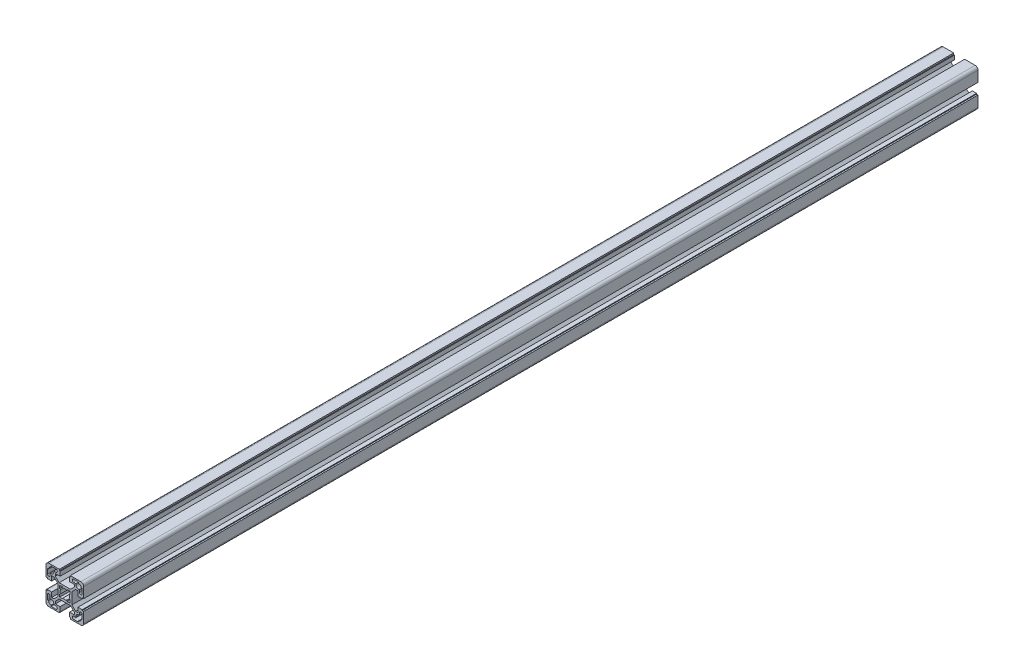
ISO-10303-21;
HEADER;
FILE_DESCRIPTION(('STEP AP214'),'2;1');
FILE_NAME('part.step','',(''),(''),'','','');
FILE_SCHEMA(('AUTOMOTIVE_DESIGN { 1 0 10303 214 1 1 1 1 }'));
ENDSEC;
DATA;
#1=APPLICATION_CONTEXT('core data for automotive mechanical design processes');
#2=APPLICATION_PROTOCOL_DEFINITION('international standard','automotive_design',2000,#1);
#3=PRODUCT_CONTEXT('',#1,'mechanical');
#4=PRODUCT('Part','Part','',(#3));
#5=PRODUCT_RELATED_PRODUCT_CATEGORY('part','',(#4));
#6=PRODUCT_DEFINITION_FORMATION('','',#4);
#7=PRODUCT_DEFINITION_CONTEXT('part definition',#1,'design');
#8=PRODUCT_DEFINITION('design','',#6,#7);
#9=PRODUCT_DEFINITION_SHAPE('','',#8);
#10=(LENGTH_UNIT() NAMED_UNIT(*) SI_UNIT(.MILLI.,.METRE.));
#11=(NAMED_UNIT(*) PLANE_ANGLE_UNIT() SI_UNIT($,.RADIAN.));
#12=(NAMED_UNIT(*) SI_UNIT($,.STERADIAN.) SOLID_ANGLE_UNIT());
#13=UNCERTAINTY_MEASURE_WITH_UNIT(LENGTH_MEASURE(1.E-05),#10,'distance_accuracy_value','');
#14=(GEOMETRIC_REPRESENTATION_CONTEXT(3) GLOBAL_UNCERTAINTY_ASSIGNED_CONTEXT((#13)) GLOBAL_UNIT_ASSIGNED_CONTEXT((#10,
#11,#12)) REPRESENTATION_CONTEXT('',''));
#15=CARTESIAN_POINT('',(0.,0.,0.));
#16=DIRECTION('',(0.,0.,1.));
#17=DIRECTION('',(1.,0.,0.));
#18=AXIS2_PLACEMENT_3D('',#15,#16,#17);
#19=CARTESIAN_POINT('',(-14.5000000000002,-11.75,950.));
#20=DIRECTION('',(0.,-1.,0.));
#21=DIRECTION('',(1.,0.,0.));
#22=AXIS2_PLACEMENT_3D('',#19,#20,#21);
#23=PLANE('',#22);
#24=DIRECTION('',(1.,0.,0.));
#25=VECTOR('',#24,1.);
#26=CARTESIAN_POINT('',(-14.5000000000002,-11.75,950.));
#27=LINE('',#26,#25);
#28=CARTESIAN_POINT('',(-14.5000000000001,-11.75,950.));
#29=VERTEX_POINT('',#28);
#30=CARTESIAN_POINT('',(-15.5000000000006,-11.75,950.));
#31=VERTEX_POINT('',#30);
#32=EDGE_CURVE('E806',#29,#31,#27,.F.);
#33=ORIENTED_EDGE('',*,*,#32,.T.);
#34=DIRECTION('',(0.,0.,1.));
#35=VECTOR('',#34,1.);
#36=CARTESIAN_POINT('',(-15.5000000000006,-11.75,950.));
#37=LINE('',#36,#35);
#38=CARTESIAN_POINT('',(-15.5000000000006,-11.75,0.));
#39=VERTEX_POINT('',#38);
#40=EDGE_CURVE('E804',#39,#31,#37,.T.);
#41=ORIENTED_EDGE('',*,*,#40,.F.);
#42=DIRECTION('',(1.,0.,0.));
#43=VECTOR('',#42,1.);
#44=CARTESIAN_POINT('',(-14.5000000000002,-11.75,0.));
#45=LINE('',#44,#43);
#46=CARTESIAN_POINT('',(-14.5000000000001,-11.75,0.));
#47=VERTEX_POINT('',#46);
#48=EDGE_CURVE('E20',#39,#47,#45,.T.);
#49=ORIENTED_EDGE('',*,*,#48,.T.);
#50=DIRECTION('',(0.,0.,-1.));
#51=VECTOR('',#50,1.);
#52=CARTESIAN_POINT('',(-14.5000000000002,-11.75,950.));
#53=LINE('',#52,#51);
#54=EDGE_CURVE('E801',#47,#29,#53,.F.);
#55=ORIENTED_EDGE('',*,*,#54,.T.);
#56=EDGE_LOOP('',(#33,#41,#49,#55));
#57=FACE_BOUND('',#56,.T.);
#58=ADVANCED_FACE('F17',(#57),#23,.T.);
#59=CARTESIAN_POINT('',(-11.7500000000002,-15.5,950.));
#60=DIRECTION('',(-1.,0.,0.));
#61=DIRECTION('',(0.,-1.,0.));
#62=AXIS2_PLACEMENT_3D('',#59,#60,#61);
#63=PLANE('',#62);
#64=DIRECTION('',(0.,-1.,0.));
#65=VECTOR('',#64,1.);
#66=CARTESIAN_POINT('',(-11.7500000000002,-15.5,950.));
#67=LINE('',#66,#65);
#68=CARTESIAN_POINT('',(-11.7500000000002,-15.5,950.));
#69=VERTEX_POINT('',#68);
#70=CARTESIAN_POINT('',(-11.7500000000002,-14.5,950.));
#71=VERTEX_POINT('',#70);
#72=EDGE_CURVE('E1218',#69,#71,#67,.F.);
#73=ORIENTED_EDGE('',*,*,#72,.T.);
#74=DIRECTION('',(0.,0.,-1.));
#75=VECTOR('',#74,1.);
#76=CARTESIAN_POINT('',(-11.7500000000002,-14.5,950.));
#77=LINE('',#76,#75);
#78=CARTESIAN_POINT('',(-11.7500000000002,-14.5,0.));
#79=VERTEX_POINT('',#78);
#80=EDGE_CURVE('E814',#71,#79,#77,.T.);
#81=ORIENTED_EDGE('',*,*,#80,.T.);
#82=DIRECTION('',(0.,-1.,0.));
#83=VECTOR('',#82,1.);
#84=CARTESIAN_POINT('',(-11.7500000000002,-15.5,0.));
#85=LINE('',#84,#83);
#86=CARTESIAN_POINT('',(-11.7500000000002,-15.5,0.));
#87=VERTEX_POINT('',#86);
#88=EDGE_CURVE('E819',#79,#87,#85,.T.);
#89=ORIENTED_EDGE('',*,*,#88,.T.);
#90=DIRECTION('',(0.,0.,-1.));
#91=VECTOR('',#90,1.);
#92=CARTESIAN_POINT('',(-11.7500000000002,-15.5,950.));
#93=LINE('',#92,#91);
#94=EDGE_CURVE('E1262',#69,#87,#93,.T.);
#95=ORIENTED_EDGE('',*,*,#94,.F.);
#96=EDGE_LOOP('',(#73,#81,#89,#95));
#97=FACE_BOUND('',#96,.T.);
#98=ADVANCED_FACE('F1555',(#97),#63,.T.);
#99=CARTESIAN_POINT('',(-14.5000000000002,-17.25,950.));
#100=DIRECTION('',(1.,0.,0.));
#101=DIRECTION('',(0.,0.,-1.));
#102=AXIS2_PLACEMENT_3D('',#99,#100,#101);
#103=PLANE('',#102);
#104=DIRECTION('',(0.,1.,0.));
#105=VECTOR('',#104,1.);
#106=CARTESIAN_POINT('',(-14.5000000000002,-17.25,950.));
#107=LINE('',#106,#105);
#108=CARTESIAN_POINT('',(-14.5000000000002,-17.25,950.));
#109=VERTEX_POINT('',#108);
#110=CARTESIAN_POINT('',(-14.5000000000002,-18.5,950.));
#111=VERTEX_POINT('',#110);
#112=EDGE_CURVE('E1214',#109,#111,#107,.F.);
#113=ORIENTED_EDGE('',*,*,#112,.T.);
#114=DIRECTION('',(0.,0.,1.));
#115=VECTOR('',#114,1.);
#116=CARTESIAN_POINT('',(-14.5000000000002,-18.5,950.));
#117=LINE('',#116,#115);
#118=CARTESIAN_POINT('',(-14.5000000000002,-18.5,0.));
#119=VERTEX_POINT('',#118);
#120=EDGE_CURVE('E1256',#119,#111,#117,.T.);
#121=ORIENTED_EDGE('',*,*,#120,.F.);
#122=DIRECTION('',(0.,1.,0.));
#123=VECTOR('',#122,1.);
#124=CARTESIAN_POINT('',(-14.5000000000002,-17.25,0.));
#125=LINE('',#124,#123);
#126=CARTESIAN_POINT('',(-14.5000000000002,-17.25,0.));
#127=VERTEX_POINT('',#126);
#128=EDGE_CURVE('E1216',#119,#127,#125,.T.);
#129=ORIENTED_EDGE('',*,*,#128,.T.);
#130=DIRECTION('',(0.,0.,-1.));
#131=VECTOR('',#130,1.);
#132=CARTESIAN_POINT('',(-14.5000000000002,-17.25,950.));
#133=LINE('',#132,#131);
#134=EDGE_CURVE('E1251',#127,#109,#133,.F.);
#135=ORIENTED_EDGE('',*,*,#134,.T.);
#136=EDGE_LOOP('',(#113,#121,#129,#135));
#137=FACE_BOUND('',#136,.T.);
#138=ADVANCED_FACE('F1560',(#137),#103,.T.);
#139=CARTESIAN_POINT('',(-18.5000000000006,-14.5000000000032,950.));
#140=DIRECTION('',(0.,1.,0.));
#141=DIRECTION('',(0.,0.,1.));
#142=AXIS2_PLACEMENT_3D('',#139,#140,#141);
#143=PLANE('',#142);
#144=DIRECTION('',(1.,0.,0.));
#145=VECTOR('',#144,1.);
#146=CARTESIAN_POINT('',(-18.5000000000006,-14.5000000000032,950.));
#147=LINE('',#146,#145);
#148=CARTESIAN_POINT('',(-18.5000000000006,-14.5000000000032,950.));
#149=VERTEX_POINT('',#148);
#150=CARTESIAN_POINT('',(-17.2500000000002,-14.5000000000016,950.));
#151=VERTEX_POINT('',#150);
#152=EDGE_CURVE('E1210',#149,#151,#147,.T.);
#153=ORIENTED_EDGE('',*,*,#152,.T.);
#154=DIRECTION('',(0.,0.,-1.));
#155=VECTOR('',#154,1.);
#156=CARTESIAN_POINT('',(-17.2500000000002,-14.5,950.));
#157=LINE('',#156,#155);
#158=CARTESIAN_POINT('',(-17.2500000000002,-14.5000000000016,0.));
#159=VERTEX_POINT('',#158);
#160=EDGE_CURVE('E1248',#151,#159,#157,.T.);
#161=ORIENTED_EDGE('',*,*,#160,.T.);
#162=DIRECTION('',(1.,0.,0.));
#163=VECTOR('',#162,1.);
#164=CARTESIAN_POINT('',(-18.5000000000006,-14.5000000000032,0.));
#165=LINE('',#164,#163);
#166=CARTESIAN_POINT('',(-18.5000000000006,-14.5000000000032,0.));
#167=VERTEX_POINT('',#166);
#168=EDGE_CURVE('E1212',#159,#167,#165,.F.);
#169=ORIENTED_EDGE('',*,*,#168,.T.);
#170=DIRECTION('',(0.,0.,-1.));
#171=VECTOR('',#170,1.);
#172=CARTESIAN_POINT('',(-18.5000000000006,-14.5000000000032,950.));
#173=LINE('',#172,#171);
#174=EDGE_CURVE('E1242',#149,#167,#173,.T.);
#175=ORIENTED_EDGE('',*,*,#174,.F.);
#176=EDGE_LOOP('',(#153,#161,#169,#175));
#177=FACE_BOUND('',#176,.T.);
#178=ADVANCED_FACE('F1569',(#177),#143,.T.);
#179=CARTESIAN_POINT('',(18.5000000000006,-14.5000000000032,950.));
#180=DIRECTION('',(0.,1.,0.));
#181=DIRECTION('',(0.,0.,1.));
#182=AXIS2_PLACEMENT_3D('',#179,#180,#181);
#183=PLANE('',#182);
#184=DIRECTION('',(1.,0.,0.));
#185=VECTOR('',#184,1.);
#186=CARTESIAN_POINT('',(18.5000000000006,-14.5000000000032,950.));
#187=LINE('',#186,#185);
#188=CARTESIAN_POINT('',(17.2500000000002,-14.5000000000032,950.));
#189=VERTEX_POINT('',#188);
#190=CARTESIAN_POINT('',(18.5000000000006,-14.5000000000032,950.));
#191=VERTEX_POINT('',#190);
#192=EDGE_CURVE('E1206',#189,#191,#187,.T.);
#193=ORIENTED_EDGE('',*,*,#192,.T.);
#194=DIRECTION('',(0.,0.,1.));
#195=VECTOR('',#194,1.);
#196=CARTESIAN_POINT('',(18.5000000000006,-14.5000000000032,950.));
#197=LINE('',#196,#195);
#198=CARTESIAN_POINT('',(18.5000000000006,-14.5000000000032,0.));
#199=VERTEX_POINT('',#198);
#200=EDGE_CURVE('E1947',#199,#191,#197,.T.);
#201=ORIENTED_EDGE('',*,*,#200,.F.);
#202=DIRECTION('',(1.,0.,0.));
#203=VECTOR('',#202,1.);
#204=CARTESIAN_POINT('',(18.5000000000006,-14.5000000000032,0.));
#205=LINE('',#204,#203);
#206=CARTESIAN_POINT('',(17.2500000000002,-14.5000000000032,0.));
#207=VERTEX_POINT('',#206);
#208=EDGE_CURVE('E1208',#199,#207,#205,.F.);
#209=ORIENTED_EDGE('',*,*,#208,.T.);
#210=DIRECTION('',(0.,0.,-1.));
#211=VECTOR('',#210,1.);
#212=CARTESIAN_POINT('',(17.2500000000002,-14.5000000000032,950.));
#213=LINE('',#212,#211);
#214=EDGE_CURVE('E1952',#207,#189,#213,.F.);
#215=ORIENTED_EDGE('',*,*,#214,.T.);
#216=EDGE_LOOP('',(#193,#201,#209,#215));
#217=FACE_BOUND('',#216,.T.);
#218=ADVANCED_FACE('F2472',(#217),#183,.T.);
#219=CARTESIAN_POINT('',(14.5000000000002,-17.25,950.));
#220=DIRECTION('',(-1.,0.,0.));
#221=DIRECTION('',(0.,0.,1.));
#222=AXIS2_PLACEMENT_3D('',#219,#220,#221);
#223=PLANE('',#222);
#224=DIRECTION('',(0.,1.,0.));
#225=VECTOR('',#224,1.);
#226=CARTESIAN_POINT('',(14.5000000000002,-17.25,950.));
#227=LINE('',#226,#225);
#228=CARTESIAN_POINT('',(14.5000000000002,-18.5,950.));
#229=VERTEX_POINT('',#228);
#230=CARTESIAN_POINT('',(14.5000000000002,-17.25,950.));
#231=VERTEX_POINT('',#230);
#232=EDGE_CURVE('E1202',#229,#231,#227,.T.);
#233=ORIENTED_EDGE('',*,*,#232,.T.);
#234=DIRECTION('',(0.,0.,-1.));
#235=VECTOR('',#234,1.);
#236=CARTESIAN_POINT('',(14.5000000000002,-17.25,950.));
#237=LINE('',#236,#235);
#238=CARTESIAN_POINT('',(14.5000000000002,-17.25,0.));
#239=VERTEX_POINT('',#238);
#240=EDGE_CURVE('E1955',#231,#239,#237,.T.);
#241=ORIENTED_EDGE('',*,*,#240,.T.);
#242=DIRECTION('',(0.,1.,0.));
#243=VECTOR('',#242,1.);
#244=CARTESIAN_POINT('',(14.5000000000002,-17.25,0.));
#245=LINE('',#244,#243);
#246=CARTESIAN_POINT('',(14.5000000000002,-18.5,0.));
#247=VERTEX_POINT('',#246);
#248=EDGE_CURVE('E1204',#239,#247,#245,.F.);
#249=ORIENTED_EDGE('',*,*,#248,.T.);
#250=DIRECTION('',(0.,0.,1.));
#251=VECTOR('',#250,1.);
#252=CARTESIAN_POINT('',(14.5000000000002,-18.5,950.));
#253=LINE('',#252,#251);
#254=EDGE_CURVE('E1958',#229,#247,#253,.F.);
#255=ORIENTED_EDGE('',*,*,#254,.F.);
#256=EDGE_LOOP('',(#233,#241,#249,#255));
#257=FACE_BOUND('',#256,.T.);
#258=ADVANCED_FACE('F2468',(#257),#223,.T.);
#259=CARTESIAN_POINT('',(11.7500000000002,-15.5,950.));
#260=DIRECTION('',(1.,0.,0.));
#261=DIRECTION('',(0.,1.,0.));
#262=AXIS2_PLACEMENT_3D('',#259,#260,#261);
#263=PLANE('',#262);
#264=DIRECTION('',(0.,1.,0.));
#265=VECTOR('',#264,1.);
#266=CARTESIAN_POINT('',(11.7500000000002,-15.5,950.));
#267=LINE('',#266,#265);
#268=CARTESIAN_POINT('',(11.7500000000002,-14.5,950.));
#269=VERTEX_POINT('',#268);
#270=CARTESIAN_POINT('',(11.7500000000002,-15.5,950.));
#271=VERTEX_POINT('',#270);
#272=EDGE_CURVE('E1198',#269,#271,#267,.F.);
#273=ORIENTED_EDGE('',*,*,#272,.T.);
#274=DIRECTION('',(0.,0.,-1.));
#275=VECTOR('',#274,1.);
#276=CARTESIAN_POINT('',(11.7500000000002,-15.5,950.));
#277=LINE('',#276,#275);
#278=CARTESIAN_POINT('',(11.7500000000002,-15.5,0.));
#279=VERTEX_POINT('',#278);
#280=EDGE_CURVE('E1964',#279,#271,#277,.F.);
#281=ORIENTED_EDGE('',*,*,#280,.F.);
#282=DIRECTION('',(0.,1.,0.));
#283=VECTOR('',#282,1.);
#284=CARTESIAN_POINT('',(11.7500000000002,-15.5,0.));
#285=LINE('',#284,#283);
#286=CARTESIAN_POINT('',(11.7500000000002,-14.5,0.));
#287=VERTEX_POINT('',#286);
#288=EDGE_CURVE('E1200',#279,#287,#285,.T.);
#289=ORIENTED_EDGE('',*,*,#288,.T.);
#290=DIRECTION('',(0.,0.,-1.));
#291=VECTOR('',#290,1.);
#292=CARTESIAN_POINT('',(11.7500000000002,-14.5,950.));
#293=LINE('',#292,#291);
#294=EDGE_CURVE('E1969',#287,#269,#293,.F.);
#295=ORIENTED_EDGE('',*,*,#294,.T.);
#296=EDGE_LOOP('',(#273,#281,#289,#295));
#297=FACE_BOUND('',#296,.T.);
#298=ADVANCED_FACE('F2465',(#297),#263,.T.);
#299=CARTESIAN_POINT('',(14.5000000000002,-11.75,950.));
#300=DIRECTION('',(0.,-1.,0.));
#301=DIRECTION('',(1.,0.,0.));
#302=AXIS2_PLACEMENT_3D('',#299,#300,#301);
#303=PLANE('',#302);
#304=DIRECTION('',(1.,0.,0.));
#305=VECTOR('',#304,1.);
#306=CARTESIAN_POINT('',(14.5000000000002,-11.75,950.));
#307=LINE('',#306,#305);
#308=CARTESIAN_POINT('',(15.5000000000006,-11.75,950.));
#309=VERTEX_POINT('',#308);
#310=CARTESIAN_POINT('',(14.5000000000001,-11.75,950.));
#311=VERTEX_POINT('',#310);
#312=EDGE_CURVE('E1194',#309,#311,#307,.F.);
#313=ORIENTED_EDGE('',*,*,#312,.T.);
#314=DIRECTION('',(0.,0.,-1.));
#315=VECTOR('',#314,1.);
#316=CARTESIAN_POINT('',(14.5000000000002,-11.75,950.));
#317=LINE('',#316,#315);
#318=CARTESIAN_POINT('',(14.5000000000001,-11.75,0.));
#319=VERTEX_POINT('',#318);
#320=EDGE_CURVE('E1940',#311,#319,#317,.T.);
#321=ORIENTED_EDGE('',*,*,#320,.T.);
#322=DIRECTION('',(1.,0.,0.));
#323=VECTOR('',#322,1.);
#324=CARTESIAN_POINT('',(14.5000000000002,-11.75,0.));
#325=LINE('',#324,#323);
#326=CARTESIAN_POINT('',(15.5000000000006,-11.75,0.));
#327=VERTEX_POINT('',#326);
#328=EDGE_CURVE('E1196',#319,#327,#325,.T.);
#329=ORIENTED_EDGE('',*,*,#328,.T.);
#330=DIRECTION('',(0.,0.,-1.));
#331=VECTOR('',#330,1.);
#332=CARTESIAN_POINT('',(15.5000000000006,-11.75,950.));
#333=LINE('',#332,#331);
#334=EDGE_CURVE('E1237',#309,#327,#333,.T.);
#335=ORIENTED_EDGE('',*,*,#334,.F.);
#336=EDGE_LOOP('',(#313,#321,#329,#335));
#337=FACE_BOUND('',#336,.T.);
#338=ADVANCED_FACE('F1939',(#337),#303,.T.);
#339=CARTESIAN_POINT('',(5.80000000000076,-18.5000000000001,950.));
#340=DIRECTION('',(1.,0.,0.));
#341=DIRECTION('',(0.,0.,-1.));
#342=AXIS2_PLACEMENT_3D('',#339,#340,#341);
#343=PLANE('',#342);
#344=DIRECTION('',(0.,0.,1.));
#345=VECTOR('',#344,1.);
#346=CARTESIAN_POINT('',(5.80000000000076,-20.,950.));
#347=LINE('',#346,#345);
#348=CARTESIAN_POINT('',(5.80000000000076,-20.,0.));
#349=VERTEX_POINT('',#348);
#350=CARTESIAN_POINT('',(5.80000000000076,-20.,950.));
#351=VERTEX_POINT('',#350);
#352=EDGE_CURVE('E1973',#349,#351,#347,.T.);
#353=ORIENTED_EDGE('',*,*,#352,.T.);
#354=DIRECTION('',(0.,1.,0.));
#355=VECTOR('',#354,1.);
#356=CARTESIAN_POINT('',(5.80000000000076,-17.,950.));
#357=LINE('',#356,#355);
#358=CARTESIAN_POINT('',(5.80000000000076,-18.5000000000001,950.));
#359=VERTEX_POINT('',#358);
#360=EDGE_CURVE('E1192',#359,#351,#357,.F.);
#361=ORIENTED_EDGE('',*,*,#360,.F.);
#362=DIRECTION('',(0.,0.,1.));
#363=VECTOR('',#362,1.);
#364=CARTESIAN_POINT('',(5.80000000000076,-18.5000000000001,950.));
#365=LINE('',#364,#363);
#366=CARTESIAN_POINT('',(5.80000000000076,-18.5000000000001,0.));
#367=VERTEX_POINT('',#366);
#368=EDGE_CURVE('E1116',#359,#367,#365,.F.);
#369=ORIENTED_EDGE('',*,*,#368,.T.);
#370=DIRECTION('',(0.,1.,0.));
#371=VECTOR('',#370,1.);
#372=CARTESIAN_POINT('',(5.80000000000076,-17.,0.));
#373=LINE('',#372,#371);
#374=EDGE_CURVE('E1190',#349,#367,#373,.T.);
#375=ORIENTED_EDGE('',*,*,#374,.F.);
#376=EDGE_LOOP('',(#353,#361,#369,#375));
#377=FACE_BOUND('',#376,.T.);
#378=ADVANCED_FACE('F2286',(#377),#343,.F.);
#379=CARTESIAN_POINT('',(20.,-5.79999999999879,950.));
#380=DIRECTION('',(0.,-1.,0.));
#381=DIRECTION('',(0.,0.,-1.));
#382=AXIS2_PLACEMENT_3D('',#379,#380,#381);
#383=PLANE('',#382);
#384=DIRECTION('',(0.,0.,1.));
#385=VECTOR('',#384,1.);
#386=CARTESIAN_POINT('',(18.5,-5.79999999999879,950.));
#387=LINE('',#386,#385);
#388=CARTESIAN_POINT('',(18.5,-5.79999999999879,0.));
#389=VERTEX_POINT('',#388);
#390=CARTESIAN_POINT('',(18.5,-5.79999999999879,950.));
#391=VERTEX_POINT('',#390);
#392=EDGE_CURVE('E1185',#389,#391,#387,.T.);
#393=ORIENTED_EDGE('',*,*,#392,.T.);
#394=DIRECTION('',(1.,0.,0.));
#395=VECTOR('',#394,1.);
#396=CARTESIAN_POINT('',(17.,-5.79999999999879,950.));
#397=LINE('',#396,#395);
#398=CARTESIAN_POINT('',(20.,-5.79999999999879,950.));
#399=VERTEX_POINT('',#398);
#400=EDGE_CURVE('E1188',#399,#391,#397,.F.);
#401=ORIENTED_EDGE('',*,*,#400,.F.);
#402=DIRECTION('',(0.,0.,1.));
#403=VECTOR('',#402,1.);
#404=CARTESIAN_POINT('',(20.,-5.79999999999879,950.));
#405=LINE('',#404,#403);
#406=CARTESIAN_POINT('',(20.,-5.79999999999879,0.));
#407=VERTEX_POINT('',#406);
#408=EDGE_CURVE('E1981',#399,#407,#405,.F.);
#409=ORIENTED_EDGE('',*,*,#408,.T.);
#410=DIRECTION('',(1.,0.,0.));
#411=VECTOR('',#410,1.);
#412=CARTESIAN_POINT('',(17.,-5.79999999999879,0.));
#413=LINE('',#412,#411);
#414=EDGE_CURVE('E1186',#389,#407,#413,.T.);
#415=ORIENTED_EDGE('',*,*,#414,.F.);
#416=EDGE_LOOP('',(#393,#401,#409,#415));
#417=FACE_BOUND('',#416,.T.);
#418=ADVANCED_FACE('F2294',(#417),#383,.F.);
#419=CARTESIAN_POINT('',(18.5,-5.79999999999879,950.));
#420=DIRECTION('',(-1.,0.,0.));
#421=DIRECTION('',(0.,0.,1.));
#422=AXIS2_PLACEMENT_3D('',#419,#420,#421);
#423=PLANE('',#422);
#424=DIRECTION('',(0.,0.,-1.));
#425=VECTOR('',#424,1.);
#426=CARTESIAN_POINT('',(18.5,-4.99999999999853,950.));
#427=LINE('',#426,#425);
#428=CARTESIAN_POINT('',(18.5,-4.99999999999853,0.));
#429=VERTEX_POINT('',#428);
#430=CARTESIAN_POINT('',(18.5,-4.99999999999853,950.));
#431=VERTEX_POINT('',#430);
#432=EDGE_CURVE('E1984',#429,#431,#427,.F.);
#433=ORIENTED_EDGE('',*,*,#432,.T.);
#434=DIRECTION('',(0.,1.,0.));
#435=VECTOR('',#434,1.);
#436=CARTESIAN_POINT('',(18.5,-17.,950.));
#437=LINE('',#436,#435);
#438=EDGE_CURVE('E1183',#391,#431,#437,.T.);
#439=ORIENTED_EDGE('',*,*,#438,.F.);
#440=ORIENTED_EDGE('',*,*,#392,.F.);
#441=DIRECTION('',(0.,1.,0.));
#442=VECTOR('',#441,1.);
#443=CARTESIAN_POINT('',(18.5,-17.,0.));
#444=LINE('',#443,#442);
#445=EDGE_CURVE('E1180',#429,#389,#444,.F.);
#446=ORIENTED_EDGE('',*,*,#445,.F.);
#447=EDGE_LOOP('',(#433,#439,#440,#446));
#448=FACE_BOUND('',#447,.T.);
#449=ADVANCED_FACE('F2297',(#448),#423,.F.);
#450=CARTESIAN_POINT('',(18.5,5.79999999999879,950.));
#451=DIRECTION('',(-1.,0.,0.));
#452=DIRECTION('',(0.,0.,1.));
#453=AXIS2_PLACEMENT_3D('',#450,#451,#452);
#454=PLANE('',#453);
#455=DIRECTION('',(0.,0.,1.));
#456=VECTOR('',#455,1.);
#457=CARTESIAN_POINT('',(18.5,5.79999999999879,950.));
#458=LINE('',#457,#456);
#459=CARTESIAN_POINT('',(18.5,5.79999999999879,0.));
#460=VERTEX_POINT('',#459);
#461=CARTESIAN_POINT('',(18.5,5.79999999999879,950.));
#462=VERTEX_POINT('',#461);
#463=EDGE_CURVE('E1175',#460,#462,#458,.T.);
#464=ORIENTED_EDGE('',*,*,#463,.T.);
#465=DIRECTION('',(0.,1.,0.));
#466=VECTOR('',#465,1.);
#467=CARTESIAN_POINT('',(18.5,-17.,950.));
#468=LINE('',#467,#466);
#469=CARTESIAN_POINT('',(18.5,4.99999999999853,950.));
#470=VERTEX_POINT('',#469);
#471=EDGE_CURVE('E1178',#470,#462,#468,.T.);
#472=ORIENTED_EDGE('',*,*,#471,.F.);
#473=DIRECTION('',(0.,0.,1.));
#474=VECTOR('',#473,1.);
#475=CARTESIAN_POINT('',(18.5,4.99999999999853,950.));
#476=LINE('',#475,#474);
#477=CARTESIAN_POINT('',(18.5,4.99999999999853,0.));
#478=VERTEX_POINT('',#477);
#479=EDGE_CURVE('E2011',#470,#478,#476,.F.);
#480=ORIENTED_EDGE('',*,*,#479,.T.);
#481=DIRECTION('',(0.,1.,0.));
#482=VECTOR('',#481,1.);
#483=CARTESIAN_POINT('',(18.5,-17.,0.));
#484=LINE('',#483,#482);
#485=EDGE_CURVE('E1176',#460,#478,#484,.F.);
#486=ORIENTED_EDGE('',*,*,#485,.F.);
#487=EDGE_LOOP('',(#464,#472,#480,#486));
#488=FACE_BOUND('',#487,.T.);
#489=ADVANCED_FACE('F2319',(#488),#454,.F.);
#490=CARTESIAN_POINT('',(20.,5.79999999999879,950.));
#491=DIRECTION('',(0.,1.,0.));
#492=DIRECTION('',(0.,0.,1.));
#493=AXIS2_PLACEMENT_3D('',#490,#491,#492);
#494=PLANE('',#493);
#495=DIRECTION('',(0.,0.,1.));
#496=VECTOR('',#495,1.);
#497=CARTESIAN_POINT('',(20.,5.79999999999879,950.));
#498=LINE('',#497,#496);
#499=CARTESIAN_POINT('',(20.,5.79999999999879,0.));
#500=VERTEX_POINT('',#499);
#501=CARTESIAN_POINT('',(20.,5.79999999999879,950.));
#502=VERTEX_POINT('',#501);
#503=EDGE_CURVE('E2014',#500,#502,#498,.T.);
#504=ORIENTED_EDGE('',*,*,#503,.T.);
#505=DIRECTION('',(1.,0.,0.));
#506=VECTOR('',#505,1.);
#507=CARTESIAN_POINT('',(17.,5.79999999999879,950.));
#508=LINE('',#507,#506);
#509=EDGE_CURVE('E1173',#462,#502,#508,.T.);
#510=ORIENTED_EDGE('',*,*,#509,.F.);
#511=ORIENTED_EDGE('',*,*,#463,.F.);
#512=DIRECTION('',(1.,0.,0.));
#513=VECTOR('',#512,1.);
#514=CARTESIAN_POINT('',(17.,5.79999999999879,0.));
#515=LINE('',#514,#513);
#516=EDGE_CURVE('E1170',#500,#460,#515,.F.);
#517=ORIENTED_EDGE('',*,*,#516,.F.);
#518=EDGE_LOOP('',(#504,#510,#511,#517));
#519=FACE_BOUND('',#518,.T.);
#520=ADVANCED_FACE('F2323',(#519),#494,.F.);
#521=CARTESIAN_POINT('',(5.80000000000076,18.5000000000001,950.));
#522=DIRECTION('',(1.,0.,0.));
#523=DIRECTION('',(0.,0.,-1.));
#524=AXIS2_PLACEMENT_3D('',#521,#522,#523);
#525=PLANE('',#524);
#526=DIRECTION('',(0.,0.,-1.));
#527=VECTOR('',#526,1.);
#528=CARTESIAN_POINT('',(5.80000000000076,18.5000000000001,950.));
#529=LINE('',#528,#527);
#530=CARTESIAN_POINT('',(5.80000000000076,18.5000000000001,0.));
#531=VERTEX_POINT('',#530);
#532=CARTESIAN_POINT('',(5.80000000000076,18.5000000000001,950.));
#533=VERTEX_POINT('',#532);
#534=EDGE_CURVE('E1165',#531,#533,#529,.F.);
#535=ORIENTED_EDGE('',*,*,#534,.T.);
#536=DIRECTION('',(0.,1.,0.));
#537=VECTOR('',#536,1.);
#538=CARTESIAN_POINT('',(5.80000000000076,-17.,950.));
#539=LINE('',#538,#537);
#540=CARTESIAN_POINT('',(5.80000000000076,20.,950.));
#541=VERTEX_POINT('',#540);
#542=EDGE_CURVE('E1168',#541,#533,#539,.F.);
#543=ORIENTED_EDGE('',*,*,#542,.F.);
#544=DIRECTION('',(0.,0.,-1.));
#545=VECTOR('',#544,1.);
#546=CARTESIAN_POINT('',(5.80000000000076,20.,950.));
#547=LINE('',#546,#545);
#548=CARTESIAN_POINT('',(5.80000000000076,20.,0.));
#549=VERTEX_POINT('',#548);
#550=EDGE_CURVE('E2022',#541,#549,#547,.T.);
#551=ORIENTED_EDGE('',*,*,#550,.T.);
#552=DIRECTION('',(0.,1.,0.));
#553=VECTOR('',#552,1.);
#554=CARTESIAN_POINT('',(5.80000000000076,-17.,0.));
#555=LINE('',#554,#553);
#556=EDGE_CURVE('E1166',#531,#549,#555,.T.);
#557=ORIENTED_EDGE('',*,*,#556,.F.);
#558=EDGE_LOOP('',(#535,#543,#551,#557));
#559=FACE_BOUND('',#558,.T.);
#560=ADVANCED_FACE('F2334',(#559),#525,.F.);
#561=CARTESIAN_POINT('',(5.00000000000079,18.5000000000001,950.));
#562=DIRECTION('',(0.,-1.,0.));
#563=DIRECTION('',(0.,0.,-1.));
#564=AXIS2_PLACEMENT_3D('',#561,#562,#563);
#565=PLANE('',#564);
#566=DIRECTION('',(0.,0.,1.));
#567=VECTOR('',#566,1.);
#568=CARTESIAN_POINT('',(5.00000000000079,18.5000000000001,950.));
#569=LINE('',#568,#567);
#570=CARTESIAN_POINT('',(5.00000000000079,18.5000000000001,0.));
#571=VERTEX_POINT('',#570);
#572=CARTESIAN_POINT('',(5.00000000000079,18.5000000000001,950.));
#573=VERTEX_POINT('',#572);
#574=EDGE_CURVE('E2025',#571,#573,#569,.T.);
#575=ORIENTED_EDGE('',*,*,#574,.T.);
#576=DIRECTION('',(1.,0.,0.));
#577=VECTOR('',#576,1.);
#578=CARTESIAN_POINT('',(17.,18.5000000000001,950.));
#579=LINE('',#578,#577);
#580=EDGE_CURVE('E1163',#533,#573,#579,.F.);
#581=ORIENTED_EDGE('',*,*,#580,.F.);
#582=ORIENTED_EDGE('',*,*,#534,.F.);
#583=DIRECTION('',(1.,0.,0.));
#584=VECTOR('',#583,1.);
#585=CARTESIAN_POINT('',(17.,18.5000000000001,0.));
#586=LINE('',#585,#584);
#587=EDGE_CURVE('E1160',#571,#531,#586,.T.);
#588=ORIENTED_EDGE('',*,*,#587,.F.);
#589=EDGE_LOOP('',(#575,#581,#582,#588));
#590=FACE_BOUND('',#589,.T.);
#591=ADVANCED_FACE('F2338',(#590),#565,.F.);
#592=CARTESIAN_POINT('',(-5.00000000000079,18.5000000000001,950.));
#593=DIRECTION('',(0.,-1.,0.));
#594=DIRECTION('',(0.,0.,-1.));
#595=AXIS2_PLACEMENT_3D('',#592,#593,#594);
#596=PLANE('',#595);
#597=DIRECTION('',(0.,0.,1.));
#598=VECTOR('',#597,1.);
#599=CARTESIAN_POINT('',(-5.80000000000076,18.5000000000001,950.));
#600=LINE('',#599,#598);
#601=CARTESIAN_POINT('',(-5.80000000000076,18.5000000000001,0.));
#602=VERTEX_POINT('',#601);
#603=CARTESIAN_POINT('',(-5.80000000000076,18.5000000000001,950.));
#604=VERTEX_POINT('',#603);
#605=EDGE_CURVE('E1155',#602,#604,#600,.T.);
#606=ORIENTED_EDGE('',*,*,#605,.T.);
#607=DIRECTION('',(1.,0.,0.));
#608=VECTOR('',#607,1.);
#609=CARTESIAN_POINT('',(17.,18.5000000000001,950.));
#610=LINE('',#609,#608);
#611=CARTESIAN_POINT('',(-5.00000000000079,18.5000000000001,950.));
#612=VERTEX_POINT('',#611);
#613=EDGE_CURVE('E1158',#612,#604,#610,.F.);
#614=ORIENTED_EDGE('',*,*,#613,.F.);
#615=DIRECTION('',(0.,0.,1.));
#616=VECTOR('',#615,1.);
#617=CARTESIAN_POINT('',(-5.00000000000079,18.5000000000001,950.));
#618=LINE('',#617,#616);
#619=CARTESIAN_POINT('',(-5.00000000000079,18.5000000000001,0.));
#620=VERTEX_POINT('',#619);
#621=EDGE_CURVE('E2052',#612,#620,#618,.F.);
#622=ORIENTED_EDGE('',*,*,#621,.T.);
#623=DIRECTION('',(1.,0.,0.));
#624=VECTOR('',#623,1.);
#625=CARTESIAN_POINT('',(17.,18.5000000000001,0.));
#626=LINE('',#625,#624);
#627=EDGE_CURVE('E1156',#602,#620,#626,.T.);
#628=ORIENTED_EDGE('',*,*,#627,.F.);
#629=EDGE_LOOP('',(#606,#614,#622,#628));
#630=FACE_BOUND('',#629,.T.);
#631=ADVANCED_FACE('F2360',(#630),#596,.F.);
#632=CARTESIAN_POINT('',(-5.80000000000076,18.5000000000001,950.));
#633=DIRECTION('',(-1.,0.,0.));
#634=DIRECTION('',(0.,0.,1.));
#635=AXIS2_PLACEMENT_3D('',#632,#633,#634);
#636=PLANE('',#635);
#637=DIRECTION('',(0.,0.,1.));
#638=VECTOR('',#637,1.);
#639=CARTESIAN_POINT('',(-5.80000000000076,20.,950.));
#640=LINE('',#639,#638);
#641=CARTESIAN_POINT('',(-5.80000000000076,20.,0.));
#642=VERTEX_POINT('',#641);
#643=CARTESIAN_POINT('',(-5.80000000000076,20.,950.));
#644=VERTEX_POINT('',#643);
#645=EDGE_CURVE('E2055',#642,#644,#640,.T.);
#646=ORIENTED_EDGE('',*,*,#645,.T.);
#647=DIRECTION('',(0.,1.,0.));
#648=VECTOR('',#647,1.);
#649=CARTESIAN_POINT('',(-5.80000000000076,-17.,950.));
#650=LINE('',#649,#648);
#651=EDGE_CURVE('E1153',#604,#644,#650,.T.);
#652=ORIENTED_EDGE('',*,*,#651,.F.);
#653=ORIENTED_EDGE('',*,*,#605,.F.);
#654=DIRECTION('',(0.,1.,0.));
#655=VECTOR('',#654,1.);
#656=CARTESIAN_POINT('',(-5.80000000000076,-17.,0.));
#657=LINE('',#656,#655);
#658=EDGE_CURVE('E1150',#642,#602,#657,.F.);
#659=ORIENTED_EDGE('',*,*,#658,.F.);
#660=EDGE_LOOP('',(#646,#652,#653,#659));
#661=FACE_BOUND('',#660,.T.);
#662=ADVANCED_FACE('F2364',(#661),#636,.F.);
#663=CARTESIAN_POINT('',(-20.,5.79999999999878,950.));
#664=DIRECTION('',(0.,1.,0.));
#665=DIRECTION('',(0.,0.,1.));
#666=AXIS2_PLACEMENT_3D('',#663,#664,#665);
#667=PLANE('',#666);
#668=DIRECTION('',(0.,0.,-1.));
#669=VECTOR('',#668,1.);
#670=CARTESIAN_POINT('',(-18.5,5.79999999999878,950.));
#671=LINE('',#670,#669);
#672=CARTESIAN_POINT('',(-18.5,5.79999999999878,0.));
#673=VERTEX_POINT('',#672);
#674=CARTESIAN_POINT('',(-18.5,5.79999999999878,950.));
#675=VERTEX_POINT('',#674);
#676=EDGE_CURVE('E1145',#673,#675,#671,.F.);
#677=ORIENTED_EDGE('',*,*,#676,.T.);
#678=DIRECTION('',(1.,0.,0.));
#679=VECTOR('',#678,1.);
#680=CARTESIAN_POINT('',(17.,5.79999999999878,950.));
#681=LINE('',#680,#679);
#682=CARTESIAN_POINT('',(-20.,5.79999999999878,950.));
#683=VERTEX_POINT('',#682);
#684=EDGE_CURVE('E1148',#683,#675,#681,.T.);
#685=ORIENTED_EDGE('',*,*,#684,.F.);
#686=DIRECTION('',(0.,0.,1.));
#687=VECTOR('',#686,1.);
#688=CARTESIAN_POINT('',(-20.,5.79999999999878,950.));
#689=LINE('',#688,#687);
#690=CARTESIAN_POINT('',(-20.,5.79999999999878,0.));
#691=VERTEX_POINT('',#690);
#692=EDGE_CURVE('E2063',#683,#691,#689,.F.);
#693=ORIENTED_EDGE('',*,*,#692,.T.);
#694=DIRECTION('',(1.,0.,0.));
#695=VECTOR('',#694,1.);
#696=CARTESIAN_POINT('',(17.,5.79999999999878,0.));
#697=LINE('',#696,#695);
#698=EDGE_CURVE('E1146',#673,#691,#697,.F.);
#699=ORIENTED_EDGE('',*,*,#698,.F.);
#700=EDGE_LOOP('',(#677,#685,#693,#699));
#701=FACE_BOUND('',#700,.T.);
#702=ADVANCED_FACE('F2375',(#701),#667,.F.);
#703=CARTESIAN_POINT('',(-18.5,5.79999999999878,950.));
#704=DIRECTION('',(1.,0.,0.));
#705=DIRECTION('',(0.,0.,-1.));
#706=AXIS2_PLACEMENT_3D('',#703,#704,#705);
#707=PLANE('',#706);
#708=DIRECTION('',(0.,0.,1.));
#709=VECTOR('',#708,1.);
#710=CARTESIAN_POINT('',(-18.5,4.99999999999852,950.));
#711=LINE('',#710,#709);
#712=CARTESIAN_POINT('',(-18.5,4.99999999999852,0.));
#713=VERTEX_POINT('',#712);
#714=CARTESIAN_POINT('',(-18.5,4.99999999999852,950.));
#715=VERTEX_POINT('',#714);
#716=EDGE_CURVE('E2066',#713,#715,#711,.T.);
#717=ORIENTED_EDGE('',*,*,#716,.T.);
#718=DIRECTION('',(0.,1.,0.));
#719=VECTOR('',#718,1.);
#720=CARTESIAN_POINT('',(-18.5,-17.,950.));
#721=LINE('',#720,#719);
#722=EDGE_CURVE('E1143',#675,#715,#721,.F.);
#723=ORIENTED_EDGE('',*,*,#722,.F.);
#724=ORIENTED_EDGE('',*,*,#676,.F.);
#725=DIRECTION('',(0.,1.,0.));
#726=VECTOR('',#725,1.);
#727=CARTESIAN_POINT('',(-18.5,-17.,0.));
#728=LINE('',#727,#726);
#729=EDGE_CURVE('E1140',#713,#673,#728,.T.);
#730=ORIENTED_EDGE('',*,*,#729,.F.);
#731=EDGE_LOOP('',(#717,#723,#724,#730));
#732=FACE_BOUND('',#731,.T.);
#733=ADVANCED_FACE('F2379',(#732),#707,.F.);
#734=CARTESIAN_POINT('',(-18.5,-5.79999999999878,950.));
#735=DIRECTION('',(1.,0.,0.));
#736=DIRECTION('',(0.,0.,-1.));
#737=AXIS2_PLACEMENT_3D('',#734,#735,#736);
#738=PLANE('',#737);
#739=DIRECTION('',(0.,0.,-1.));
#740=VECTOR('',#739,1.);
#741=CARTESIAN_POINT('',(-18.5,-5.79999999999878,950.));
#742=LINE('',#741,#740);
#743=CARTESIAN_POINT('',(-18.5,-5.79999999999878,0.));
#744=VERTEX_POINT('',#743);
#745=CARTESIAN_POINT('',(-18.5,-5.79999999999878,950.));
#746=VERTEX_POINT('',#745);
#747=EDGE_CURVE('E1135',#744,#746,#742,.F.);
#748=ORIENTED_EDGE('',*,*,#747,.T.);
#749=DIRECTION('',(0.,1.,0.));
#750=VECTOR('',#749,1.);
#751=CARTESIAN_POINT('',(-18.5,-17.,950.));
#752=LINE('',#751,#750);
#753=CARTESIAN_POINT('',(-18.5,-4.99999999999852,950.));
#754=VERTEX_POINT('',#753);
#755=EDGE_CURVE('E1138',#754,#746,#752,.F.);
#756=ORIENTED_EDGE('',*,*,#755,.F.);
#757=DIRECTION('',(0.,0.,1.));
#758=VECTOR('',#757,1.);
#759=CARTESIAN_POINT('',(-18.5,-4.99999999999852,950.));
#760=LINE('',#759,#758);
#761=CARTESIAN_POINT('',(-18.5,-4.99999999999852,0.));
#762=VERTEX_POINT('',#761);
#763=EDGE_CURVE('E2093',#754,#762,#760,.F.);
#764=ORIENTED_EDGE('',*,*,#763,.T.);
#765=DIRECTION('',(0.,1.,0.));
#766=VECTOR('',#765,1.);
#767=CARTESIAN_POINT('',(-18.5,-17.,0.));
#768=LINE('',#767,#766);
#769=EDGE_CURVE('E1136',#744,#762,#768,.T.);
#770=ORIENTED_EDGE('',*,*,#769,.F.);
#771=EDGE_LOOP('',(#748,#756,#764,#770));
#772=FACE_BOUND('',#771,.T.);
#773=ADVANCED_FACE('F2401',(#772),#738,.F.);
#774=CARTESIAN_POINT('',(-20.,-5.79999999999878,950.));
#775=DIRECTION('',(0.,-1.,0.));
#776=DIRECTION('',(0.,0.,-1.));
#777=AXIS2_PLACEMENT_3D('',#774,#775,#776);
#778=PLANE('',#777);
#779=DIRECTION('',(0.,0.,1.));
#780=VECTOR('',#779,1.);
#781=CARTESIAN_POINT('',(-20.,-5.79999999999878,950.));
#782=LINE('',#781,#780);
#783=CARTESIAN_POINT('',(-20.,-5.79999999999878,0.));
#784=VERTEX_POINT('',#783);
#785=CARTESIAN_POINT('',(-20.,-5.79999999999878,950.));
#786=VERTEX_POINT('',#785);
#787=EDGE_CURVE('E2096',#784,#786,#782,.T.);
#788=ORIENTED_EDGE('',*,*,#787,.T.);
#789=DIRECTION('',(1.,0.,0.));
#790=VECTOR('',#789,1.);
#791=CARTESIAN_POINT('',(17.,-5.79999999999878,950.));
#792=LINE('',#791,#790);
#793=EDGE_CURVE('E1133',#746,#786,#792,.F.);
#794=ORIENTED_EDGE('',*,*,#793,.F.);
#795=ORIENTED_EDGE('',*,*,#747,.F.);
#796=DIRECTION('',(1.,0.,0.));
#797=VECTOR('',#796,1.);
#798=CARTESIAN_POINT('',(17.,-5.79999999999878,0.));
#799=LINE('',#798,#797);
#800=EDGE_CURVE('E1130',#784,#744,#799,.T.);
#801=ORIENTED_EDGE('',*,*,#800,.F.);
#802=EDGE_LOOP('',(#788,#794,#795,#801));
#803=FACE_BOUND('',#802,.T.);
#804=ADVANCED_FACE('F2405',(#803),#778,.F.);
#805=CARTESIAN_POINT('',(-5.80000000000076,-18.5000000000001,950.));
#806=DIRECTION('',(-1.,0.,0.));
#807=DIRECTION('',(0.,0.,1.));
#808=AXIS2_PLACEMENT_3D('',#805,#806,#807);
#809=PLANE('',#808);
#810=DIRECTION('',(0.,0.,1.));
#811=VECTOR('',#810,1.);
#812=CARTESIAN_POINT('',(-5.80000000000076,-18.5000000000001,950.));
#813=LINE('',#812,#811);
#814=CARTESIAN_POINT('',(-5.80000000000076,-18.5000000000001,0.));
#815=VERTEX_POINT('',#814);
#816=CARTESIAN_POINT('',(-5.80000000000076,-18.5000000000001,950.));
#817=VERTEX_POINT('',#816);
#818=EDGE_CURVE('E1125',#815,#817,#813,.T.);
#819=ORIENTED_EDGE('',*,*,#818,.T.);
#820=DIRECTION('',(0.,1.,0.));
#821=VECTOR('',#820,1.);
#822=CARTESIAN_POINT('',(-5.80000000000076,-17.,950.));
#823=LINE('',#822,#821);
#824=CARTESIAN_POINT('',(-5.80000000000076,-20.,950.));
#825=VERTEX_POINT('',#824);
#826=EDGE_CURVE('E1128',#825,#817,#823,.T.);
#827=ORIENTED_EDGE('',*,*,#826,.F.);
#828=DIRECTION('',(0.,0.,1.));
#829=VECTOR('',#828,1.);
#830=CARTESIAN_POINT('',(-5.80000000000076,-20.,950.));
#831=LINE('',#830,#829);
#832=CARTESIAN_POINT('',(-5.80000000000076,-20.,0.));
#833=VERTEX_POINT('',#832);
#834=EDGE_CURVE('E2104',#825,#833,#831,.F.);
#835=ORIENTED_EDGE('',*,*,#834,.T.);
#836=DIRECTION('',(0.,1.,0.));
#837=VECTOR('',#836,1.);
#838=CARTESIAN_POINT('',(-5.80000000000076,-17.,0.));
#839=LINE('',#838,#837);
#840=EDGE_CURVE('E1126',#815,#833,#839,.F.);
#841=ORIENTED_EDGE('',*,*,#840,.F.);
#842=EDGE_LOOP('',(#819,#827,#835,#841));
#843=FACE_BOUND('',#842,.T.);
#844=ADVANCED_FACE('F2416',(#843),#809,.F.);
#845=CARTESIAN_POINT('',(-5.00000000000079,-18.5000000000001,950.));
#846=DIRECTION('',(0.,1.,0.));
#847=DIRECTION('',(0.,0.,1.));
#848=AXIS2_PLACEMENT_3D('',#845,#846,#847);
#849=PLANE('',#848);
#850=DIRECTION('',(0.,0.,1.));
#851=VECTOR('',#850,1.);
#852=CARTESIAN_POINT('',(-5.00000000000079,-18.5000000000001,950.));
#853=LINE('',#852,#851);
#854=CARTESIAN_POINT('',(-5.00000000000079,-18.5000000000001,0.));
#855=VERTEX_POINT('',#854);
#856=CARTESIAN_POINT('',(-5.00000000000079,-18.5000000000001,950.));
#857=VERTEX_POINT('',#856);
#858=EDGE_CURVE('E2107',#855,#857,#853,.T.);
#859=ORIENTED_EDGE('',*,*,#858,.T.);
#860=DIRECTION('',(1.,0.,0.));
#861=VECTOR('',#860,1.);
#862=CARTESIAN_POINT('',(17.,-18.5000000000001,950.));
#863=LINE('',#862,#861);
#864=EDGE_CURVE('E1123',#817,#857,#863,.T.);
#865=ORIENTED_EDGE('',*,*,#864,.F.);
#866=ORIENTED_EDGE('',*,*,#818,.F.);
#867=DIRECTION('',(1.,0.,0.));
#868=VECTOR('',#867,1.);
#869=CARTESIAN_POINT('',(17.,-18.5000000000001,0.));
#870=LINE('',#869,#868);
#871=EDGE_CURVE('E1120',#855,#815,#870,.F.);
#872=ORIENTED_EDGE('',*,*,#871,.F.);
#873=EDGE_LOOP('',(#859,#865,#866,#872));
#874=FACE_BOUND('',#873,.T.);
#875=ADVANCED_FACE('F2420',(#874),#849,.F.);
#876=CARTESIAN_POINT('',(5.00000000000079,-18.5000000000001,950.));
#877=DIRECTION('',(0.,1.,0.));
#878=DIRECTION('',(0.,0.,1.));
#879=AXIS2_PLACEMENT_3D('',#876,#877,#878);
#880=PLANE('',#879);
#881=ORIENTED_EDGE('',*,*,#368,.F.);
#882=DIRECTION('',(1.,0.,0.));
#883=VECTOR('',#882,1.);
#884=CARTESIAN_POINT('',(17.,-18.5000000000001,950.));
#885=LINE('',#884,#883);
#886=CARTESIAN_POINT('',(5.00000000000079,-18.5000000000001,950.));
#887=VERTEX_POINT('',#886);
#888=EDGE_CURVE('E1117',#887,#359,#885,.T.);
#889=ORIENTED_EDGE('',*,*,#888,.F.);
#890=DIRECTION('',(0.,0.,1.));
#891=VECTOR('',#890,1.);
#892=CARTESIAN_POINT('',(5.00000000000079,-18.5000000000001,950.));
#893=LINE('',#892,#891);
#894=CARTESIAN_POINT('',(5.00000000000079,-18.5000000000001,0.));
#895=VERTEX_POINT('',#894);
#896=EDGE_CURVE('E2126',#887,#895,#893,.F.);
#897=ORIENTED_EDGE('',*,*,#896,.T.);
#898=DIRECTION('',(1.,0.,0.));
#899=VECTOR('',#898,1.);
#900=CARTESIAN_POINT('',(17.,-18.5000000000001,0.));
#901=LINE('',#900,#899);
#902=EDGE_CURVE('E1114',#367,#895,#901,.F.);
#903=ORIENTED_EDGE('',*,*,#902,.F.);
#904=EDGE_LOOP('',(#881,#889,#897,#903));
#905=FACE_BOUND('',#904,.T.);
#906=ADVANCED_FACE('F2277',(#905),#880,.F.);
#907=CARTESIAN_POINT('',(14.5000000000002,11.75,950.));
#908=DIRECTION('',(0.,1.,0.));
#909=DIRECTION('',(-1.,0.,0.));
#910=AXIS2_PLACEMENT_3D('',#907,#908,#909);
#911=PLANE('',#910);
#912=DIRECTION('',(-1.,0.,0.));
#913=VECTOR('',#912,1.);
#914=CARTESIAN_POINT('',(14.5000000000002,11.75,950.));
#915=LINE('',#914,#913);
#916=CARTESIAN_POINT('',(14.5000000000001,11.75,950.));
#917=VERTEX_POINT('',#916);
#918=CARTESIAN_POINT('',(15.5000000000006,11.75,950.));
#919=VERTEX_POINT('',#918);
#920=EDGE_CURVE('E1110',#917,#919,#915,.F.);
#921=ORIENTED_EDGE('',*,*,#920,.T.);
#922=DIRECTION('',(0.,0.,-1.));
#923=VECTOR('',#922,1.);
#924=CARTESIAN_POINT('',(15.5000000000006,11.75,950.));
#925=LINE('',#924,#923);
#926=CARTESIAN_POINT('',(15.5000000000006,11.75,0.));
#927=VERTEX_POINT('',#926);
#928=EDGE_CURVE('E2129',#927,#919,#925,.F.);
#929=ORIENTED_EDGE('',*,*,#928,.F.);
#930=DIRECTION('',(-1.,0.,0.));
#931=VECTOR('',#930,1.);
#932=CARTESIAN_POINT('',(14.5000000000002,11.75,0.));
#933=LINE('',#932,#931);
#934=CARTESIAN_POINT('',(14.5000000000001,11.75,0.));
#935=VERTEX_POINT('',#934);
#936=EDGE_CURVE('E1112',#927,#935,#933,.T.);
#937=ORIENTED_EDGE('',*,*,#936,.T.);
#938=DIRECTION('',(0.,0.,-1.));
#939=VECTOR('',#938,1.);
#940=CARTESIAN_POINT('',(14.5000000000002,11.75,950.));
#941=LINE('',#940,#939);
#942=EDGE_CURVE('E2132',#935,#917,#941,.F.);
#943=ORIENTED_EDGE('',*,*,#942,.T.);
#944=EDGE_LOOP('',(#921,#929,#937,#943));
#945=FACE_BOUND('',#944,.T.);
#946=ADVANCED_FACE('F2432',(#945),#911,.T.);
#947=CARTESIAN_POINT('',(11.7500000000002,15.5,950.));
#948=DIRECTION('',(1.,0.,0.));
#949=DIRECTION('',(0.,1.,0.));
#950=AXIS2_PLACEMENT_3D('',#947,#948,#949);
#951=PLANE('',#950);
#952=DIRECTION('',(0.,1.,0.));
#953=VECTOR('',#952,1.);
#954=CARTESIAN_POINT('',(11.7500000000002,15.5,950.));
#955=LINE('',#954,#953);
#956=CARTESIAN_POINT('',(11.7500000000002,15.5,950.));
#957=VERTEX_POINT('',#956);
#958=CARTESIAN_POINT('',(11.7500000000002,14.5,950.));
#959=VERTEX_POINT('',#958);
#960=EDGE_CURVE('E1106',#957,#959,#955,.F.);
#961=ORIENTED_EDGE('',*,*,#960,.T.);
#962=DIRECTION('',(0.,0.,-1.));
#963=VECTOR('',#962,1.);
#964=CARTESIAN_POINT('',(11.7500000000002,14.5,950.));
#965=LINE('',#964,#963);
#966=CARTESIAN_POINT('',(11.7500000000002,14.5,0.));
#967=VERTEX_POINT('',#966);
#968=EDGE_CURVE('E2135',#959,#967,#965,.T.);
#969=ORIENTED_EDGE('',*,*,#968,.T.);
#970=DIRECTION('',(0.,1.,0.));
#971=VECTOR('',#970,1.);
#972=CARTESIAN_POINT('',(11.7500000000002,15.5,0.));
#973=LINE('',#972,#971);
#974=CARTESIAN_POINT('',(11.7500000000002,15.5,0.));
#975=VERTEX_POINT('',#974);
#976=EDGE_CURVE('E1108',#967,#975,#973,.T.);
#977=ORIENTED_EDGE('',*,*,#976,.T.);
#978=DIRECTION('',(0.,0.,1.));
#979=VECTOR('',#978,1.);
#980=CARTESIAN_POINT('',(11.7500000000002,15.5,950.));
#981=LINE('',#980,#979);
#982=EDGE_CURVE('E2138',#957,#975,#981,.F.);
#983=ORIENTED_EDGE('',*,*,#982,.F.);
#984=EDGE_LOOP('',(#961,#969,#977,#983));
#985=FACE_BOUND('',#984,.T.);
#986=ADVANCED_FACE('F2634',(#985),#951,.T.);
#987=CARTESIAN_POINT('',(14.5000000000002,17.25,950.));
#988=DIRECTION('',(-1.,0.,0.));
#989=DIRECTION('',(0.,0.,1.));
#990=AXIS2_PLACEMENT_3D('',#987,#988,#989);
#991=PLANE('',#990);
#992=DIRECTION('',(0.,1.,0.));
#993=VECTOR('',#992,1.);
#994=CARTESIAN_POINT('',(14.5000000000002,17.25,950.));
#995=LINE('',#994,#993);
#996=CARTESIAN_POINT('',(14.5000000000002,17.25,950.));
#997=VERTEX_POINT('',#996);
#998=CARTESIAN_POINT('',(14.5000000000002,18.5,950.));
#999=VERTEX_POINT('',#998);
#1000=EDGE_CURVE('E1102',#997,#999,#995,.T.);
#1001=ORIENTED_EDGE('',*,*,#1000,.T.);
#1002=DIRECTION('',(0.,0.,-1.));
#1003=VECTOR('',#1002,1.);
#1004=CARTESIAN_POINT('',(14.5000000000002,18.5,950.));
#1005=LINE('',#1004,#1003);
#1006=CARTESIAN_POINT('',(14.5000000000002,18.5,0.));
#1007=VERTEX_POINT('',#1006);
#1008=EDGE_CURVE('E2144',#1007,#999,#1005,.F.);
#1009=ORIENTED_EDGE('',*,*,#1008,.F.);
#1010=DIRECTION('',(0.,1.,0.));
#1011=VECTOR('',#1010,1.);
#1012=CARTESIAN_POINT('',(14.5000000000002,17.25,0.));
#1013=LINE('',#1012,#1011);
#1014=CARTESIAN_POINT('',(14.5000000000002,17.25,0.));
#1015=VERTEX_POINT('',#1014);
#1016=EDGE_CURVE('E1104',#1007,#1015,#1013,.F.);
#1017=ORIENTED_EDGE('',*,*,#1016,.T.);
#1018=DIRECTION('',(0.,0.,-1.));
#1019=VECTOR('',#1018,1.);
#1020=CARTESIAN_POINT('',(14.5000000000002,17.25,950.));
#1021=LINE('',#1020,#1019);
#1022=EDGE_CURVE('E2150',#1015,#997,#1021,.F.);
#1023=ORIENTED_EDGE('',*,*,#1022,.T.);
#1024=EDGE_LOOP('',(#1001,#1009,#1017,#1023));
#1025=FACE_BOUND('',#1024,.T.);
#1026=ADVANCED_FACE('F2643',(#1025),#991,.T.);
#1027=CARTESIAN_POINT('',(18.5000000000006,14.5000000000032,950.));
#1028=DIRECTION('',(0.,-1.,0.));
#1029=DIRECTION('',(0.,0.,-1.));
#1030=AXIS2_PLACEMENT_3D('',#1027,#1028,#1029);
#1031=PLANE('',#1030);
#1032=DIRECTION('',(1.,0.,0.));
#1033=VECTOR('',#1032,1.);
#1034=CARTESIAN_POINT('',(18.5000000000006,14.5000000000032,950.));
#1035=LINE('',#1034,#1033);
#1036=CARTESIAN_POINT('',(18.5000000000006,14.5000000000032,950.));
#1037=VERTEX_POINT('',#1036);
#1038=CARTESIAN_POINT('',(17.2500000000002,14.5000000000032,950.));
#1039=VERTEX_POINT('',#1038);
#1040=EDGE_CURVE('E1098',#1037,#1039,#1035,.F.);
#1041=ORIENTED_EDGE('',*,*,#1040,.T.);
#1042=DIRECTION('',(0.,0.,-1.));
#1043=VECTOR('',#1042,1.);
#1044=CARTESIAN_POINT('',(17.2500000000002,14.5000000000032,950.));
#1045=LINE('',#1044,#1043);
#1046=CARTESIAN_POINT('',(17.2500000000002,14.5000000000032,0.));
#1047=VERTEX_POINT('',#1046);
#1048=EDGE_CURVE('E2153',#1039,#1047,#1045,.T.);
#1049=ORIENTED_EDGE('',*,*,#1048,.T.);
#1050=DIRECTION('',(1.,0.,0.));
#1051=VECTOR('',#1050,1.);
#1052=CARTESIAN_POINT('',(18.5000000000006,14.5000000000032,0.));
#1053=LINE('',#1052,#1051);
#1054=CARTESIAN_POINT('',(18.5000000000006,14.5000000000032,0.));
#1055=VERTEX_POINT('',#1054);
#1056=EDGE_CURVE('E1100',#1047,#1055,#1053,.T.);
#1057=ORIENTED_EDGE('',*,*,#1056,.T.);
#1058=DIRECTION('',(0.,0.,1.));
#1059=VECTOR('',#1058,1.);
#1060=CARTESIAN_POINT('',(18.5000000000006,14.5000000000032,950.));
#1061=LINE('',#1060,#1059);
#1062=EDGE_CURVE('E2156',#1037,#1055,#1061,.F.);
#1063=ORIENTED_EDGE('',*,*,#1062,.F.);
#1064=EDGE_LOOP('',(#1041,#1049,#1057,#1063));
#1065=FACE_BOUND('',#1064,.T.);
#1066=ADVANCED_FACE('F2653',(#1065),#1031,.T.);
#1067=CARTESIAN_POINT('',(4.58333333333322,1.99826313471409,950.));
#1068=DIRECTION('',(-0.399652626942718,0.91666666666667,0.));
#1069=DIRECTION('',(-0.91666666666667,-0.399652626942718,0.));
#1070=AXIS2_PLACEMENT_3D('',#1067,#1068,#1069);
#1071=PLANE('',#1070);
#1072=DIRECTION('',(-0.91666666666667,-0.399652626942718,0.));
#1073=VECTOR('',#1072,1.);
#1074=CARTESIAN_POINT('',(4.58333333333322,1.99826313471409,950.));
#1075=LINE('',#1074,#1073);
#1076=CARTESIAN_POINT('',(4.58333333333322,1.99826313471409,950.));
#1077=VERTEX_POINT('',#1076);
#1078=CARTESIAN_POINT('',(5.49999999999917,2.39791576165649,950.));
#1079=VERTEX_POINT('',#1078);
#1080=EDGE_CURVE('E1094',#1077,#1079,#1075,.F.);
#1081=ORIENTED_EDGE('',*,*,#1080,.T.);
#1082=DIRECTION('',(0.,0.,1.));
#1083=VECTOR('',#1082,1.);
#1084=CARTESIAN_POINT('',(5.49999999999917,2.39791576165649,950.));
#1085=LINE('',#1084,#1083);
#1086=CARTESIAN_POINT('',(5.49999999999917,2.39791576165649,0.));
#1087=VERTEX_POINT('',#1086);
#1088=EDGE_CURVE('E2168',#1087,#1079,#1085,.T.);
#1089=ORIENTED_EDGE('',*,*,#1088,.F.);
#1090=DIRECTION('',(-0.91666666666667,-0.399652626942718,0.));
#1091=VECTOR('',#1090,1.);
#1092=CARTESIAN_POINT('',(4.58333333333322,1.99826313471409,0.));
#1093=LINE('',#1092,#1091);
#1094=CARTESIAN_POINT('',(4.58333333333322,1.99826313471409,0.));
#1095=VERTEX_POINT('',#1094);
#1096=EDGE_CURVE('E1096',#1087,#1095,#1093,.T.);
#1097=ORIENTED_EDGE('',*,*,#1096,.T.);
#1098=DIRECTION('',(0.,0.,-1.));
#1099=VECTOR('',#1098,1.);
#1100=CARTESIAN_POINT('',(4.58333333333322,1.99826313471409,950.));
#1101=LINE('',#1100,#1099);
#1102=EDGE_CURVE('E2174',#1095,#1077,#1101,.F.);
#1103=ORIENTED_EDGE('',*,*,#1102,.T.);
#1104=EDGE_LOOP('',(#1081,#1089,#1097,#1103));
#1105=FACE_BOUND('',#1104,.T.);
#1106=ADVANCED_FACE('F2663',(#1105),#1071,.T.);
#1107=CARTESIAN_POINT('',(4.58333333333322,-1.99826313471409,950.));
#1108=DIRECTION('',(-0.399652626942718,-0.91666666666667,0.));
#1109=DIRECTION('',(0.91666666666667,-0.399652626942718,0.));
#1110=AXIS2_PLACEMENT_3D('',#1107,#1108,#1109);
#1111=PLANE('',#1110);
#1112=DIRECTION('',(0.91666666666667,-0.399652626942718,0.));
#1113=VECTOR('',#1112,1.);
#1114=CARTESIAN_POINT('',(4.58333333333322,-1.99826313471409,950.));
#1115=LINE('',#1114,#1113);
#1116=CARTESIAN_POINT('',(5.49999999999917,-2.39791576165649,950.));
#1117=VERTEX_POINT('',#1116);
#1118=CARTESIAN_POINT('',(4.58333333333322,-1.99826313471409,950.));
#1119=VERTEX_POINT('',#1118);
#1120=EDGE_CURVE('E1090',#1117,#1119,#1115,.F.);
#1121=ORIENTED_EDGE('',*,*,#1120,.T.);
#1122=DIRECTION('',(0.,0.,-1.));
#1123=VECTOR('',#1122,1.);
#1124=CARTESIAN_POINT('',(4.58333333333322,-1.99826313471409,950.));
#1125=LINE('',#1124,#1123);
#1126=CARTESIAN_POINT('',(4.58333333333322,-1.99826313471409,0.));
#1127=VERTEX_POINT('',#1126);
#1128=EDGE_CURVE('E2177',#1119,#1127,#1125,.T.);
#1129=ORIENTED_EDGE('',*,*,#1128,.T.);
#1130=DIRECTION('',(0.91666666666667,-0.399652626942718,0.));
#1131=VECTOR('',#1130,1.);
#1132=CARTESIAN_POINT('',(4.58333333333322,-1.99826313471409,0.));
#1133=LINE('',#1132,#1131);
#1134=CARTESIAN_POINT('',(5.49999999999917,-2.39791576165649,0.));
#1135=VERTEX_POINT('',#1134);
#1136=EDGE_CURVE('E1092',#1127,#1135,#1133,.T.);
#1137=ORIENTED_EDGE('',*,*,#1136,.T.);
#1138=DIRECTION('',(0.,0.,1.));
#1139=VECTOR('',#1138,1.);
#1140=CARTESIAN_POINT('',(5.49999999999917,-2.39791576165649,950.));
#1141=LINE('',#1140,#1139);
#1142=EDGE_CURVE('E2180',#1117,#1135,#1141,.F.);
#1143=ORIENTED_EDGE('',*,*,#1142,.F.);
#1144=EDGE_LOOP('',(#1121,#1129,#1137,#1143));
#1145=FACE_BOUND('',#1144,.T.);
#1146=ADVANCED_FACE('F2673',(#1145),#1111,.T.);
#1147=CARTESIAN_POINT('',(2.39791576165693,-5.49999999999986,950.));
#1148=DIRECTION('',(0.916666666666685,0.399652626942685,0.));
#1149=DIRECTION('',(-0.399652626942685,0.916666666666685,0.));
#1150=AXIS2_PLACEMENT_3D('',#1147,#1148,#1149);
#1151=PLANE('',#1150);
#1152=DIRECTION('',(-0.399652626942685,0.916666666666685,0.));
#1153=VECTOR('',#1152,1.);
#1154=CARTESIAN_POINT('',(2.39791576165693,-5.49999999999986,950.));
#1155=LINE('',#1154,#1153);
#1156=CARTESIAN_POINT('',(1.99826313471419,-4.58333333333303,950.));
#1157=VERTEX_POINT('',#1156);
#1158=CARTESIAN_POINT('',(2.39791576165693,-5.49999999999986,950.));
#1159=VERTEX_POINT('',#1158);
#1160=EDGE_CURVE('E1086',#1157,#1159,#1155,.F.);
#1161=ORIENTED_EDGE('',*,*,#1160,.T.);
#1162=DIRECTION('',(0.,0.,1.));
#1163=VECTOR('',#1162,1.);
#1164=CARTESIAN_POINT('',(2.39791576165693,-5.49999999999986,950.));
#1165=LINE('',#1164,#1163);
#1166=CARTESIAN_POINT('',(2.39791576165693,-5.49999999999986,-4.44089209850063E-13));
#1167=VERTEX_POINT('',#1166);
#1168=EDGE_CURVE('E2183',#1167,#1159,#1165,.T.);
#1169=ORIENTED_EDGE('',*,*,#1168,.F.);
#1170=DIRECTION('',(-0.399652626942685,0.916666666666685,0.));
#1171=VECTOR('',#1170,1.);
#1172=CARTESIAN_POINT('',(2.39791576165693,-5.49999999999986,-8.88178419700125E-13));
#1173=LINE('',#1172,#1171);
#1174=CARTESIAN_POINT('',(1.99826313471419,-4.58333333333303,-4.44089209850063E-13));
#1175=VERTEX_POINT('',#1174);
#1176=EDGE_CURVE('E1088',#1167,#1175,#1173,.T.);
#1177=ORIENTED_EDGE('',*,*,#1176,.T.);
#1178=DIRECTION('',(0.,0.,-1.));
#1179=VECTOR('',#1178,1.);
#1180=CARTESIAN_POINT('',(1.99826313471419,-4.58333333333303,950.));
#1181=LINE('',#1180,#1179);
#1182=EDGE_CURVE('E2189',#1175,#1157,#1181,.F.);
#1183=ORIENTED_EDGE('',*,*,#1182,.T.);
#1184=EDGE_LOOP('',(#1161,#1169,#1177,#1183));
#1185=FACE_BOUND('',#1184,.T.);
#1186=ADVANCED_FACE('F2683',(#1185),#1151,.T.);
#1187=CARTESIAN_POINT('',(-2.39791576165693,-5.49999999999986,950.));
#1188=DIRECTION('',(-0.916666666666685,0.399652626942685,0.));
#1189=DIRECTION('',(-0.399652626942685,-0.916666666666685,0.));
#1190=AXIS2_PLACEMENT_3D('',#1187,#1188,#1189);
#1191=PLANE('',#1190);
#1192=DIRECTION('',(-0.399652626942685,-0.916666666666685,0.));
#1193=VECTOR('',#1192,1.);
#1194=CARTESIAN_POINT('',(-2.39791576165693,-5.49999999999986,950.));
#1195=LINE('',#1194,#1193);
#1196=CARTESIAN_POINT('',(-2.39791576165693,-5.49999999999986,950.));
#1197=VERTEX_POINT('',#1196);
#1198=CARTESIAN_POINT('',(-1.99826313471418,-4.58333333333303,950.));
#1199=VERTEX_POINT('',#1198);
#1200=EDGE_CURVE('E1082',#1197,#1199,#1195,.F.);
#1201=ORIENTED_EDGE('',*,*,#1200,.T.);
#1202=DIRECTION('',(0.,0.,-1.));
#1203=VECTOR('',#1202,1.);
#1204=CARTESIAN_POINT('',(-1.99826313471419,-4.58333333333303,950.));
#1205=LINE('',#1204,#1203);
#1206=CARTESIAN_POINT('',(-1.99826313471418,-4.58333333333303,-4.44089209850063E-13));
#1207=VERTEX_POINT('',#1206);
#1208=EDGE_CURVE('E2192',#1199,#1207,#1205,.T.);
#1209=ORIENTED_EDGE('',*,*,#1208,.T.);
#1210=DIRECTION('',(-0.399652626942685,-0.916666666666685,0.));
#1211=VECTOR('',#1210,1.);
#1212=CARTESIAN_POINT('',(-2.39791576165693,-5.49999999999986,-8.88178419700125E-13));
#1213=LINE('',#1212,#1211);
#1214=CARTESIAN_POINT('',(-2.39791576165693,-5.49999999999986,-4.44089209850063E-13));
#1215=VERTEX_POINT('',#1214);
#1216=EDGE_CURVE('E1084',#1207,#1215,#1213,.T.);
#1217=ORIENTED_EDGE('',*,*,#1216,.T.);
#1218=DIRECTION('',(0.,0.,1.));
#1219=VECTOR('',#1218,1.);
#1220=CARTESIAN_POINT('',(-2.39791576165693,-5.49999999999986,950.));
#1221=LINE('',#1220,#1219);
#1222=EDGE_CURVE('E2195',#1197,#1215,#1221,.F.);
#1223=ORIENTED_EDGE('',*,*,#1222,.F.);
#1224=EDGE_LOOP('',(#1201,#1209,#1217,#1223));
#1225=FACE_BOUND('',#1224,.T.);
#1226=ADVANCED_FACE('F2693',(#1225),#1191,.T.);
#1227=CARTESIAN_POINT('',(-4.58333333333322,-1.99826313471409,950.));
#1228=DIRECTION('',(0.399652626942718,-0.91666666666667,0.));
#1229=DIRECTION('',(0.91666666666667,0.399652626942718,0.));
#1230=AXIS2_PLACEMENT_3D('',#1227,#1228,#1229);
#1231=PLANE('',#1230);
#1232=DIRECTION('',(0.91666666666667,0.399652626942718,0.));
#1233=VECTOR('',#1232,1.);
#1234=CARTESIAN_POINT('',(-4.58333333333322,-1.99826313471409,950.));
#1235=LINE('',#1234,#1233);
#1236=CARTESIAN_POINT('',(-4.58333333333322,-1.99826313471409,950.));
#1237=VERTEX_POINT('',#1236);
#1238=CARTESIAN_POINT('',(-5.49999999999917,-2.39791576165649,950.));
#1239=VERTEX_POINT('',#1238);
#1240=EDGE_CURVE('E1077',#1237,#1239,#1235,.F.);
#1241=ORIENTED_EDGE('',*,*,#1240,.T.);
#1242=DIRECTION('',(0.,0.,1.));
#1243=VECTOR('',#1242,1.);
#1244=CARTESIAN_POINT('',(-5.49999999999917,-2.39791576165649,950.));
#1245=LINE('',#1244,#1243);
#1246=CARTESIAN_POINT('',(-5.49999999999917,-2.39791576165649,0.));
#1247=VERTEX_POINT('',#1246);
#1248=EDGE_CURVE('E2198',#1247,#1239,#1245,.T.);
#1249=ORIENTED_EDGE('',*,*,#1248,.F.);
#1250=DIRECTION('',(0.91666666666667,0.399652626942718,0.));
#1251=VECTOR('',#1250,1.);
#1252=CARTESIAN_POINT('',(-4.58333333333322,-1.99826313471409,0.));
#1253=LINE('',#1252,#1251);
#1254=CARTESIAN_POINT('',(-4.58333333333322,-1.99826313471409,0.));
#1255=VERTEX_POINT('',#1254);
#1256=EDGE_CURVE('E1079',#1247,#1255,#1253,.T.);
#1257=ORIENTED_EDGE('',*,*,#1256,.T.);
#1258=DIRECTION('',(0.,0.,-1.));
#1259=VECTOR('',#1258,1.);
#1260=CARTESIAN_POINT('',(-4.58333333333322,-1.99826313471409,950.));
#1261=LINE('',#1260,#1259);
#1262=EDGE_CURVE('E2204',#1255,#1237,#1261,.F.);
#1263=ORIENTED_EDGE('',*,*,#1262,.T.);
#1264=EDGE_LOOP('',(#1241,#1249,#1257,#1263));
#1265=FACE_BOUND('',#1264,.T.);
#1266=ADVANCED_FACE('F2703',(#1265),#1231,.T.);
#1267=CARTESIAN_POINT('',(-4.58333333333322,1.99826313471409,950.));
#1268=DIRECTION('',(0.399652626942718,0.91666666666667,0.));
#1269=DIRECTION('',(-0.91666666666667,0.399652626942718,0.));
#1270=AXIS2_PLACEMENT_3D('',#1267,#1268,#1269);
#1271=PLANE('',#1270);
#1272=DIRECTION('',(-0.91666666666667,0.399652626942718,0.));
#1273=VECTOR('',#1272,1.);
#1274=CARTESIAN_POINT('',(-4.58333333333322,1.99826313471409,950.));
#1275=LINE('',#1274,#1273);
#1276=CARTESIAN_POINT('',(-5.49999999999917,2.39791576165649,950.));
#1277=VERTEX_POINT('',#1276);
#1278=CARTESIAN_POINT('',(-4.58333333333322,1.99826313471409,950.));
#1279=VERTEX_POINT('',#1278);
#1280=EDGE_CURVE('E1073',#1277,#1279,#1275,.F.);
#1281=ORIENTED_EDGE('',*,*,#1280,.T.);
#1282=DIRECTION('',(0.,0.,-1.));
#1283=VECTOR('',#1282,1.);
#1284=CARTESIAN_POINT('',(-4.58333333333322,1.99826313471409,950.));
#1285=LINE('',#1284,#1283);
#1286=CARTESIAN_POINT('',(-4.58333333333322,1.99826313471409,0.));
#1287=VERTEX_POINT('',#1286);
#1288=EDGE_CURVE('E2207',#1279,#1287,#1285,.T.);
#1289=ORIENTED_EDGE('',*,*,#1288,.T.);
#1290=DIRECTION('',(-0.91666666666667,0.399652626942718,0.));
#1291=VECTOR('',#1290,1.);
#1292=CARTESIAN_POINT('',(-4.58333333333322,1.99826313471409,0.));
#1293=LINE('',#1292,#1291);
#1294=CARTESIAN_POINT('',(-5.49999999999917,2.39791576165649,0.));
#1295=VERTEX_POINT('',#1294);
#1296=EDGE_CURVE('E1075',#1287,#1295,#1293,.T.);
#1297=ORIENTED_EDGE('',*,*,#1296,.T.);
#1298=DIRECTION('',(0.,0.,1.));
#1299=VECTOR('',#1298,1.);
#1300=CARTESIAN_POINT('',(-5.49999999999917,2.39791576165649,950.));
#1301=LINE('',#1300,#1299);
#1302=EDGE_CURVE('E2210',#1277,#1295,#1301,.F.);
#1303=ORIENTED_EDGE('',*,*,#1302,.F.);
#1304=EDGE_LOOP('',(#1281,#1289,#1297,#1303));
#1305=FACE_BOUND('',#1304,.T.);
#1306=ADVANCED_FACE('F2713',(#1305),#1271,.T.);
#1307=CARTESIAN_POINT('',(-2.39791576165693,5.49999999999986,950.));
#1308=DIRECTION('',(-0.916666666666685,-0.399652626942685,0.));
#1309=DIRECTION('',(0.399652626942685,-0.916666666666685,0.));
#1310=AXIS2_PLACEMENT_3D('',#1307,#1308,#1309);
#1311=PLANE('',#1310);
#1312=DIRECTION('',(0.399652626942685,-0.916666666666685,0.));
#1313=VECTOR('',#1312,1.);
#1314=CARTESIAN_POINT('',(-2.39791576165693,5.49999999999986,950.));
#1315=LINE('',#1314,#1313);
#1316=CARTESIAN_POINT('',(-1.99826313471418,4.58333333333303,950.));
#1317=VERTEX_POINT('',#1316);
#1318=CARTESIAN_POINT('',(-2.39791576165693,5.49999999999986,950.));
#1319=VERTEX_POINT('',#1318);
#1320=EDGE_CURVE('E1069',#1317,#1319,#1315,.F.);
#1321=ORIENTED_EDGE('',*,*,#1320,.T.);
#1322=DIRECTION('',(0.,0.,-1.));
#1323=VECTOR('',#1322,1.);
#1324=CARTESIAN_POINT('',(-2.39791576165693,5.49999999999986,950.));
#1325=LINE('',#1324,#1323);
#1326=CARTESIAN_POINT('',(-2.39791576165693,5.49999999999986,-4.44089209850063E-13));
#1327=VERTEX_POINT('',#1326);
#1328=EDGE_CURVE('E2213',#1327,#1319,#1325,.F.);
#1329=ORIENTED_EDGE('',*,*,#1328,.F.);
#1330=DIRECTION('',(0.399652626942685,-0.916666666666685,0.));
#1331=VECTOR('',#1330,1.);
#1332=CARTESIAN_POINT('',(-2.39791576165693,5.49999999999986,-8.88178419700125E-13));
#1333=LINE('',#1332,#1331);
#1334=CARTESIAN_POINT('',(-1.99826313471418,4.58333333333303,-4.44089209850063E-13));
#1335=VERTEX_POINT('',#1334);
#1336=EDGE_CURVE('E1071',#1327,#1335,#1333,.T.);
#1337=ORIENTED_EDGE('',*,*,#1336,.T.);
#1338=DIRECTION('',(0.,0.,-1.));
#1339=VECTOR('',#1338,1.);
#1340=CARTESIAN_POINT('',(-1.99826313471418,4.58333333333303,950.));
#1341=LINE('',#1340,#1339);
#1342=EDGE_CURVE('E2219',#1335,#1317,#1341,.F.);
#1343=ORIENTED_EDGE('',*,*,#1342,.T.);
#1344=EDGE_LOOP('',(#1321,#1329,#1337,#1343));
#1345=FACE_BOUND('',#1344,.T.);
#1346=ADVANCED_FACE('F2723',(#1345),#1311,.T.);
#1347=CARTESIAN_POINT('',(2.39791576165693,5.49999999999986,950.));
#1348=DIRECTION('',(0.916666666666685,-0.399652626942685,0.));
#1349=DIRECTION('',(0.399652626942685,0.916666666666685,0.));
#1350=AXIS2_PLACEMENT_3D('',#1347,#1348,#1349);
#1351=PLANE('',#1350);
#1352=DIRECTION('',(0.399652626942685,0.916666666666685,0.));
#1353=VECTOR('',#1352,1.);
#1354=CARTESIAN_POINT('',(2.39791576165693,5.49999999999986,950.));
#1355=LINE('',#1354,#1353);
#1356=CARTESIAN_POINT('',(2.39791576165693,5.49999999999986,950.));
#1357=VERTEX_POINT('',#1356);
#1358=CARTESIAN_POINT('',(1.99826313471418,4.58333333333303,950.));
#1359=VERTEX_POINT('',#1358);
#1360=EDGE_CURVE('E1065',#1357,#1359,#1355,.F.);
#1361=ORIENTED_EDGE('',*,*,#1360,.T.);
#1362=DIRECTION('',(0.,0.,-1.));
#1363=VECTOR('',#1362,1.);
#1364=CARTESIAN_POINT('',(1.99826313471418,4.58333333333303,950.));
#1365=LINE('',#1364,#1363);
#1366=CARTESIAN_POINT('',(1.99826313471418,4.58333333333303,-4.44089209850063E-13));
#1367=VERTEX_POINT('',#1366);
#1368=EDGE_CURVE('E2222',#1359,#1367,#1365,.T.);
#1369=ORIENTED_EDGE('',*,*,#1368,.T.);
#1370=DIRECTION('',(0.399652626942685,0.916666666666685,0.));
#1371=VECTOR('',#1370,1.);
#1372=CARTESIAN_POINT('',(2.39791576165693,5.49999999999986,-8.88178419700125E-13));
#1373=LINE('',#1372,#1371);
#1374=CARTESIAN_POINT('',(2.39791576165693,5.49999999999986,-4.44089209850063E-13));
#1375=VERTEX_POINT('',#1374);
#1376=EDGE_CURVE('E1067',#1367,#1375,#1373,.T.);
#1377=ORIENTED_EDGE('',*,*,#1376,.T.);
#1378=DIRECTION('',(0.,0.,-1.));
#1379=VECTOR('',#1378,1.);
#1380=CARTESIAN_POINT('',(2.39791576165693,5.49999999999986,950.));
#1381=LINE('',#1380,#1379);
#1382=EDGE_CURVE('E2165',#1357,#1375,#1381,.T.);
#1383=ORIENTED_EDGE('',*,*,#1382,.F.);
#1384=EDGE_LOOP('',(#1361,#1369,#1377,#1383));
#1385=FACE_BOUND('',#1384,.T.);
#1386=ADVANCED_FACE('F2733',(#1385),#1351,.T.);
#1387=CARTESIAN_POINT('',(-18.5000000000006,14.5000000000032,950.));
#1388=DIRECTION('',(0.,-1.,0.));
#1389=DIRECTION('',(0.,0.,-1.));
#1390=AXIS2_PLACEMENT_3D('',#1387,#1388,#1389);
#1391=PLANE('',#1390);
#1392=DIRECTION('',(1.,0.,0.));
#1393=VECTOR('',#1392,1.);
#1394=CARTESIAN_POINT('',(-18.5000000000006,14.5000000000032,950.));
#1395=LINE('',#1394,#1393);
#1396=CARTESIAN_POINT('',(-17.2500000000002,14.5000000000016,950.));
#1397=VERTEX_POINT('',#1396);
#1398=CARTESIAN_POINT('',(-18.5000000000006,14.5000000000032,950.));
#1399=VERTEX_POINT('',#1398);
#1400=EDGE_CURVE('E1061',#1397,#1399,#1395,.F.);
#1401=ORIENTED_EDGE('',*,*,#1400,.T.);
#1402=DIRECTION('',(0.,0.,-1.));
#1403=VECTOR('',#1402,1.);
#1404=CARTESIAN_POINT('',(-18.5000000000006,14.5000000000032,950.));
#1405=LINE('',#1404,#1403);
#1406=CARTESIAN_POINT('',(-18.5000000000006,14.5000000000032,0.));
#1407=VERTEX_POINT('',#1406);
#1408=EDGE_CURVE('E2231',#1407,#1399,#1405,.F.);
#1409=ORIENTED_EDGE('',*,*,#1408,.F.);
#1410=DIRECTION('',(1.,0.,0.));
#1411=VECTOR('',#1410,1.);
#1412=CARTESIAN_POINT('',(-18.5000000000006,14.5000000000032,0.));
#1413=LINE('',#1412,#1411);
#1414=CARTESIAN_POINT('',(-17.2500000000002,14.5000000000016,0.));
#1415=VERTEX_POINT('',#1414);
#1416=EDGE_CURVE('E1063',#1407,#1415,#1413,.T.);
#1417=ORIENTED_EDGE('',*,*,#1416,.T.);
#1418=DIRECTION('',(0.,0.,-1.));
#1419=VECTOR('',#1418,1.);
#1420=CARTESIAN_POINT('',(-17.2500000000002,14.5,950.));
#1421=LINE('',#1420,#1419);
#1422=EDGE_CURVE('E2237',#1415,#1397,#1421,.F.);
#1423=ORIENTED_EDGE('',*,*,#1422,.T.);
#1424=EDGE_LOOP('',(#1401,#1409,#1417,#1423));
#1425=FACE_BOUND('',#1424,.T.);
#1426=ADVANCED_FACE('F2743',(#1425),#1391,.T.);
#1427=CARTESIAN_POINT('',(-14.5000000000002,17.25,950.));
#1428=DIRECTION('',(1.,0.,0.));
#1429=DIRECTION('',(0.,0.,-1.));
#1430=AXIS2_PLACEMENT_3D('',#1427,#1428,#1429);
#1431=PLANE('',#1430);
#1432=DIRECTION('',(0.,1.,0.));
#1433=VECTOR('',#1432,1.);
#1434=CARTESIAN_POINT('',(-14.5000000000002,17.25,950.));
#1435=LINE('',#1434,#1433);
#1436=CARTESIAN_POINT('',(-14.5000000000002,18.5,950.));
#1437=VERTEX_POINT('',#1436);
#1438=CARTESIAN_POINT('',(-14.5000000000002,17.25,950.));
#1439=VERTEX_POINT('',#1438);
#1440=EDGE_CURVE('E1057',#1437,#1439,#1435,.F.);
#1441=ORIENTED_EDGE('',*,*,#1440,.T.);
#1442=DIRECTION('',(0.,0.,-1.));
#1443=VECTOR('',#1442,1.);
#1444=CARTESIAN_POINT('',(-14.5000000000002,17.25,950.));
#1445=LINE('',#1444,#1443);
#1446=CARTESIAN_POINT('',(-14.5000000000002,17.25,0.));
#1447=VERTEX_POINT('',#1446);
#1448=EDGE_CURVE('E2240',#1439,#1447,#1445,.T.);
#1449=ORIENTED_EDGE('',*,*,#1448,.T.);
#1450=DIRECTION('',(0.,1.,0.));
#1451=VECTOR('',#1450,1.);
#1452=CARTESIAN_POINT('',(-14.5000000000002,17.25,0.));
#1453=LINE('',#1452,#1451);
#1454=CARTESIAN_POINT('',(-14.5000000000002,18.5,0.));
#1455=VERTEX_POINT('',#1454);
#1456=EDGE_CURVE('E1059',#1447,#1455,#1453,.T.);
#1457=ORIENTED_EDGE('',*,*,#1456,.T.);
#1458=DIRECTION('',(0.,0.,-1.));
#1459=VECTOR('',#1458,1.);
#1460=CARTESIAN_POINT('',(-14.5000000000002,18.5,950.));
#1461=LINE('',#1460,#1459);
#1462=EDGE_CURVE('E2243',#1437,#1455,#1461,.T.);
#1463=ORIENTED_EDGE('',*,*,#1462,.F.);
#1464=EDGE_LOOP('',(#1441,#1449,#1457,#1463));
#1465=FACE_BOUND('',#1464,.T.);
#1466=ADVANCED_FACE('F2753',(#1465),#1431,.T.);
#1467=CARTESIAN_POINT('',(-11.7500000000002,15.5,950.));
#1468=DIRECTION('',(-1.,0.,0.));
#1469=DIRECTION('',(0.,-1.,0.));
#1470=AXIS2_PLACEMENT_3D('',#1467,#1468,#1469);
#1471=PLANE('',#1470);
#1472=DIRECTION('',(0.,-1.,0.));
#1473=VECTOR('',#1472,1.);
#1474=CARTESIAN_POINT('',(-11.7500000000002,15.5,950.));
#1475=LINE('',#1474,#1473);
#1476=CARTESIAN_POINT('',(-11.7500000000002,14.5,950.));
#1477=VERTEX_POINT('',#1476);
#1478=CARTESIAN_POINT('',(-11.7500000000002,15.5,950.));
#1479=VERTEX_POINT('',#1478);
#1480=EDGE_CURVE('E1053',#1477,#1479,#1475,.F.);
#1481=ORIENTED_EDGE('',*,*,#1480,.T.);
#1482=DIRECTION('',(0.,0.,1.));
#1483=VECTOR('',#1482,1.);
#1484=CARTESIAN_POINT('',(-11.7500000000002,15.5,950.));
#1485=LINE('',#1484,#1483);
#1486=CARTESIAN_POINT('',(-11.7500000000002,15.5,0.));
#1487=VERTEX_POINT('',#1486);
#1488=EDGE_CURVE('E2249',#1487,#1479,#1485,.T.);
#1489=ORIENTED_EDGE('',*,*,#1488,.F.);
#1490=DIRECTION('',(0.,-1.,0.));
#1491=VECTOR('',#1490,1.);
#1492=CARTESIAN_POINT('',(-11.7500000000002,15.5,0.));
#1493=LINE('',#1492,#1491);
#1494=CARTESIAN_POINT('',(-11.7500000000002,14.5,0.));
#1495=VERTEX_POINT('',#1494);
#1496=EDGE_CURVE('E1055',#1487,#1495,#1493,.T.);
#1497=ORIENTED_EDGE('',*,*,#1496,.T.);
#1498=DIRECTION('',(0.,0.,-1.));
#1499=VECTOR('',#1498,1.);
#1500=CARTESIAN_POINT('',(-11.7500000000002,14.5,950.));
#1501=LINE('',#1500,#1499);
#1502=EDGE_CURVE('E2255',#1495,#1477,#1501,.F.);
#1503=ORIENTED_EDGE('',*,*,#1502,.T.);
#1504=EDGE_LOOP('',(#1481,#1489,#1497,#1503));
#1505=FACE_BOUND('',#1504,.T.);
#1506=ADVANCED_FACE('F2763',(#1505),#1471,.T.);
#1507=CARTESIAN_POINT('',(-14.5000000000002,11.75,950.));
#1508=DIRECTION('',(0.,1.,0.));
#1509=DIRECTION('',(-1.,0.,0.));
#1510=AXIS2_PLACEMENT_3D('',#1507,#1508,#1509);
#1511=PLANE('',#1510);
#1512=DIRECTION('',(-1.,0.,0.));
#1513=VECTOR('',#1512,1.);
#1514=CARTESIAN_POINT('',(-14.5000000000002,11.75,950.));
#1515=LINE('',#1514,#1513);
#1516=CARTESIAN_POINT('',(-15.5000000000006,11.75,950.));
#1517=VERTEX_POINT('',#1516);
#1518=CARTESIAN_POINT('',(-14.5000000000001,11.75,950.));
#1519=VERTEX_POINT('',#1518);
#1520=EDGE_CURVE('E1049',#1517,#1519,#1515,.F.);
#1521=ORIENTED_EDGE('',*,*,#1520,.T.);
#1522=DIRECTION('',(0.,0.,-1.));
#1523=VECTOR('',#1522,1.);
#1524=CARTESIAN_POINT('',(-14.5000000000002,11.75,950.));
#1525=LINE('',#1524,#1523);
#1526=CARTESIAN_POINT('',(-14.5000000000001,11.75,0.));
#1527=VERTEX_POINT('',#1526);
#1528=EDGE_CURVE('E2119',#1519,#1527,#1525,.T.);
#1529=ORIENTED_EDGE('',*,*,#1528,.T.);
#1530=DIRECTION('',(-1.,0.,0.));
#1531=VECTOR('',#1530,1.);
#1532=CARTESIAN_POINT('',(-14.5000000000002,11.75,0.));
#1533=LINE('',#1532,#1531);
#1534=CARTESIAN_POINT('',(-15.5000000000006,11.75,0.));
#1535=VERTEX_POINT('',#1534);
#1536=EDGE_CURVE('E1051',#1527,#1535,#1533,.T.);
#1537=ORIENTED_EDGE('',*,*,#1536,.T.);
#1538=DIRECTION('',(0.,0.,1.));
#1539=VECTOR('',#1538,1.);
#1540=CARTESIAN_POINT('',(-15.5000000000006,11.75,950.));
#1541=LINE('',#1540,#1539);
#1542=EDGE_CURVE('E2225',#1517,#1535,#1541,.F.);
#1543=ORIENTED_EDGE('',*,*,#1542,.F.);
#1544=EDGE_LOOP('',(#1521,#1529,#1537,#1543));
#1545=FACE_BOUND('',#1544,.T.);
#1546=ADVANCED_FACE('F2773',(#1545),#1511,.T.);
#1547=CARTESIAN_POINT('',(-15.5000000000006,-11.75,950.));
#1548=DIRECTION('',(-1.,0.,0.));
#1549=DIRECTION('',(0.,0.,1.));
#1550=AXIS2_PLACEMENT_3D('',#1547,#1548,#1549);
#1551=PLANE('',#1550);
#1552=DIRECTION('',(0.,1.,0.));
#1553=VECTOR('',#1552,1.);
#1554=CARTESIAN_POINT('',(-15.5000000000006,-17.,950.));
#1555=LINE('',#1554,#1553);
#1556=CARTESIAN_POINT('',(-15.5000000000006,-9.50000000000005,950.));
#1557=VERTEX_POINT('',#1556);
#1558=EDGE_CURVE('E1040',#1557,#31,#1555,.F.);
#1559=ORIENTED_EDGE('',*,*,#1558,.F.);
#1560=DIRECTION('',(0.,0.,-1.));
#1561=VECTOR('',#1560,1.);
#1562=CARTESIAN_POINT('',(-15.5000000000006,-9.50000000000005,950.));
#1563=LINE('',#1562,#1561);
#1564=CARTESIAN_POINT('',(-15.5000000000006,-9.50000000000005,0.));
#1565=VERTEX_POINT('',#1564);
#1566=EDGE_CURVE('E1235',#1557,#1565,#1563,.T.);
#1567=ORIENTED_EDGE('',*,*,#1566,.T.);
#1568=DIRECTION('',(0.,1.,0.));
#1569=VECTOR('',#1568,1.);
#1570=CARTESIAN_POINT('',(-15.5000000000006,-11.75,0.));
#1571=LINE('',#1570,#1569);
#1572=EDGE_CURVE('E822',#1565,#39,#1571,.F.);
#1573=ORIENTED_EDGE('',*,*,#1572,.T.);
#1574=ORIENTED_EDGE('',*,*,#40,.T.);
#1575=EDGE_LOOP('',(#1559,#1567,#1573,#1574));
#1576=FACE_BOUND('',#1575,.T.);
#1577=ADVANCED_FACE('F1223',(#1576),#1551,.T.);
#1578=CARTESIAN_POINT('',(-14.5000000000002,-14.5,950.));
#1579=DIRECTION('',(0.,0.,-1.));
#1580=DIRECTION('',(-1.,0.,0.));
#1581=AXIS2_PLACEMENT_3D('',#1578,#1579,#1580);
#1582=CYLINDRICAL_SURFACE('',#1581,2.75);
#1583=ORIENTED_EDGE('',*,*,#80,.F.);
#1584=CARTESIAN_POINT('',(-14.5000000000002,-14.5,950.));
#1585=DIRECTION('',(0.,0.,-1.));
#1586=DIRECTION('',(-1.,0.,0.));
#1587=AXIS2_PLACEMENT_3D('',#1584,#1585,#1586);
#1588=CIRCLE('',#1587,2.75);
#1589=EDGE_CURVE('E813',#29,#71,#1588,.T.);
#1590=ORIENTED_EDGE('',*,*,#1589,.F.);
#1591=ORIENTED_EDGE('',*,*,#54,.F.);
#1592=CARTESIAN_POINT('',(-14.5000000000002,-14.5,0.));
#1593=DIRECTION('',(0.,0.,-1.));
#1594=DIRECTION('',(-1.,0.,0.));
#1595=AXIS2_PLACEMENT_3D('',#1592,#1593,#1594);
#1596=CIRCLE('',#1595,2.75);
#1597=EDGE_CURVE('E811',#47,#79,#1596,.T.);
#1598=ORIENTED_EDGE('',*,*,#1597,.T.);
#1599=EDGE_LOOP('',(#1583,#1590,#1591,#1598));
#1600=FACE_BOUND('',#1599,.T.);
#1601=ADVANCED_FACE('F810',(#1600),#1582,.F.);
#1602=CARTESIAN_POINT('',(-9.50000000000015,-15.5,950.));
#1603=DIRECTION('',(0.,-1.,0.));
#1604=DIRECTION('',(0.,0.,-1.));
#1605=AXIS2_PLACEMENT_3D('',#1602,#1603,#1604);
#1606=PLANE('',#1605);
#1607=DIRECTION('',(1.,0.,0.));
#1608=VECTOR('',#1607,1.);
#1609=CARTESIAN_POINT('',(17.,-15.5,950.));
#1610=LINE('',#1609,#1608);
#1611=CARTESIAN_POINT('',(-9.50000000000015,-15.5,950.));
#1612=VERTEX_POINT('',#1611);
#1613=EDGE_CURVE('E1037',#69,#1612,#1610,.T.);
#1614=ORIENTED_EDGE('',*,*,#1613,.F.);
#1615=ORIENTED_EDGE('',*,*,#94,.T.);
#1616=DIRECTION('',(1.,0.,0.));
#1617=VECTOR('',#1616,1.);
#1618=CARTESIAN_POINT('',(-9.50000000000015,-15.5,0.));
#1619=LINE('',#1618,#1617);
#1620=CARTESIAN_POINT('',(-9.50000000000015,-15.5,0.));
#1621=VERTEX_POINT('',#1620);
#1622=EDGE_CURVE('E821',#87,#1621,#1619,.T.);
#1623=ORIENTED_EDGE('',*,*,#1622,.T.);
#1624=DIRECTION('',(0.,0.,-1.));
#1625=VECTOR('',#1624,1.);
#1626=CARTESIAN_POINT('',(-9.50000000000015,-15.5,950.));
#1627=LINE('',#1626,#1625);
#1628=EDGE_CURVE('E1259',#1621,#1612,#1627,.F.);
#1629=ORIENTED_EDGE('',*,*,#1628,.T.);
#1630=EDGE_LOOP('',(#1614,#1615,#1623,#1629));
#1631=FACE_BOUND('',#1630,.T.);
#1632=ADVANCED_FACE('F1552',(#1631),#1606,.T.);
#1633=CARTESIAN_POINT('',(-9.50000000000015,-17.,950.));
#1634=DIRECTION('',(0.,0.,-1.));
#1635=DIRECTION('',(-1.,0.,0.));
#1636=AXIS2_PLACEMENT_3D('',#1633,#1634,#1635);
#1637=CYLINDRICAL_SURFACE('',#1636,1.5);
#1638=DIRECTION('',(0.,0.,1.));
#1639=VECTOR('',#1638,1.);
#1640=CARTESIAN_POINT('',(-9.50000000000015,-18.5,950.));
#1641=LINE('',#1640,#1639);
#1642=CARTESIAN_POINT('',(-9.50000000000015,-18.5,950.));
#1643=VERTEX_POINT('',#1642);
#1644=CARTESIAN_POINT('',(-9.50000000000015,-18.5,0.));
#1645=VERTEX_POINT('',#1644);
#1646=EDGE_CURVE('E1254',#1643,#1645,#1641,.F.);
#1647=ORIENTED_EDGE('',*,*,#1646,.F.);
#1648=CARTESIAN_POINT('',(-9.50000000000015,-17.,950.));
#1649=DIRECTION('',(0.,0.,-1.));
#1650=DIRECTION('',(-1.,0.,0.));
#1651=AXIS2_PLACEMENT_3D('',#1648,#1649,#1650);
#1652=CIRCLE('',#1651,1.5);
#1653=EDGE_CURVE('E1035',#1612,#1643,#1652,.T.);
#1654=ORIENTED_EDGE('',*,*,#1653,.F.);
#1655=ORIENTED_EDGE('',*,*,#1628,.F.);
#1656=CARTESIAN_POINT('',(-9.50000000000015,-17.,0.));
#1657=DIRECTION('',(0.,0.,-1.));
#1658=DIRECTION('',(-1.,0.,0.));
#1659=AXIS2_PLACEMENT_3D('',#1656,#1657,#1658);
#1660=CIRCLE('',#1659,1.5);
#1661=EDGE_CURVE('E825',#1621,#1645,#1660,.T.);
#1662=ORIENTED_EDGE('',*,*,#1661,.T.);
#1663=EDGE_LOOP('',(#1647,#1654,#1655,#1662));
#1664=FACE_BOUND('',#1663,.T.);
#1665=ADVANCED_FACE('F1546',(#1664),#1637,.F.);
#1666=CARTESIAN_POINT('',(-14.5000000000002,-18.5,950.));
#1667=DIRECTION('',(0.,1.,0.));
#1668=DIRECTION('',(0.,0.,1.));
#1669=AXIS2_PLACEMENT_3D('',#1666,#1667,#1668);
#1670=PLANE('',#1669);
#1671=DIRECTION('',(1.,0.,0.));
#1672=VECTOR('',#1671,1.);
#1673=CARTESIAN_POINT('',(17.,-18.5,950.));
#1674=LINE('',#1673,#1672);
#1675=EDGE_CURVE('E1032',#1643,#111,#1674,.F.);
#1676=ORIENTED_EDGE('',*,*,#1675,.F.);
#1677=ORIENTED_EDGE('',*,*,#1646,.T.);
#1678=DIRECTION('',(1.,0.,0.));
#1679=VECTOR('',#1678,1.);
#1680=CARTESIAN_POINT('',(-14.5000000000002,-18.5,0.));
#1681=LINE('',#1680,#1679);
#1682=EDGE_CURVE('E1540',#1645,#119,#1681,.F.);
#1683=ORIENTED_EDGE('',*,*,#1682,.T.);
#1684=ORIENTED_EDGE('',*,*,#120,.T.);
#1685=EDGE_LOOP('',(#1676,#1677,#1683,#1684));
#1686=FACE_BOUND('',#1685,.T.);
#1687=ADVANCED_FACE('F1557',(#1686),#1670,.T.);
#1688=CARTESIAN_POINT('',(-14.5000000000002,-14.5,950.));
#1689=DIRECTION('',(0.,0.,-1.));
#1690=DIRECTION('',(-1.,0.,0.));
#1691=AXIS2_PLACEMENT_3D('',#1688,#1689,#1690);
#1692=CYLINDRICAL_SURFACE('',#1691,2.75000000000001);
#1693=ORIENTED_EDGE('',*,*,#160,.F.);
#1694=CARTESIAN_POINT('',(-14.5000000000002,-14.5,950.));
#1695=DIRECTION('',(0.,0.,-1.));
#1696=DIRECTION('',(-1.,0.,0.));
#1697=AXIS2_PLACEMENT_3D('',#1694,#1695,#1696);
#1698=CIRCLE('',#1697,2.75000000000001);
#1699=EDGE_CURVE('E1029',#109,#151,#1698,.T.);
#1700=ORIENTED_EDGE('',*,*,#1699,.F.);
#1701=ORIENTED_EDGE('',*,*,#134,.F.);
#1702=CARTESIAN_POINT('',(-14.5000000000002,-14.5,0.));
#1703=DIRECTION('',(0.,0.,-1.));
#1704=DIRECTION('',(-1.,0.,0.));
#1705=AXIS2_PLACEMENT_3D('',#1702,#1703,#1704);
#1706=CIRCLE('',#1705,2.75000000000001);
#1707=EDGE_CURVE('E1537',#127,#159,#1706,.T.);
#1708=ORIENTED_EDGE('',*,*,#1707,.T.);
#1709=EDGE_LOOP('',(#1693,#1700,#1701,#1708));
#1710=FACE_BOUND('',#1709,.T.);
#1711=ADVANCED_FACE('F1566',(#1710),#1692,.F.);
#1712=CARTESIAN_POINT('',(-18.5000000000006,-9.50000000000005,950.));
#1713=DIRECTION('',(1.,0.,0.));
#1714=DIRECTION('',(0.,0.,-1.));
#1715=AXIS2_PLACEMENT_3D('',#1712,#1713,#1714);
#1716=PLANE('',#1715);
#1717=DIRECTION('',(0.,1.,0.));
#1718=VECTOR('',#1717,1.);
#1719=CARTESIAN_POINT('',(-18.5000000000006,-17.,950.));
#1720=LINE('',#1719,#1718);
#1721=CARTESIAN_POINT('',(-18.5000000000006,-9.50000000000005,950.));
#1722=VERTEX_POINT('',#1721);
#1723=EDGE_CURVE('E1046',#149,#1722,#1720,.T.);
#1724=ORIENTED_EDGE('',*,*,#1723,.F.);
#1725=ORIENTED_EDGE('',*,*,#174,.T.);
#1726=DIRECTION('',(0.,1.,0.));
#1727=VECTOR('',#1726,1.);
#1728=CARTESIAN_POINT('',(-18.5000000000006,-9.50000000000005,0.));
#1729=LINE('',#1728,#1727);
#1730=CARTESIAN_POINT('',(-18.5000000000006,-9.50000000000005,0.));
#1731=VERTEX_POINT('',#1730);
#1732=EDGE_CURVE('E1534',#167,#1731,#1729,.T.);
#1733=ORIENTED_EDGE('',*,*,#1732,.T.);
#1734=DIRECTION('',(0.,0.,-1.));
#1735=VECTOR('',#1734,1.);
#1736=CARTESIAN_POINT('',(-18.5000000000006,-9.50000000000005,950.));
#1737=LINE('',#1736,#1735);
#1738=EDGE_CURVE('E1233',#1731,#1722,#1737,.F.);
#1739=ORIENTED_EDGE('',*,*,#1738,.T.);
#1740=EDGE_LOOP('',(#1724,#1725,#1733,#1739));
#1741=FACE_BOUND('',#1740,.T.);
#1742=ADVANCED_FACE('F1571',(#1741),#1716,.T.);
#1743=CARTESIAN_POINT('',(-17.0000000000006,-9.50000000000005,950.));
#1744=DIRECTION('',(0.,0.,-1.));
#1745=DIRECTION('',(-1.,0.,0.));
#1746=AXIS2_PLACEMENT_3D('',#1743,#1744,#1745);
#1747=CYLINDRICAL_SURFACE('',#1746,1.49999999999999);
#1748=ORIENTED_EDGE('',*,*,#1566,.F.);
#1749=CARTESIAN_POINT('',(-17.0000000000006,-9.50000000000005,950.));
#1750=DIRECTION('',(0.,0.,-1.));
#1751=DIRECTION('',(-1.,0.,0.));
#1752=AXIS2_PLACEMENT_3D('',#1749,#1750,#1751);
#1753=CIRCLE('',#1752,1.49999999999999);
#1754=EDGE_CURVE('E1043',#1722,#1557,#1753,.T.);
#1755=ORIENTED_EDGE('',*,*,#1754,.F.);
#1756=ORIENTED_EDGE('',*,*,#1738,.F.);
#1757=CARTESIAN_POINT('',(-17.0000000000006,-9.50000000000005,0.));
#1758=DIRECTION('',(0.,0.,-1.));
#1759=DIRECTION('',(-1.,0.,0.));
#1760=AXIS2_PLACEMENT_3D('',#1757,#1758,#1759);
#1761=CIRCLE('',#1760,1.49999999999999);
#1762=EDGE_CURVE('E1236',#1731,#1565,#1761,.T.);
#1763=ORIENTED_EDGE('',*,*,#1762,.T.);
#1764=EDGE_LOOP('',(#1748,#1755,#1756,#1763));
#1765=FACE_BOUND('',#1764,.T.);
#1766=ADVANCED_FACE('F1231',(#1765),#1747,.F.);
#1767=CARTESIAN_POINT('',(15.5000000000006,-11.75,950.));
#1768=DIRECTION('',(1.,0.,0.));
#1769=DIRECTION('',(0.,0.,-1.));
#1770=AXIS2_PLACEMENT_3D('',#1767,#1768,#1769);
#1771=PLANE('',#1770);
#1772=DIRECTION('',(0.,1.,0.));
#1773=VECTOR('',#1772,1.);
#1774=CARTESIAN_POINT('',(15.5000000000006,-17.,950.));
#1775=LINE('',#1774,#1773);
#1776=CARTESIAN_POINT('',(15.5000000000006,-9.50000000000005,950.));
#1777=VERTEX_POINT('',#1776);
#1778=EDGE_CURVE('E1024',#309,#1777,#1775,.T.);
#1779=ORIENTED_EDGE('',*,*,#1778,.F.);
#1780=ORIENTED_EDGE('',*,*,#334,.T.);
#1781=DIRECTION('',(0.,1.,0.));
#1782=VECTOR('',#1781,1.);
#1783=CARTESIAN_POINT('',(15.5000000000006,-11.75,0.));
#1784=LINE('',#1783,#1782);
#1785=CARTESIAN_POINT('',(15.5000000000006,-9.50000000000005,0.));
#1786=VERTEX_POINT('',#1785);
#1787=EDGE_CURVE('E1530',#327,#1786,#1784,.T.);
#1788=ORIENTED_EDGE('',*,*,#1787,.T.);
#1789=DIRECTION('',(0.,0.,-1.));
#1790=VECTOR('',#1789,1.);
#1791=CARTESIAN_POINT('',(15.5000000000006,-9.50000000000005,950.));
#1792=LINE('',#1791,#1790);
#1793=EDGE_CURVE('E1240',#1786,#1777,#1792,.F.);
#1794=ORIENTED_EDGE('',*,*,#1793,.T.);
#1795=EDGE_LOOP('',(#1779,#1780,#1788,#1794));
#1796=FACE_BOUND('',#1795,.T.);
#1797=ADVANCED_FACE('F1579',(#1796),#1771,.T.);
#1798=CARTESIAN_POINT('',(17.0000000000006,-9.50000000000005,950.));
#1799=DIRECTION('',(0.,0.,-1.));
#1800=DIRECTION('',(-1.,0.,0.));
#1801=AXIS2_PLACEMENT_3D('',#1798,#1799,#1800);
#1802=CYLINDRICAL_SURFACE('',#1801,1.49999999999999);
#1803=DIRECTION('',(0.,0.,1.));
#1804=VECTOR('',#1803,1.);
#1805=CARTESIAN_POINT('',(18.5000000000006,-9.50000000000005,950.));
#1806=LINE('',#1805,#1804);
#1807=CARTESIAN_POINT('',(18.5000000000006,-9.50000000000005,950.));
#1808=VERTEX_POINT('',#1807);
#1809=CARTESIAN_POINT('',(18.5000000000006,-9.50000000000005,0.));
#1810=VERTEX_POINT('',#1809);
#1811=EDGE_CURVE('E1945',#1808,#1810,#1806,.F.);
#1812=ORIENTED_EDGE('',*,*,#1811,.F.);
#1813=CARTESIAN_POINT('',(17.0000000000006,-9.50000000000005,950.));
#1814=DIRECTION('',(0.,0.,-1.));
#1815=DIRECTION('',(-1.,0.,0.));
#1816=AXIS2_PLACEMENT_3D('',#1813,#1814,#1815);
#1817=CIRCLE('',#1816,1.49999999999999);
#1818=EDGE_CURVE('E1022',#1777,#1808,#1817,.T.);
#1819=ORIENTED_EDGE('',*,*,#1818,.F.);
#1820=ORIENTED_EDGE('',*,*,#1793,.F.);
#1821=CARTESIAN_POINT('',(17.0000000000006,-9.50000000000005,0.));
#1822=DIRECTION('',(0.,0.,-1.));
#1823=DIRECTION('',(-1.,0.,0.));
#1824=AXIS2_PLACEMENT_3D('',#1821,#1822,#1823);
#1825=CIRCLE('',#1824,1.49999999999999);
#1826=EDGE_CURVE('E1527',#1786,#1810,#1825,.T.);
#1827=ORIENTED_EDGE('',*,*,#1826,.T.);
#1828=EDGE_LOOP('',(#1812,#1819,#1820,#1827));
#1829=FACE_BOUND('',#1828,.T.);
#1830=ADVANCED_FACE('F1919',(#1829),#1802,.F.);
#1831=CARTESIAN_POINT('',(18.5000000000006,-9.50000000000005,950.));
#1832=DIRECTION('',(-1.,0.,0.));
#1833=DIRECTION('',(0.,0.,1.));
#1834=AXIS2_PLACEMENT_3D('',#1831,#1832,#1833);
#1835=PLANE('',#1834);
#1836=DIRECTION('',(0.,1.,0.));
#1837=VECTOR('',#1836,1.);
#1838=CARTESIAN_POINT('',(18.5000000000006,-17.,950.));
#1839=LINE('',#1838,#1837);
#1840=EDGE_CURVE('E1019',#1808,#191,#1839,.F.);
#1841=ORIENTED_EDGE('',*,*,#1840,.F.);
#1842=ORIENTED_EDGE('',*,*,#1811,.T.);
#1843=DIRECTION('',(0.,1.,0.));
#1844=VECTOR('',#1843,1.);
#1845=CARTESIAN_POINT('',(18.5000000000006,-9.50000000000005,0.));
#1846=LINE('',#1845,#1844);
#1847=EDGE_CURVE('E1524',#1810,#199,#1846,.F.);
#1848=ORIENTED_EDGE('',*,*,#1847,.T.);
#1849=ORIENTED_EDGE('',*,*,#200,.T.);
#1850=EDGE_LOOP('',(#1841,#1842,#1848,#1849));
#1851=FACE_BOUND('',#1850,.T.);
#1852=ADVANCED_FACE('F1915',(#1851),#1835,.T.);
#1853=CARTESIAN_POINT('',(14.5000000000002,-14.5,950.));
#1854=DIRECTION('',(0.,0.,-1.));
#1855=DIRECTION('',(-1.,0.,0.));
#1856=AXIS2_PLACEMENT_3D('',#1853,#1854,#1855);
#1857=CYLINDRICAL_SURFACE('',#1856,2.75000000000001);
#1858=ORIENTED_EDGE('',*,*,#240,.F.);
#1859=CARTESIAN_POINT('',(14.5000000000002,-14.5,950.));
#1860=DIRECTION('',(0.,0.,-1.));
#1861=DIRECTION('',(-1.,0.,0.));
#1862=AXIS2_PLACEMENT_3D('',#1859,#1860,#1861);
#1863=CIRCLE('',#1862,2.75000000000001);
#1864=EDGE_CURVE('E1016',#189,#231,#1863,.T.);
#1865=ORIENTED_EDGE('',*,*,#1864,.F.);
#1866=ORIENTED_EDGE('',*,*,#214,.F.);
#1867=CARTESIAN_POINT('',(14.5000000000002,-14.5,0.));
#1868=DIRECTION('',(0.,0.,-1.));
#1869=DIRECTION('',(-1.,0.,0.));
#1870=AXIS2_PLACEMENT_3D('',#1867,#1868,#1869);
#1871=CIRCLE('',#1870,2.75000000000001);
#1872=EDGE_CURVE('E1521',#207,#239,#1871,.T.);
#1873=ORIENTED_EDGE('',*,*,#1872,.T.);
#1874=EDGE_LOOP('',(#1858,#1865,#1866,#1873));
#1875=FACE_BOUND('',#1874,.T.);
#1876=ADVANCED_FACE('F1911',(#1875),#1857,.F.);
#1877=CARTESIAN_POINT('',(14.5000000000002,-18.5,950.));
#1878=DIRECTION('',(0.,1.,0.));
#1879=DIRECTION('',(0.,0.,1.));
#1880=AXIS2_PLACEMENT_3D('',#1877,#1878,#1879);
#1881=PLANE('',#1880);
#1882=DIRECTION('',(1.,0.,0.));
#1883=VECTOR('',#1882,1.);
#1884=CARTESIAN_POINT('',(17.,-18.5,950.));
#1885=LINE('',#1884,#1883);
#1886=CARTESIAN_POINT('',(9.50000000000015,-18.5,950.));
#1887=VERTEX_POINT('',#1886);
#1888=EDGE_CURVE('E1013',#229,#1887,#1885,.F.);
#1889=ORIENTED_EDGE('',*,*,#1888,.F.);
#1890=ORIENTED_EDGE('',*,*,#254,.T.);
#1891=DIRECTION('',(1.,0.,0.));
#1892=VECTOR('',#1891,1.);
#1893=CARTESIAN_POINT('',(14.5000000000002,-18.5,0.));
#1894=LINE('',#1893,#1892);
#1895=CARTESIAN_POINT('',(9.50000000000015,-18.5,0.));
#1896=VERTEX_POINT('',#1895);
#1897=EDGE_CURVE('E1518',#247,#1896,#1894,.F.);
#1898=ORIENTED_EDGE('',*,*,#1897,.T.);
#1899=DIRECTION('',(0.,0.,-1.));
#1900=VECTOR('',#1899,1.);
#1901=CARTESIAN_POINT('',(9.50000000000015,-18.5,950.));
#1902=LINE('',#1901,#1900);
#1903=EDGE_CURVE('E1961',#1896,#1887,#1902,.F.);
#1904=ORIENTED_EDGE('',*,*,#1903,.T.);
#1905=EDGE_LOOP('',(#1889,#1890,#1898,#1904));
#1906=FACE_BOUND('',#1905,.T.);
#1907=ADVANCED_FACE('F1907',(#1906),#1881,.T.);
#1908=CARTESIAN_POINT('',(9.50000000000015,-17.,950.));
#1909=DIRECTION('',(0.,0.,-1.));
#1910=DIRECTION('',(-1.,0.,0.));
#1911=AXIS2_PLACEMENT_3D('',#1908,#1909,#1910);
#1912=CYLINDRICAL_SURFACE('',#1911,1.5);
#1913=CARTESIAN_POINT('',(9.50000000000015,-17.,950.));
#1914=DIRECTION('',(0.,0.,-1.));
#1915=DIRECTION('',(-1.,0.,0.));
#1916=AXIS2_PLACEMENT_3D('',#1913,#1914,#1915);
#1917=CIRCLE('',#1916,1.5);
#1918=CARTESIAN_POINT('',(9.50000000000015,-15.5,950.));
#1919=VERTEX_POINT('',#1918);
#1920=EDGE_CURVE('E1011',#1887,#1919,#1917,.T.);
#1921=ORIENTED_EDGE('',*,*,#1920,.F.);
#1922=ORIENTED_EDGE('',*,*,#1903,.F.);
#1923=CARTESIAN_POINT('',(9.50000000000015,-17.,0.));
#1924=DIRECTION('',(0.,0.,-1.));
#1925=DIRECTION('',(-1.,0.,0.));
#1926=AXIS2_PLACEMENT_3D('',#1923,#1924,#1925);
#1927=CIRCLE('',#1926,1.5);
#1928=CARTESIAN_POINT('',(9.50000000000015,-15.5,0.));
#1929=VERTEX_POINT('',#1928);
#1930=EDGE_CURVE('E1515',#1896,#1929,#1927,.T.);
#1931=ORIENTED_EDGE('',*,*,#1930,.T.);
#1932=DIRECTION('',(0.,0.,-1.));
#1933=VECTOR('',#1932,1.);
#1934=CARTESIAN_POINT('',(9.50000000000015,-15.5,950.));
#1935=LINE('',#1934,#1933);
#1936=EDGE_CURVE('E1967',#1919,#1929,#1935,.T.);
#1937=ORIENTED_EDGE('',*,*,#1936,.F.);
#1938=EDGE_LOOP('',(#1921,#1922,#1931,#1937));
#1939=FACE_BOUND('',#1938,.T.);
#1940=ADVANCED_FACE('F1903',(#1939),#1912,.F.);
#1941=CARTESIAN_POINT('',(9.50000000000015,-15.5,950.));
#1942=DIRECTION('',(0.,-1.,0.));
#1943=DIRECTION('',(0.,0.,-1.));
#1944=AXIS2_PLACEMENT_3D('',#1941,#1942,#1943);
#1945=PLANE('',#1944);
#1946=DIRECTION('',(1.,0.,0.));
#1947=VECTOR('',#1946,1.);
#1948=CARTESIAN_POINT('',(17.,-15.5,950.));
#1949=LINE('',#1948,#1947);
#1950=EDGE_CURVE('E1008',#1919,#271,#1949,.T.);
#1951=ORIENTED_EDGE('',*,*,#1950,.F.);
#1952=ORIENTED_EDGE('',*,*,#1936,.T.);
#1953=DIRECTION('',(1.,0.,0.));
#1954=VECTOR('',#1953,1.);
#1955=CARTESIAN_POINT('',(9.50000000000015,-15.5,0.));
#1956=LINE('',#1955,#1954);
#1957=EDGE_CURVE('E1512',#1929,#279,#1956,.T.);
#1958=ORIENTED_EDGE('',*,*,#1957,.T.);
#1959=ORIENTED_EDGE('',*,*,#280,.T.);
#1960=EDGE_LOOP('',(#1951,#1952,#1958,#1959));
#1961=FACE_BOUND('',#1960,.T.);
#1962=ADVANCED_FACE('F1899',(#1961),#1945,.T.);
#1963=CARTESIAN_POINT('',(14.5000000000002,-14.5,950.));
#1964=DIRECTION('',(0.,0.,-1.));
#1965=DIRECTION('',(-1.,0.,0.));
#1966=AXIS2_PLACEMENT_3D('',#1963,#1964,#1965);
#1967=CYLINDRICAL_SURFACE('',#1966,2.75);
#1968=ORIENTED_EDGE('',*,*,#320,.F.);
#1969=CARTESIAN_POINT('',(14.5000000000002,-14.5,950.));
#1970=DIRECTION('',(0.,0.,-1.));
#1971=DIRECTION('',(-1.,0.,0.));
#1972=AXIS2_PLACEMENT_3D('',#1969,#1970,#1971);
#1973=CIRCLE('',#1972,2.75);
#1974=EDGE_CURVE('E1026',#269,#311,#1973,.T.);
#1975=ORIENTED_EDGE('',*,*,#1974,.F.);
#1976=ORIENTED_EDGE('',*,*,#294,.F.);
#1977=CARTESIAN_POINT('',(14.5000000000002,-14.5,0.));
#1978=DIRECTION('',(0.,0.,-1.));
#1979=DIRECTION('',(-1.,0.,0.));
#1980=AXIS2_PLACEMENT_3D('',#1977,#1978,#1979);
#1981=CIRCLE('',#1980,2.75);
#1982=EDGE_CURVE('E1509',#287,#319,#1981,.T.);
#1983=ORIENTED_EDGE('',*,*,#1982,.T.);
#1984=EDGE_LOOP('',(#1968,#1975,#1976,#1983));
#1985=FACE_BOUND('',#1984,.T.);
#1986=ADVANCED_FACE('F1895',(#1985),#1967,.F.);
#1987=CARTESIAN_POINT('',(5.80000000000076,-20.,950.));
#1988=DIRECTION('',(0.,1.,0.));
#1989=DIRECTION('',(0.,0.,1.));
#1990=AXIS2_PLACEMENT_3D('',#1987,#1988,#1989);
#1991=PLANE('',#1990);
#1992=DIRECTION('',(0.,0.,-1.));
#1993=VECTOR('',#1992,1.);
#1994=CARTESIAN_POINT('',(17.,-20.,950.));
#1995=LINE('',#1994,#1993);
#1996=CARTESIAN_POINT('',(17.,-20.,950.));
#1997=VERTEX_POINT('',#1996);
#1998=CARTESIAN_POINT('',(17.,-20.,0.));
#1999=VERTEX_POINT('',#1998);
#2000=EDGE_CURVE('E1976',#1997,#1999,#1995,.T.);
#2001=ORIENTED_EDGE('',*,*,#2000,.F.);
#2002=DIRECTION('',(1.,0.,0.));
#2003=VECTOR('',#2002,1.);
#2004=CARTESIAN_POINT('',(17.,-20.,950.));
#2005=LINE('',#2004,#2003);
#2006=EDGE_CURVE('E1006',#351,#1997,#2005,.T.);
#2007=ORIENTED_EDGE('',*,*,#2006,.F.);
#2008=ORIENTED_EDGE('',*,*,#352,.F.);
#2009=DIRECTION('',(1.,0.,0.));
#2010=VECTOR('',#2009,1.);
#2011=CARTESIAN_POINT('',(5.80000000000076,-20.,0.));
#2012=LINE('',#2011,#2010);
#2013=EDGE_CURVE('E1506',#349,#1999,#2012,.T.);
#2014=ORIENTED_EDGE('',*,*,#2013,.T.);
#2015=EDGE_LOOP('',(#2001,#2007,#2008,#2014));
#2016=FACE_BOUND('',#2015,.T.);
#2017=ADVANCED_FACE('F1891',(#2016),#1991,.F.);
#2018=CARTESIAN_POINT('',(17.,-17.,950.));
#2019=DIRECTION('',(0.,0.,-1.));
#2020=DIRECTION('',(-1.,0.,0.));
#2021=AXIS2_PLACEMENT_3D('',#2018,#2019,#2020);
#2022=CYLINDRICAL_SURFACE('',#2021,3.00000000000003);
#2023=CARTESIAN_POINT('',(17.,-17.,950.));
#2024=DIRECTION('',(0.,0.,-1.));
#2025=DIRECTION('',(-1.,0.,0.));
#2026=AXIS2_PLACEMENT_3D('',#2023,#2024,#2025);
#2027=CIRCLE('',#2026,3.00000000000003);
#2028=CARTESIAN_POINT('',(20.,-17.,950.));
#2029=VERTEX_POINT('',#2028);
#2030=EDGE_CURVE('E1004',#1997,#2029,#2027,.F.);
#2031=ORIENTED_EDGE('',*,*,#2030,.F.);
#2032=ORIENTED_EDGE('',*,*,#2000,.T.);
#2033=CARTESIAN_POINT('',(17.,-17.,0.));
#2034=DIRECTION('',(0.,0.,-1.));
#2035=DIRECTION('',(-1.,0.,0.));
#2036=AXIS2_PLACEMENT_3D('',#2033,#2034,#2035);
#2037=CIRCLE('',#2036,3.00000000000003);
#2038=CARTESIAN_POINT('',(20.,-17.,0.));
#2039=VERTEX_POINT('',#2038);
#2040=EDGE_CURVE('E1503',#1999,#2039,#2037,.F.);
#2041=ORIENTED_EDGE('',*,*,#2040,.T.);
#2042=DIRECTION('',(0.,0.,1.));
#2043=VECTOR('',#2042,1.);
#2044=CARTESIAN_POINT('',(20.,-17.,950.));
#2045=LINE('',#2044,#2043);
#2046=EDGE_CURVE('E1978',#2039,#2029,#2045,.T.);
#2047=ORIENTED_EDGE('',*,*,#2046,.T.);
#2048=EDGE_LOOP('',(#2031,#2032,#2041,#2047));
#2049=FACE_BOUND('',#2048,.T.);
#2050=ADVANCED_FACE('F1887',(#2049),#2022,.T.);
#2051=CARTESIAN_POINT('',(20.,-17.,950.));
#2052=DIRECTION('',(-1.,0.,0.));
#2053=DIRECTION('',(0.,-1.,0.));
#2054=AXIS2_PLACEMENT_3D('',#2051,#2052,#2053);
#2055=PLANE('',#2054);
#2056=ORIENTED_EDGE('',*,*,#408,.F.);
#2057=DIRECTION('',(0.,1.,0.));
#2058=VECTOR('',#2057,1.);
#2059=CARTESIAN_POINT('',(20.,-17.,950.));
#2060=LINE('',#2059,#2058);
#2061=EDGE_CURVE('E1001',#2029,#399,#2060,.T.);
#2062=ORIENTED_EDGE('',*,*,#2061,.F.);
#2063=ORIENTED_EDGE('',*,*,#2046,.F.);
#2064=DIRECTION('',(0.,-1.,0.));
#2065=VECTOR('',#2064,1.);
#2066=CARTESIAN_POINT('',(20.,-17.,0.));
#2067=LINE('',#2066,#2065);
#2068=EDGE_CURVE('E1500',#2039,#407,#2067,.F.);
#2069=ORIENTED_EDGE('',*,*,#2068,.T.);
#2070=EDGE_LOOP('',(#2056,#2062,#2063,#2069));
#2071=FACE_BOUND('',#2070,.T.);
#2072=ADVANCED_FACE('F1883',(#2071),#2055,.F.);
#2073=CARTESIAN_POINT('',(18.5,-4.99999999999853,950.));
#2074=DIRECTION('',(0.,-1.,0.));
#2075=DIRECTION('',(0.,0.,-1.));
#2076=AXIS2_PLACEMENT_3D('',#2073,#2074,#2075);
#2077=PLANE('',#2076);
#2078=DIRECTION('',(0.,0.,1.));
#2079=VECTOR('',#2078,1.);
#2080=CARTESIAN_POINT('',(14.,-4.99999999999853,950.));
#2081=LINE('',#2080,#2079);
#2082=CARTESIAN_POINT('',(14.,-4.99999999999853,0.));
#2083=VERTEX_POINT('',#2082);
#2084=CARTESIAN_POINT('',(14.,-4.99999999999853,950.));
#2085=VERTEX_POINT('',#2084);
#2086=EDGE_CURVE('E1987',#2083,#2085,#2081,.T.);
#2087=ORIENTED_EDGE('',*,*,#2086,.T.);
#2088=DIRECTION('',(1.,0.,0.));
#2089=VECTOR('',#2088,1.);
#2090=CARTESIAN_POINT('',(17.,-4.99999999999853,950.));
#2091=LINE('',#2090,#2089);
#2092=EDGE_CURVE('E999',#431,#2085,#2091,.F.);
#2093=ORIENTED_EDGE('',*,*,#2092,.F.);
#2094=ORIENTED_EDGE('',*,*,#432,.F.);
#2095=DIRECTION('',(1.,0.,0.));
#2096=VECTOR('',#2095,1.);
#2097=CARTESIAN_POINT('',(18.5,-4.99999999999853,0.));
#2098=LINE('',#2097,#2096);
#2099=EDGE_CURVE('E1497',#429,#2083,#2098,.F.);
#2100=ORIENTED_EDGE('',*,*,#2099,.T.);
#2101=EDGE_LOOP('',(#2087,#2093,#2094,#2100));
#2102=FACE_BOUND('',#2101,.T.);
#2103=ADVANCED_FACE('F1879',(#2102),#2077,.F.);
#2104=CARTESIAN_POINT('',(14.,-4.99999999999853,950.));
#2105=DIRECTION('',(1.,0.,0.));
#2106=DIRECTION('',(0.,1.,0.));
#2107=AXIS2_PLACEMENT_3D('',#2104,#2105,#2106);
#2108=PLANE('',#2107);
#2109=DIRECTION('',(0.,0.,-1.));
#2110=VECTOR('',#2109,1.);
#2111=CARTESIAN_POINT('',(14.,-10.0499999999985,950.));
#2112=LINE('',#2111,#2110);
#2113=CARTESIAN_POINT('',(14.,-10.0499999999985,0.));
#2114=VERTEX_POINT('',#2113);
#2115=CARTESIAN_POINT('',(14.,-10.0499999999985,950.));
#2116=VERTEX_POINT('',#2115);
#2117=EDGE_CURVE('E1990',#2114,#2116,#2112,.F.);
#2118=ORIENTED_EDGE('',*,*,#2117,.T.);
#2119=DIRECTION('',(0.,1.,0.));
#2120=VECTOR('',#2119,1.);
#2121=CARTESIAN_POINT('',(14.,-17.,950.));
#2122=LINE('',#2121,#2120);
#2123=EDGE_CURVE('E997',#2085,#2116,#2122,.F.);
#2124=ORIENTED_EDGE('',*,*,#2123,.F.);
#2125=ORIENTED_EDGE('',*,*,#2086,.F.);
#2126=DIRECTION('',(0.,1.,0.));
#2127=VECTOR('',#2126,1.);
#2128=CARTESIAN_POINT('',(14.,-4.99999999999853,0.));
#2129=LINE('',#2128,#2127);
#2130=EDGE_CURVE('E1494',#2083,#2114,#2129,.F.);
#2131=ORIENTED_EDGE('',*,*,#2130,.T.);
#2132=EDGE_LOOP('',(#2118,#2124,#2125,#2131));
#2133=FACE_BOUND('',#2132,.T.);
#2134=ADVANCED_FACE('F1875',(#2133),#2108,.F.);
#2135=CARTESIAN_POINT('',(14.,-10.0499999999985,950.));
#2136=DIRECTION('',(0.,-1.,0.));
#2137=DIRECTION('',(0.,0.,-1.));
#2138=AXIS2_PLACEMENT_3D('',#2135,#2136,#2137);
#2139=PLANE('',#2138);
#2140=DIRECTION('',(0.,0.,1.));
#2141=VECTOR('',#2140,1.);
#2142=CARTESIAN_POINT('',(11.4642135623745,-10.0499999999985,950.));
#2143=LINE('',#2142,#2141);
#2144=CARTESIAN_POINT('',(11.4642135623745,-10.0499999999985,0.));
#2145=VERTEX_POINT('',#2144);
#2146=CARTESIAN_POINT('',(11.4642135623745,-10.0499999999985,950.));
#2147=VERTEX_POINT('',#2146);
#2148=EDGE_CURVE('E1993',#2145,#2147,#2143,.T.);
#2149=ORIENTED_EDGE('',*,*,#2148,.T.);
#2150=DIRECTION('',(1.,0.,0.));
#2151=VECTOR('',#2150,1.);
#2152=CARTESIAN_POINT('',(17.,-10.0499999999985,950.));
#2153=LINE('',#2152,#2151);
#2154=EDGE_CURVE('E995',#2116,#2147,#2153,.F.);
#2155=ORIENTED_EDGE('',*,*,#2154,.F.);
#2156=ORIENTED_EDGE('',*,*,#2117,.F.);
#2157=DIRECTION('',(1.,0.,0.));
#2158=VECTOR('',#2157,1.);
#2159=CARTESIAN_POINT('',(14.,-10.0499999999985,0.));
#2160=LINE('',#2159,#2158);
#2161=EDGE_CURVE('E1491',#2114,#2145,#2160,.F.);
#2162=ORIENTED_EDGE('',*,*,#2161,.T.);
#2163=EDGE_LOOP('',(#2149,#2155,#2156,#2162));
#2164=FACE_BOUND('',#2163,.T.);
#2165=ADVANCED_FACE('F1871',(#2164),#2139,.F.);
#2166=CARTESIAN_POINT('',(11.4642135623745,-10.0499999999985,950.));
#2167=DIRECTION('',(-0.707106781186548,-0.707106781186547,0.));
#2168=DIRECTION('',(0.707106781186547,-0.707106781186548,0.));
#2169=AXIS2_PLACEMENT_3D('',#2166,#2167,#2168);
#2170=PLANE('',#2169);
#2171=DIRECTION('',(0.,0.,1.));
#2172=VECTOR('',#2171,1.);
#2173=CARTESIAN_POINT('',(7.50000000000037,-6.08578643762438,950.));
#2174=LINE('',#2173,#2172);
#2175=CARTESIAN_POINT('',(7.50000000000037,-6.08578643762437,0.));
#2176=VERTEX_POINT('',#2175);
#2177=CARTESIAN_POINT('',(7.50000000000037,-6.08578643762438,950.));
#2178=VERTEX_POINT('',#2177);
#2179=EDGE_CURVE('E1996',#2176,#2178,#2174,.T.);
#2180=ORIENTED_EDGE('',*,*,#2179,.T.);
#2181=DIRECTION('',(-0.707106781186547,0.707106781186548,0.));
#2182=VECTOR('',#2181,1.);
#2183=CARTESIAN_POINT('',(11.4642135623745,-10.0499999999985,950.));
#2184=LINE('',#2183,#2182);
#2185=EDGE_CURVE('E993',#2147,#2178,#2184,.T.);
#2186=ORIENTED_EDGE('',*,*,#2185,.F.);
#2187=ORIENTED_EDGE('',*,*,#2148,.F.);
#2188=DIRECTION('',(0.707106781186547,-0.707106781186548,0.));
#2189=VECTOR('',#2188,1.);
#2190=CARTESIAN_POINT('',(11.4642135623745,-10.0499999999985,0.));
#2191=LINE('',#2190,#2189);
#2192=EDGE_CURVE('E1488',#2145,#2176,#2191,.F.);
#2193=ORIENTED_EDGE('',*,*,#2192,.T.);
#2194=EDGE_LOOP('',(#2180,#2186,#2187,#2193));
#2195=FACE_BOUND('',#2194,.T.);
#2196=ADVANCED_FACE('F1867',(#2195),#2170,.F.);
#2197=CARTESIAN_POINT('',(7.50000000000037,-6.08578643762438,950.));
#2198=DIRECTION('',(-1.,0.,0.));
#2199=DIRECTION('',(0.,0.,1.));
#2200=AXIS2_PLACEMENT_3D('',#2197,#2198,#2199);
#2201=PLANE('',#2200);
#2202=DIRECTION('',(0.,0.,1.));
#2203=VECTOR('',#2202,1.);
#2204=CARTESIAN_POINT('',(7.50000000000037,6.08578643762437,950.));
#2205=LINE('',#2204,#2203);
#2206=CARTESIAN_POINT('',(7.50000000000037,6.08578643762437,0.));
#2207=VERTEX_POINT('',#2206);
#2208=CARTESIAN_POINT('',(7.50000000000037,6.08578643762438,950.));
#2209=VERTEX_POINT('',#2208);
#2210=EDGE_CURVE('E1999',#2207,#2209,#2205,.T.);
#2211=ORIENTED_EDGE('',*,*,#2210,.T.);
#2212=DIRECTION('',(0.,1.,0.));
#2213=VECTOR('',#2212,1.);
#2214=CARTESIAN_POINT('',(7.50000000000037,-17.,950.));
#2215=LINE('',#2214,#2213);
#2216=EDGE_CURVE('E991',#2178,#2209,#2215,.T.);
#2217=ORIENTED_EDGE('',*,*,#2216,.F.);
#2218=ORIENTED_EDGE('',*,*,#2179,.F.);
#2219=DIRECTION('',(0.,1.,0.));
#2220=VECTOR('',#2219,1.);
#2221=CARTESIAN_POINT('',(7.50000000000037,-6.08578643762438,0.));
#2222=LINE('',#2221,#2220);
#2223=EDGE_CURVE('E1485',#2176,#2207,#2222,.T.);
#2224=ORIENTED_EDGE('',*,*,#2223,.T.);
#2225=EDGE_LOOP('',(#2211,#2217,#2218,#2224));
#2226=FACE_BOUND('',#2225,.T.);
#2227=ADVANCED_FACE('F1863',(#2226),#2201,.F.);
#2228=CARTESIAN_POINT('',(11.4642135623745,10.0499999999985,950.));
#2229=DIRECTION('',(-0.707106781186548,0.707106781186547,0.));
#2230=DIRECTION('',(-0.707106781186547,-0.707106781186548,0.));
#2231=AXIS2_PLACEMENT_3D('',#2228,#2229,#2230);
#2232=PLANE('',#2231);
#2233=DIRECTION('',(0.,0.,1.));
#2234=VECTOR('',#2233,1.);
#2235=CARTESIAN_POINT('',(11.4642135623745,10.0499999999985,950.));
#2236=LINE('',#2235,#2234);
#2237=CARTESIAN_POINT('',(11.4642135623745,10.0499999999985,0.));
#2238=VERTEX_POINT('',#2237);
#2239=CARTESIAN_POINT('',(11.4642135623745,10.0499999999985,950.));
#2240=VERTEX_POINT('',#2239);
#2241=EDGE_CURVE('E2002',#2238,#2240,#2236,.T.);
#2242=ORIENTED_EDGE('',*,*,#2241,.T.);
#2243=DIRECTION('',(0.707106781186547,0.707106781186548,0.));
#2244=VECTOR('',#2243,1.);
#2245=CARTESIAN_POINT('',(7.50000000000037,6.08578643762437,950.));
#2246=LINE('',#2245,#2244);
#2247=EDGE_CURVE('E989',#2209,#2240,#2246,.T.);
#2248=ORIENTED_EDGE('',*,*,#2247,.F.);
#2249=ORIENTED_EDGE('',*,*,#2210,.F.);
#2250=DIRECTION('',(-0.707106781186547,-0.707106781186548,0.));
#2251=VECTOR('',#2250,1.);
#2252=CARTESIAN_POINT('',(11.4642135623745,10.0499999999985,0.));
#2253=LINE('',#2252,#2251);
#2254=EDGE_CURVE('E1482',#2207,#2238,#2253,.F.);
#2255=ORIENTED_EDGE('',*,*,#2254,.T.);
#2256=EDGE_LOOP('',(#2242,#2248,#2249,#2255));
#2257=FACE_BOUND('',#2256,.T.);
#2258=ADVANCED_FACE('F1859',(#2257),#2232,.F.);
#2259=CARTESIAN_POINT('',(14.,10.0499999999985,950.));
#2260=DIRECTION('',(0.,1.,0.));
#2261=DIRECTION('',(0.,0.,1.));
#2262=AXIS2_PLACEMENT_3D('',#2259,#2260,#2261);
#2263=PLANE('',#2262);
#2264=DIRECTION('',(0.,0.,1.));
#2265=VECTOR('',#2264,1.);
#2266=CARTESIAN_POINT('',(14.,10.0499999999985,950.));
#2267=LINE('',#2266,#2265);
#2268=CARTESIAN_POINT('',(14.,10.0499999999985,0.));
#2269=VERTEX_POINT('',#2268);
#2270=CARTESIAN_POINT('',(14.,10.0499999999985,950.));
#2271=VERTEX_POINT('',#2270);
#2272=EDGE_CURVE('E2005',#2269,#2271,#2267,.T.);
#2273=ORIENTED_EDGE('',*,*,#2272,.T.);
#2274=DIRECTION('',(1.,0.,0.));
#2275=VECTOR('',#2274,1.);
#2276=CARTESIAN_POINT('',(17.,10.0499999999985,950.));
#2277=LINE('',#2276,#2275);
#2278=EDGE_CURVE('E987',#2240,#2271,#2277,.T.);
#2279=ORIENTED_EDGE('',*,*,#2278,.F.);
#2280=ORIENTED_EDGE('',*,*,#2241,.F.);
#2281=DIRECTION('',(1.,0.,0.));
#2282=VECTOR('',#2281,1.);
#2283=CARTESIAN_POINT('',(14.,10.0499999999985,0.));
#2284=LINE('',#2283,#2282);
#2285=EDGE_CURVE('E1479',#2238,#2269,#2284,.T.);
#2286=ORIENTED_EDGE('',*,*,#2285,.T.);
#2287=EDGE_LOOP('',(#2273,#2279,#2280,#2286));
#2288=FACE_BOUND('',#2287,.T.);
#2289=ADVANCED_FACE('F1855',(#2288),#2263,.F.);
#2290=CARTESIAN_POINT('',(14.,4.99999999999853,950.));
#2291=DIRECTION('',(1.,0.,0.));
#2292=DIRECTION('',(0.,1.,0.));
#2293=AXIS2_PLACEMENT_3D('',#2290,#2291,#2292);
#2294=PLANE('',#2293);
#2295=DIRECTION('',(0.,0.,1.));
#2296=VECTOR('',#2295,1.);
#2297=CARTESIAN_POINT('',(14.,4.99999999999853,950.));
#2298=LINE('',#2297,#2296);
#2299=CARTESIAN_POINT('',(14.,4.99999999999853,0.));
#2300=VERTEX_POINT('',#2299);
#2301=CARTESIAN_POINT('',(14.,4.99999999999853,950.));
#2302=VERTEX_POINT('',#2301);
#2303=EDGE_CURVE('E2008',#2300,#2302,#2298,.T.);
#2304=ORIENTED_EDGE('',*,*,#2303,.T.);
#2305=DIRECTION('',(0.,1.,0.));
#2306=VECTOR('',#2305,1.);
#2307=CARTESIAN_POINT('',(14.,-17.,950.));
#2308=LINE('',#2307,#2306);
#2309=EDGE_CURVE('E985',#2271,#2302,#2308,.F.);
#2310=ORIENTED_EDGE('',*,*,#2309,.F.);
#2311=ORIENTED_EDGE('',*,*,#2272,.F.);
#2312=DIRECTION('',(0.,1.,0.));
#2313=VECTOR('',#2312,1.);
#2314=CARTESIAN_POINT('',(14.,4.99999999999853,0.));
#2315=LINE('',#2314,#2313);
#2316=EDGE_CURVE('E1476',#2269,#2300,#2315,.F.);
#2317=ORIENTED_EDGE('',*,*,#2316,.T.);
#2318=EDGE_LOOP('',(#2304,#2310,#2311,#2317));
#2319=FACE_BOUND('',#2318,.T.);
#2320=ADVANCED_FACE('F1851',(#2319),#2294,.F.);
#2321=CARTESIAN_POINT('',(18.5,4.99999999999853,950.));
#2322=DIRECTION('',(0.,1.,0.));
#2323=DIRECTION('',(0.,0.,1.));
#2324=AXIS2_PLACEMENT_3D('',#2321,#2322,#2323);
#2325=PLANE('',#2324);
#2326=ORIENTED_EDGE('',*,*,#479,.F.);
#2327=DIRECTION('',(1.,0.,0.));
#2328=VECTOR('',#2327,1.);
#2329=CARTESIAN_POINT('',(17.,4.99999999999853,950.));
#2330=LINE('',#2329,#2328);
#2331=EDGE_CURVE('E982',#2302,#470,#2330,.T.);
#2332=ORIENTED_EDGE('',*,*,#2331,.F.);
#2333=ORIENTED_EDGE('',*,*,#2303,.F.);
#2334=DIRECTION('',(1.,0.,0.));
#2335=VECTOR('',#2334,1.);
#2336=CARTESIAN_POINT('',(18.5,4.99999999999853,0.));
#2337=LINE('',#2336,#2335);
#2338=EDGE_CURVE('E1473',#2300,#478,#2337,.T.);
#2339=ORIENTED_EDGE('',*,*,#2338,.T.);
#2340=EDGE_LOOP('',(#2326,#2332,#2333,#2339));
#2341=FACE_BOUND('',#2340,.T.);
#2342=ADVANCED_FACE('F1847',(#2341),#2325,.F.);
#2343=CARTESIAN_POINT('',(20.,17.,950.));
#2344=DIRECTION('',(-1.,0.,0.));
#2345=DIRECTION('',(0.,-1.,0.));
#2346=AXIS2_PLACEMENT_3D('',#2343,#2344,#2345);
#2347=PLANE('',#2346);
#2348=DIRECTION('',(0.,0.,-1.));
#2349=VECTOR('',#2348,1.);
#2350=CARTESIAN_POINT('',(20.,17.,950.));
#2351=LINE('',#2350,#2349);
#2352=CARTESIAN_POINT('',(20.,17.,950.));
#2353=VERTEX_POINT('',#2352);
#2354=CARTESIAN_POINT('',(20.,17.,0.));
#2355=VERTEX_POINT('',#2354);
#2356=EDGE_CURVE('E2017',#2353,#2355,#2351,.T.);
#2357=ORIENTED_EDGE('',*,*,#2356,.F.);
#2358=DIRECTION('',(0.,1.,0.));
#2359=VECTOR('',#2358,1.);
#2360=CARTESIAN_POINT('',(20.,-17.,950.));
#2361=LINE('',#2360,#2359);
#2362=EDGE_CURVE('E980',#502,#2353,#2361,.T.);
#2363=ORIENTED_EDGE('',*,*,#2362,.F.);
#2364=ORIENTED_EDGE('',*,*,#503,.F.);
#2365=DIRECTION('',(0.,-1.,0.));
#2366=VECTOR('',#2365,1.);
#2367=CARTESIAN_POINT('',(20.,17.,0.));
#2368=LINE('',#2367,#2366);
#2369=EDGE_CURVE('E1470',#500,#2355,#2368,.F.);
#2370=ORIENTED_EDGE('',*,*,#2369,.T.);
#2371=EDGE_LOOP('',(#2357,#2363,#2364,#2370));
#2372=FACE_BOUND('',#2371,.T.);
#2373=ADVANCED_FACE('F1843',(#2372),#2347,.F.);
#2374=CARTESIAN_POINT('',(17.,17.,950.));
#2375=DIRECTION('',(0.,0.,-1.));
#2376=DIRECTION('',(-1.,0.,0.));
#2377=AXIS2_PLACEMENT_3D('',#2374,#2375,#2376);
#2378=CYLINDRICAL_SURFACE('',#2377,3.00000000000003);
#2379=CARTESIAN_POINT('',(17.,17.,950.));
#2380=DIRECTION('',(0.,0.,-1.));
#2381=DIRECTION('',(-1.,0.,0.));
#2382=AXIS2_PLACEMENT_3D('',#2379,#2380,#2381);
#2383=CIRCLE('',#2382,3.00000000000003);
#2384=CARTESIAN_POINT('',(17.,20.,950.));
#2385=VERTEX_POINT('',#2384);
#2386=EDGE_CURVE('E978',#2353,#2385,#2383,.F.);
#2387=ORIENTED_EDGE('',*,*,#2386,.F.);
#2388=ORIENTED_EDGE('',*,*,#2356,.T.);
#2389=CARTESIAN_POINT('',(17.,17.,0.));
#2390=DIRECTION('',(0.,0.,-1.));
#2391=DIRECTION('',(-1.,0.,0.));
#2392=AXIS2_PLACEMENT_3D('',#2389,#2390,#2391);
#2393=CIRCLE('',#2392,3.00000000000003);
#2394=CARTESIAN_POINT('',(17.,20.,0.));
#2395=VERTEX_POINT('',#2394);
#2396=EDGE_CURVE('E1467',#2355,#2395,#2393,.F.);
#2397=ORIENTED_EDGE('',*,*,#2396,.T.);
#2398=DIRECTION('',(0.,0.,-1.));
#2399=VECTOR('',#2398,1.);
#2400=CARTESIAN_POINT('',(17.,20.,950.));
#2401=LINE('',#2400,#2399);
#2402=EDGE_CURVE('E2019',#2395,#2385,#2401,.F.);
#2403=ORIENTED_EDGE('',*,*,#2402,.T.);
#2404=EDGE_LOOP('',(#2387,#2388,#2397,#2403));
#2405=FACE_BOUND('',#2404,.T.);
#2406=ADVANCED_FACE('F1839',(#2405),#2378,.T.);
#2407=CARTESIAN_POINT('',(5.80000000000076,20.,950.));
#2408=DIRECTION('',(0.,-1.,0.));
#2409=DIRECTION('',(0.,0.,-1.));
#2410=AXIS2_PLACEMENT_3D('',#2407,#2408,#2409);
#2411=PLANE('',#2410);
#2412=ORIENTED_EDGE('',*,*,#550,.F.);
#2413=DIRECTION('',(1.,0.,0.));
#2414=VECTOR('',#2413,1.);
#2415=CARTESIAN_POINT('',(17.,20.,950.));
#2416=LINE('',#2415,#2414);
#2417=EDGE_CURVE('E975',#2385,#541,#2416,.F.);
#2418=ORIENTED_EDGE('',*,*,#2417,.F.);
#2419=ORIENTED_EDGE('',*,*,#2402,.F.);
#2420=DIRECTION('',(1.,0.,0.));
#2421=VECTOR('',#2420,1.);
#2422=CARTESIAN_POINT('',(5.80000000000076,20.,0.));
#2423=LINE('',#2422,#2421);
#2424=EDGE_CURVE('E1464',#2395,#549,#2423,.F.);
#2425=ORIENTED_EDGE('',*,*,#2424,.T.);
#2426=EDGE_LOOP('',(#2412,#2418,#2419,#2425));
#2427=FACE_BOUND('',#2426,.T.);
#2428=ADVANCED_FACE('F1835',(#2427),#2411,.F.);
#2429=CARTESIAN_POINT('',(5.0000000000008,14.0000000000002,950.));
#2430=DIRECTION('',(1.,0.,0.));
#2431=DIRECTION('',(0.,1.,0.));
#2432=AXIS2_PLACEMENT_3D('',#2429,#2430,#2431);
#2433=PLANE('',#2432);
#2434=DIRECTION('',(0.,0.,1.));
#2435=VECTOR('',#2434,1.);
#2436=CARTESIAN_POINT('',(5.0000000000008,14.0000000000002,950.));
#2437=LINE('',#2436,#2435);
#2438=CARTESIAN_POINT('',(5.0000000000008,14.0000000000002,0.));
#2439=VERTEX_POINT('',#2438);
#2440=CARTESIAN_POINT('',(5.00000000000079,14.0000000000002,950.));
#2441=VERTEX_POINT('',#2440);
#2442=EDGE_CURVE('E2028',#2439,#2441,#2437,.T.);
#2443=ORIENTED_EDGE('',*,*,#2442,.T.);
#2444=DIRECTION('',(0.,1.,0.));
#2445=VECTOR('',#2444,1.);
#2446=CARTESIAN_POINT('',(5.00000000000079,-17.,950.));
#2447=LINE('',#2446,#2445);
#2448=EDGE_CURVE('E973',#573,#2441,#2447,.F.);
#2449=ORIENTED_EDGE('',*,*,#2448,.F.);
#2450=ORIENTED_EDGE('',*,*,#574,.F.);
#2451=DIRECTION('',(0.,1.,0.));
#2452=VECTOR('',#2451,1.);
#2453=CARTESIAN_POINT('',(5.0000000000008,14.0000000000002,0.));
#2454=LINE('',#2453,#2452);
#2455=EDGE_CURVE('E1461',#571,#2439,#2454,.F.);
#2456=ORIENTED_EDGE('',*,*,#2455,.T.);
#2457=EDGE_LOOP('',(#2443,#2449,#2450,#2456));
#2458=FACE_BOUND('',#2457,.T.);
#2459=ADVANCED_FACE('F1831',(#2458),#2433,.F.);
#2460=CARTESIAN_POINT('',(10.0500000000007,14.0000000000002,950.));
#2461=DIRECTION('',(0.,1.,0.));
#2462=DIRECTION('',(-1.,0.,0.));
#2463=AXIS2_PLACEMENT_3D('',#2460,#2461,#2462);
#2464=PLANE('',#2463);
#2465=DIRECTION('',(0.,0.,-1.));
#2466=VECTOR('',#2465,1.);
#2467=CARTESIAN_POINT('',(10.0500000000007,14.0000000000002,950.));
#2468=LINE('',#2467,#2466);
#2469=CARTESIAN_POINT('',(10.0500000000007,14.0000000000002,0.));
#2470=VERTEX_POINT('',#2469);
#2471=CARTESIAN_POINT('',(10.0500000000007,14.0000000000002,950.));
#2472=VERTEX_POINT('',#2471);
#2473=EDGE_CURVE('E2031',#2470,#2472,#2468,.F.);
#2474=ORIENTED_EDGE('',*,*,#2473,.T.);
#2475=DIRECTION('',(1.,0.,0.));
#2476=VECTOR('',#2475,1.);
#2477=CARTESIAN_POINT('',(17.,14.0000000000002,950.));
#2478=LINE('',#2477,#2476);
#2479=EDGE_CURVE('E971',#2441,#2472,#2478,.T.);
#2480=ORIENTED_EDGE('',*,*,#2479,.F.);
#2481=ORIENTED_EDGE('',*,*,#2442,.F.);
#2482=DIRECTION('',(-1.,0.,0.));
#2483=VECTOR('',#2482,1.);
#2484=CARTESIAN_POINT('',(10.0500000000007,14.0000000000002,0.));
#2485=LINE('',#2484,#2483);
#2486=EDGE_CURVE('E1458',#2439,#2470,#2485,.F.);
#2487=ORIENTED_EDGE('',*,*,#2486,.T.);
#2488=EDGE_LOOP('',(#2474,#2480,#2481,#2487));
#2489=FACE_BOUND('',#2488,.T.);
#2490=ADVANCED_FACE('F1827',(#2489),#2464,.F.);
#2491=CARTESIAN_POINT('',(10.0500000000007,11.4642135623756,950.));
#2492=DIRECTION('',(1.,0.,0.));
#2493=DIRECTION('',(0.,0.,-1.));
#2494=AXIS2_PLACEMENT_3D('',#2491,#2492,#2493);
#2495=PLANE('',#2494);
#2496=DIRECTION('',(0.,0.,1.));
#2497=VECTOR('',#2496,1.);
#2498=CARTESIAN_POINT('',(10.0500000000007,11.4642135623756,950.));
#2499=LINE('',#2498,#2497);
#2500=CARTESIAN_POINT('',(10.0500000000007,11.4642135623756,-4.44089209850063E-13));
#2501=VERTEX_POINT('',#2500);
#2502=CARTESIAN_POINT('',(10.0500000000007,11.4642135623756,950.));
#2503=VERTEX_POINT('',#2502);
#2504=EDGE_CURVE('E2034',#2501,#2503,#2499,.T.);
#2505=ORIENTED_EDGE('',*,*,#2504,.T.);
#2506=DIRECTION('',(0.,1.,0.));
#2507=VECTOR('',#2506,1.);
#2508=CARTESIAN_POINT('',(10.0500000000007,-17.,950.));
#2509=LINE('',#2508,#2507);
#2510=EDGE_CURVE('E969',#2472,#2503,#2509,.F.);
#2511=ORIENTED_EDGE('',*,*,#2510,.F.);
#2512=ORIENTED_EDGE('',*,*,#2473,.F.);
#2513=DIRECTION('',(0.,1.,0.));
#2514=VECTOR('',#2513,1.);
#2515=CARTESIAN_POINT('',(10.0500000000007,11.4642135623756,0.));
#2516=LINE('',#2515,#2514);
#2517=EDGE_CURVE('E1455',#2470,#2501,#2516,.F.);
#2518=ORIENTED_EDGE('',*,*,#2517,.T.);
#2519=EDGE_LOOP('',(#2505,#2511,#2512,#2518));
#2520=FACE_BOUND('',#2519,.T.);
#2521=ADVANCED_FACE('F1823',(#2520),#2495,.F.);
#2522=CARTESIAN_POINT('',(6.08578643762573,7.50000000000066,950.));
#2523=DIRECTION('',(0.707106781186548,-0.707106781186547,0.));
#2524=DIRECTION('',(0.707106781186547,0.707106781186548,0.));
#2525=AXIS2_PLACEMENT_3D('',#2522,#2523,#2524);
#2526=PLANE('',#2525);
#2527=DIRECTION('',(0.,0.,1.));
#2528=VECTOR('',#2527,1.);
#2529=CARTESIAN_POINT('',(6.08578643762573,7.50000000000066,950.));
#2530=LINE('',#2529,#2528);
#2531=CARTESIAN_POINT('',(6.08578643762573,7.50000000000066,-3.88578058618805E-13));
#2532=VERTEX_POINT('',#2531);
#2533=CARTESIAN_POINT('',(6.08578643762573,7.50000000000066,950.));
#2534=VERTEX_POINT('',#2533);
#2535=EDGE_CURVE('E2037',#2532,#2534,#2530,.T.);
#2536=ORIENTED_EDGE('',*,*,#2535,.T.);
#2537=DIRECTION('',(-0.707106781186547,-0.707106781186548,0.));
#2538=VECTOR('',#2537,1.);
#2539=CARTESIAN_POINT('',(10.0500000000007,11.4642135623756,950.));
#2540=LINE('',#2539,#2538);
#2541=EDGE_CURVE('E967',#2503,#2534,#2540,.T.);
#2542=ORIENTED_EDGE('',*,*,#2541,.F.);
#2543=ORIENTED_EDGE('',*,*,#2504,.F.);
#2544=DIRECTION('',(0.707106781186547,0.707106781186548,0.));
#2545=VECTOR('',#2544,1.);
#2546=CARTESIAN_POINT('',(6.08578643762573,7.50000000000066,-8.88178419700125E-13));
#2547=LINE('',#2546,#2545);
#2548=EDGE_CURVE('E1452',#2501,#2532,#2547,.F.);
#2549=ORIENTED_EDGE('',*,*,#2548,.T.);
#2550=EDGE_LOOP('',(#2536,#2542,#2543,#2549));
#2551=FACE_BOUND('',#2550,.T.);
#2552=ADVANCED_FACE('F1819',(#2551),#2526,.F.);
#2553=CARTESIAN_POINT('',(-6.08578643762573,7.50000000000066,950.));
#2554=DIRECTION('',(0.,-1.,0.));
#2555=DIRECTION('',(1.,0.,0.));
#2556=AXIS2_PLACEMENT_3D('',#2553,#2554,#2555);
#2557=PLANE('',#2556);
#2558=DIRECTION('',(0.,0.,1.));
#2559=VECTOR('',#2558,1.);
#2560=CARTESIAN_POINT('',(-6.08578643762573,7.50000000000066,950.));
#2561=LINE('',#2560,#2559);
#2562=CARTESIAN_POINT('',(-6.08578643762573,7.50000000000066,0.));
#2563=VERTEX_POINT('',#2562);
#2564=CARTESIAN_POINT('',(-6.08578643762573,7.50000000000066,950.));
#2565=VERTEX_POINT('',#2564);
#2566=EDGE_CURVE('E2040',#2563,#2565,#2561,.T.);
#2567=ORIENTED_EDGE('',*,*,#2566,.T.);
#2568=DIRECTION('',(1.,0.,0.));
#2569=VECTOR('',#2568,1.);
#2570=CARTESIAN_POINT('',(17.,7.50000000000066,950.));
#2571=LINE('',#2570,#2569);
#2572=EDGE_CURVE('E965',#2534,#2565,#2571,.F.);
#2573=ORIENTED_EDGE('',*,*,#2572,.F.);
#2574=ORIENTED_EDGE('',*,*,#2535,.F.);
#2575=DIRECTION('',(1.,0.,0.));
#2576=VECTOR('',#2575,1.);
#2577=CARTESIAN_POINT('',(-6.08578643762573,7.50000000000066,0.));
#2578=LINE('',#2577,#2576);
#2579=EDGE_CURVE('E1449',#2532,#2563,#2578,.F.);
#2580=ORIENTED_EDGE('',*,*,#2579,.T.);
#2581=EDGE_LOOP('',(#2567,#2573,#2574,#2580));
#2582=FACE_BOUND('',#2581,.T.);
#2583=ADVANCED_FACE('F1815',(#2582),#2557,.F.);
#2584=CARTESIAN_POINT('',(-6.08578643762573,7.50000000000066,950.));
#2585=DIRECTION('',(-0.707106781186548,-0.707106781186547,0.));
#2586=DIRECTION('',(0.707106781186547,-0.707106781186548,0.));
#2587=AXIS2_PLACEMENT_3D('',#2584,#2585,#2586);
#2588=PLANE('',#2587);
#2589=DIRECTION('',(0.,0.,1.));
#2590=VECTOR('',#2589,1.);
#2591=CARTESIAN_POINT('',(-10.0500000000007,11.4642135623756,950.));
#2592=LINE('',#2591,#2590);
#2593=CARTESIAN_POINT('',(-10.0500000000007,11.4642135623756,0.));
#2594=VERTEX_POINT('',#2593);
#2595=CARTESIAN_POINT('',(-10.0500000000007,11.4642135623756,950.));
#2596=VERTEX_POINT('',#2595);
#2597=EDGE_CURVE('E2043',#2594,#2596,#2592,.T.);
#2598=ORIENTED_EDGE('',*,*,#2597,.T.);
#2599=DIRECTION('',(-0.707106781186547,0.707106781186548,0.));
#2600=VECTOR('',#2599,1.);
#2601=CARTESIAN_POINT('',(-6.08578643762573,7.50000000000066,950.));
#2602=LINE('',#2601,#2600);
#2603=EDGE_CURVE('E963',#2565,#2596,#2602,.T.);
#2604=ORIENTED_EDGE('',*,*,#2603,.F.);
#2605=ORIENTED_EDGE('',*,*,#2566,.F.);
#2606=DIRECTION('',(0.707106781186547,-0.707106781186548,0.));
#2607=VECTOR('',#2606,1.);
#2608=CARTESIAN_POINT('',(-6.08578643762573,7.50000000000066,0.));
#2609=LINE('',#2608,#2607);
#2610=EDGE_CURVE('E1446',#2563,#2594,#2609,.F.);
#2611=ORIENTED_EDGE('',*,*,#2610,.T.);
#2612=EDGE_LOOP('',(#2598,#2604,#2605,#2611));
#2613=FACE_BOUND('',#2612,.T.);
#2614=ADVANCED_FACE('F1811',(#2613),#2588,.F.);
#2615=CARTESIAN_POINT('',(-10.0500000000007,11.4642135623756,950.));
#2616=DIRECTION('',(-1.,0.,0.));
#2617=DIRECTION('',(0.,0.,1.));
#2618=AXIS2_PLACEMENT_3D('',#2615,#2616,#2617);
#2619=PLANE('',#2618);
#2620=DIRECTION('',(0.,0.,1.));
#2621=VECTOR('',#2620,1.);
#2622=CARTESIAN_POINT('',(-10.0500000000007,14.0000000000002,950.));
#2623=LINE('',#2622,#2621);
#2624=CARTESIAN_POINT('',(-10.0500000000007,14.0000000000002,0.));
#2625=VERTEX_POINT('',#2624);
#2626=CARTESIAN_POINT('',(-10.0500000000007,14.0000000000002,950.));
#2627=VERTEX_POINT('',#2626);
#2628=EDGE_CURVE('E2046',#2625,#2627,#2623,.T.);
#2629=ORIENTED_EDGE('',*,*,#2628,.T.);
#2630=DIRECTION('',(0.,1.,0.));
#2631=VECTOR('',#2630,1.);
#2632=CARTESIAN_POINT('',(-10.0500000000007,-17.,950.));
#2633=LINE('',#2632,#2631);
#2634=EDGE_CURVE('E961',#2596,#2627,#2633,.T.);
#2635=ORIENTED_EDGE('',*,*,#2634,.F.);
#2636=ORIENTED_EDGE('',*,*,#2597,.F.);
#2637=DIRECTION('',(0.,1.,0.));
#2638=VECTOR('',#2637,1.);
#2639=CARTESIAN_POINT('',(-10.0500000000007,11.4642135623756,0.));
#2640=LINE('',#2639,#2638);
#2641=EDGE_CURVE('E1443',#2594,#2625,#2640,.T.);
#2642=ORIENTED_EDGE('',*,*,#2641,.T.);
#2643=EDGE_LOOP('',(#2629,#2635,#2636,#2642));
#2644=FACE_BOUND('',#2643,.T.);
#2645=ADVANCED_FACE('F1807',(#2644),#2619,.F.);
#2646=CARTESIAN_POINT('',(-10.0500000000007,14.0000000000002,950.));
#2647=DIRECTION('',(0.,1.,0.));
#2648=DIRECTION('',(0.,0.,1.));
#2649=AXIS2_PLACEMENT_3D('',#2646,#2647,#2648);
#2650=PLANE('',#2649);
#2651=DIRECTION('',(0.,0.,1.));
#2652=VECTOR('',#2651,1.);
#2653=CARTESIAN_POINT('',(-5.00000000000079,14.0000000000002,950.));
#2654=LINE('',#2653,#2652);
#2655=CARTESIAN_POINT('',(-5.00000000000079,14.0000000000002,0.));
#2656=VERTEX_POINT('',#2655);
#2657=CARTESIAN_POINT('',(-5.00000000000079,14.0000000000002,950.));
#2658=VERTEX_POINT('',#2657);
#2659=EDGE_CURVE('E2049',#2656,#2658,#2654,.T.);
#2660=ORIENTED_EDGE('',*,*,#2659,.T.);
#2661=DIRECTION('',(1.,0.,0.));
#2662=VECTOR('',#2661,1.);
#2663=CARTESIAN_POINT('',(17.,14.0000000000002,950.));
#2664=LINE('',#2663,#2662);
#2665=EDGE_CURVE('E959',#2627,#2658,#2664,.T.);
#2666=ORIENTED_EDGE('',*,*,#2665,.F.);
#2667=ORIENTED_EDGE('',*,*,#2628,.F.);
#2668=DIRECTION('',(1.,0.,0.));
#2669=VECTOR('',#2668,1.);
#2670=CARTESIAN_POINT('',(-10.0500000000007,14.0000000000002,0.));
#2671=LINE('',#2670,#2669);
#2672=EDGE_CURVE('E1440',#2625,#2656,#2671,.T.);
#2673=ORIENTED_EDGE('',*,*,#2672,.T.);
#2674=EDGE_LOOP('',(#2660,#2666,#2667,#2673));
#2675=FACE_BOUND('',#2674,.T.);
#2676=ADVANCED_FACE('F1803',(#2675),#2650,.F.);
#2677=CARTESIAN_POINT('',(-5.00000000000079,14.0000000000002,950.));
#2678=DIRECTION('',(-1.,0.,0.));
#2679=DIRECTION('',(0.,-1.,0.));
#2680=AXIS2_PLACEMENT_3D('',#2677,#2678,#2679);
#2681=PLANE('',#2680);
#2682=ORIENTED_EDGE('',*,*,#621,.F.);
#2683=DIRECTION('',(0.,1.,0.));
#2684=VECTOR('',#2683,1.);
#2685=CARTESIAN_POINT('',(-5.00000000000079,-17.,950.));
#2686=LINE('',#2685,#2684);
#2687=EDGE_CURVE('E956',#2658,#612,#2686,.T.);
#2688=ORIENTED_EDGE('',*,*,#2687,.F.);
#2689=ORIENTED_EDGE('',*,*,#2659,.F.);
#2690=DIRECTION('',(0.,-1.,0.));
#2691=VECTOR('',#2690,1.);
#2692=CARTESIAN_POINT('',(-5.00000000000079,14.0000000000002,0.));
#2693=LINE('',#2692,#2691);
#2694=EDGE_CURVE('E1437',#2656,#620,#2693,.F.);
#2695=ORIENTED_EDGE('',*,*,#2694,.T.);
#2696=EDGE_LOOP('',(#2682,#2688,#2689,#2695));
#2697=FACE_BOUND('',#2696,.T.);
#2698=ADVANCED_FACE('F1799',(#2697),#2681,.F.);
#2699=CARTESIAN_POINT('',(-5.80000000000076,20.,950.));
#2700=DIRECTION('',(0.,-1.,0.));
#2701=DIRECTION('',(1.,0.,0.));
#2702=AXIS2_PLACEMENT_3D('',#2699,#2700,#2701);
#2703=PLANE('',#2702);
#2704=DIRECTION('',(0.,0.,-1.));
#2705=VECTOR('',#2704,1.);
#2706=CARTESIAN_POINT('',(-17.,20.,950.));
#2707=LINE('',#2706,#2705);
#2708=CARTESIAN_POINT('',(-17.,20.,950.));
#2709=VERTEX_POINT('',#2708);
#2710=CARTESIAN_POINT('',(-17.,20.,0.));
#2711=VERTEX_POINT('',#2710);
#2712=EDGE_CURVE('E2058',#2709,#2711,#2707,.T.);
#2713=ORIENTED_EDGE('',*,*,#2712,.F.);
#2714=DIRECTION('',(1.,0.,0.));
#2715=VECTOR('',#2714,1.);
#2716=CARTESIAN_POINT('',(17.,20.,950.));
#2717=LINE('',#2716,#2715);
#2718=EDGE_CURVE('E954',#644,#2709,#2717,.F.);
#2719=ORIENTED_EDGE('',*,*,#2718,.F.);
#2720=ORIENTED_EDGE('',*,*,#645,.F.);
#2721=DIRECTION('',(1.,0.,0.));
#2722=VECTOR('',#2721,1.);
#2723=CARTESIAN_POINT('',(-5.80000000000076,20.,0.));
#2724=LINE('',#2723,#2722);
#2725=EDGE_CURVE('E1434',#642,#2711,#2724,.F.);
#2726=ORIENTED_EDGE('',*,*,#2725,.T.);
#2727=EDGE_LOOP('',(#2713,#2719,#2720,#2726));
#2728=FACE_BOUND('',#2727,.T.);
#2729=ADVANCED_FACE('F1795',(#2728),#2703,.F.);
#2730=CARTESIAN_POINT('',(-17.,17.,950.));
#2731=DIRECTION('',(0.,0.,-1.));
#2732=DIRECTION('',(-1.,0.,0.));
#2733=AXIS2_PLACEMENT_3D('',#2730,#2731,#2732);
#2734=CYLINDRICAL_SURFACE('',#2733,3.00000000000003);
#2735=CARTESIAN_POINT('',(-17.,17.,950.));
#2736=DIRECTION('',(0.,0.,-1.));
#2737=DIRECTION('',(-1.,0.,0.));
#2738=AXIS2_PLACEMENT_3D('',#2735,#2736,#2737);
#2739=CIRCLE('',#2738,3.00000000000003);
#2740=CARTESIAN_POINT('',(-20.,17.,950.));
#2741=VERTEX_POINT('',#2740);
#2742=EDGE_CURVE('E952',#2709,#2741,#2739,.F.);
#2743=ORIENTED_EDGE('',*,*,#2742,.F.);
#2744=ORIENTED_EDGE('',*,*,#2712,.T.);
#2745=CARTESIAN_POINT('',(-17.,17.,0.));
#2746=DIRECTION('',(0.,0.,-1.));
#2747=DIRECTION('',(-1.,0.,0.));
#2748=AXIS2_PLACEMENT_3D('',#2745,#2746,#2747);
#2749=CIRCLE('',#2748,3.00000000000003);
#2750=CARTESIAN_POINT('',(-20.,17.,0.));
#2751=VERTEX_POINT('',#2750);
#2752=EDGE_CURVE('E1431',#2711,#2751,#2749,.F.);
#2753=ORIENTED_EDGE('',*,*,#2752,.T.);
#2754=DIRECTION('',(0.,0.,1.));
#2755=VECTOR('',#2754,1.);
#2756=CARTESIAN_POINT('',(-20.,17.,950.));
#2757=LINE('',#2756,#2755);
#2758=EDGE_CURVE('E2060',#2751,#2741,#2757,.T.);
#2759=ORIENTED_EDGE('',*,*,#2758,.T.);
#2760=EDGE_LOOP('',(#2743,#2744,#2753,#2759));
#2761=FACE_BOUND('',#2760,.T.);
#2762=ADVANCED_FACE('F1791',(#2761),#2734,.T.);
#2763=CARTESIAN_POINT('',(-20.,17.,950.));
#2764=DIRECTION('',(1.,0.,0.));
#2765=DIRECTION('',(0.,1.,0.));
#2766=AXIS2_PLACEMENT_3D('',#2763,#2764,#2765);
#2767=PLANE('',#2766);
#2768=ORIENTED_EDGE('',*,*,#692,.F.);
#2769=DIRECTION('',(0.,1.,0.));
#2770=VECTOR('',#2769,1.);
#2771=CARTESIAN_POINT('',(-20.,-17.,950.));
#2772=LINE('',#2771,#2770);
#2773=EDGE_CURVE('E949',#2741,#683,#2772,.F.);
#2774=ORIENTED_EDGE('',*,*,#2773,.F.);
#2775=ORIENTED_EDGE('',*,*,#2758,.F.);
#2776=DIRECTION('',(0.,1.,0.));
#2777=VECTOR('',#2776,1.);
#2778=CARTESIAN_POINT('',(-20.,17.,0.));
#2779=LINE('',#2778,#2777);
#2780=EDGE_CURVE('E1428',#2751,#691,#2779,.F.);
#2781=ORIENTED_EDGE('',*,*,#2780,.T.);
#2782=EDGE_LOOP('',(#2768,#2774,#2775,#2781));
#2783=FACE_BOUND('',#2782,.T.);
#2784=ADVANCED_FACE('F1787',(#2783),#2767,.F.);
#2785=CARTESIAN_POINT('',(-18.5,4.99999999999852,950.));
#2786=DIRECTION('',(0.,1.,0.));
#2787=DIRECTION('',(-1.,0.,0.));
#2788=AXIS2_PLACEMENT_3D('',#2785,#2786,#2787);
#2789=PLANE('',#2788);
#2790=DIRECTION('',(0.,0.,1.));
#2791=VECTOR('',#2790,1.);
#2792=CARTESIAN_POINT('',(-14.,4.99999999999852,950.));
#2793=LINE('',#2792,#2791);
#2794=CARTESIAN_POINT('',(-14.,4.99999999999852,0.));
#2795=VERTEX_POINT('',#2794);
#2796=CARTESIAN_POINT('',(-14.,4.99999999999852,950.));
#2797=VERTEX_POINT('',#2796);
#2798=EDGE_CURVE('E2069',#2795,#2797,#2793,.T.);
#2799=ORIENTED_EDGE('',*,*,#2798,.T.);
#2800=DIRECTION('',(1.,0.,0.));
#2801=VECTOR('',#2800,1.);
#2802=CARTESIAN_POINT('',(17.,4.99999999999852,950.));
#2803=LINE('',#2802,#2801);
#2804=EDGE_CURVE('E947',#715,#2797,#2803,.T.);
#2805=ORIENTED_EDGE('',*,*,#2804,.F.);
#2806=ORIENTED_EDGE('',*,*,#716,.F.);
#2807=DIRECTION('',(-1.,0.,0.));
#2808=VECTOR('',#2807,1.);
#2809=CARTESIAN_POINT('',(-18.5,4.99999999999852,0.));
#2810=LINE('',#2809,#2808);
#2811=EDGE_CURVE('E1425',#713,#2795,#2810,.F.);
#2812=ORIENTED_EDGE('',*,*,#2811,.T.);
#2813=EDGE_LOOP('',(#2799,#2805,#2806,#2812));
#2814=FACE_BOUND('',#2813,.T.);
#2815=ADVANCED_FACE('F1783',(#2814),#2789,.F.);
#2816=CARTESIAN_POINT('',(-14.,4.99999999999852,950.));
#2817=DIRECTION('',(-1.,0.,0.));
#2818=DIRECTION('',(0.,-1.,0.));
#2819=AXIS2_PLACEMENT_3D('',#2816,#2817,#2818);
#2820=PLANE('',#2819);
#2821=DIRECTION('',(0.,0.,1.));
#2822=VECTOR('',#2821,1.);
#2823=CARTESIAN_POINT('',(-14.,10.0499999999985,950.));
#2824=LINE('',#2823,#2822);
#2825=CARTESIAN_POINT('',(-14.,10.0499999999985,0.));
#2826=VERTEX_POINT('',#2825);
#2827=CARTESIAN_POINT('',(-14.,10.0499999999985,950.));
#2828=VERTEX_POINT('',#2827);
#2829=EDGE_CURVE('E2072',#2826,#2828,#2824,.T.);
#2830=ORIENTED_EDGE('',*,*,#2829,.T.);
#2831=DIRECTION('',(0.,1.,0.));
#2832=VECTOR('',#2831,1.);
#2833=CARTESIAN_POINT('',(-14.,-17.,950.));
#2834=LINE('',#2833,#2832);
#2835=EDGE_CURVE('E945',#2797,#2828,#2834,.T.);
#2836=ORIENTED_EDGE('',*,*,#2835,.F.);
#2837=ORIENTED_EDGE('',*,*,#2798,.F.);
#2838=DIRECTION('',(0.,-1.,0.));
#2839=VECTOR('',#2838,1.);
#2840=CARTESIAN_POINT('',(-14.,4.99999999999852,0.));
#2841=LINE('',#2840,#2839);
#2842=EDGE_CURVE('E1422',#2795,#2826,#2841,.F.);
#2843=ORIENTED_EDGE('',*,*,#2842,.T.);
#2844=EDGE_LOOP('',(#2830,#2836,#2837,#2843));
#2845=FACE_BOUND('',#2844,.T.);
#2846=ADVANCED_FACE('F1779',(#2845),#2820,.F.);
#2847=CARTESIAN_POINT('',(-14.,10.0499999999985,950.));
#2848=DIRECTION('',(0.,1.,0.));
#2849=DIRECTION('',(0.,0.,1.));
#2850=AXIS2_PLACEMENT_3D('',#2847,#2848,#2849);
#2851=PLANE('',#2850);
#2852=DIRECTION('',(0.,0.,1.));
#2853=VECTOR('',#2852,1.);
#2854=CARTESIAN_POINT('',(-11.4642135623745,10.0499999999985,950.));
#2855=LINE('',#2854,#2853);
#2856=CARTESIAN_POINT('',(-11.4642135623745,10.0499999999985,0.));
#2857=VERTEX_POINT('',#2856);
#2858=CARTESIAN_POINT('',(-11.4642135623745,10.0499999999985,950.));
#2859=VERTEX_POINT('',#2858);
#2860=EDGE_CURVE('E2075',#2857,#2859,#2855,.T.);
#2861=ORIENTED_EDGE('',*,*,#2860,.T.);
#2862=DIRECTION('',(1.,0.,0.));
#2863=VECTOR('',#2862,1.);
#2864=CARTESIAN_POINT('',(17.,10.0499999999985,950.));
#2865=LINE('',#2864,#2863);
#2866=EDGE_CURVE('E943',#2828,#2859,#2865,.T.);
#2867=ORIENTED_EDGE('',*,*,#2866,.F.);
#2868=ORIENTED_EDGE('',*,*,#2829,.F.);
#2869=DIRECTION('',(1.,0.,0.));
#2870=VECTOR('',#2869,1.);
#2871=CARTESIAN_POINT('',(-14.,10.0499999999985,0.));
#2872=LINE('',#2871,#2870);
#2873=EDGE_CURVE('E1419',#2826,#2857,#2872,.T.);
#2874=ORIENTED_EDGE('',*,*,#2873,.T.);
#2875=EDGE_LOOP('',(#2861,#2867,#2868,#2874));
#2876=FACE_BOUND('',#2875,.T.);
#2877=ADVANCED_FACE('F1775',(#2876),#2851,.F.);
#2878=CARTESIAN_POINT('',(-11.4642135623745,10.0499999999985,950.));
#2879=DIRECTION('',(0.707106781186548,0.707106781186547,0.));
#2880=DIRECTION('',(-0.707106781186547,0.707106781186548,0.));
#2881=AXIS2_PLACEMENT_3D('',#2878,#2879,#2880);
#2882=PLANE('',#2881);
#2883=DIRECTION('',(0.,0.,-1.));
#2884=VECTOR('',#2883,1.);
#2885=CARTESIAN_POINT('',(-7.50000000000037,6.08578643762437,950.));
#2886=LINE('',#2885,#2884);
#2887=CARTESIAN_POINT('',(-7.50000000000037,6.08578643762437,0.));
#2888=VERTEX_POINT('',#2887);
#2889=CARTESIAN_POINT('',(-7.50000000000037,6.08578643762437,950.));
#2890=VERTEX_POINT('',#2889);
#2891=EDGE_CURVE('E2078',#2888,#2890,#2886,.F.);
#2892=ORIENTED_EDGE('',*,*,#2891,.T.);
#2893=DIRECTION('',(0.707106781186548,-0.707106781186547,0.));
#2894=VECTOR('',#2893,1.);
#2895=CARTESIAN_POINT('',(-11.4642135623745,10.0499999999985,950.));
#2896=LINE('',#2895,#2894);
#2897=EDGE_CURVE('E941',#2859,#2890,#2896,.T.);
#2898=ORIENTED_EDGE('',*,*,#2897,.F.);
#2899=ORIENTED_EDGE('',*,*,#2860,.F.);
#2900=DIRECTION('',(-0.707106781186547,0.707106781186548,0.));
#2901=VECTOR('',#2900,1.);
#2902=CARTESIAN_POINT('',(-11.4642135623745,10.0499999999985,0.));
#2903=LINE('',#2902,#2901);
#2904=EDGE_CURVE('E1416',#2857,#2888,#2903,.F.);
#2905=ORIENTED_EDGE('',*,*,#2904,.T.);
#2906=EDGE_LOOP('',(#2892,#2898,#2899,#2905));
#2907=FACE_BOUND('',#2906,.T.);
#2908=ADVANCED_FACE('F1771',(#2907),#2882,.F.);
#2909=CARTESIAN_POINT('',(-7.50000000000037,-6.08578643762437,950.));
#2910=DIRECTION('',(1.,0.,0.));
#2911=DIRECTION('',(0.,0.,-1.));
#2912=AXIS2_PLACEMENT_3D('',#2909,#2910,#2911);
#2913=PLANE('',#2912);
#2914=DIRECTION('',(0.,0.,1.));
#2915=VECTOR('',#2914,1.);
#2916=CARTESIAN_POINT('',(-7.50000000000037,-6.08578643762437,950.));
#2917=LINE('',#2916,#2915);
#2918=CARTESIAN_POINT('',(-7.50000000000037,-6.08578643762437,0.));
#2919=VERTEX_POINT('',#2918);
#2920=CARTESIAN_POINT('',(-7.50000000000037,-6.08578643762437,950.));
#2921=VERTEX_POINT('',#2920);
#2922=EDGE_CURVE('E2081',#2919,#2921,#2917,.T.);
#2923=ORIENTED_EDGE('',*,*,#2922,.T.);
#2924=DIRECTION('',(0.,1.,0.));
#2925=VECTOR('',#2924,1.);
#2926=CARTESIAN_POINT('',(-7.50000000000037,-17.,950.));
#2927=LINE('',#2926,#2925);
#2928=EDGE_CURVE('E939',#2890,#2921,#2927,.F.);
#2929=ORIENTED_EDGE('',*,*,#2928,.F.);
#2930=ORIENTED_EDGE('',*,*,#2891,.F.);
#2931=DIRECTION('',(0.,1.,0.));
#2932=VECTOR('',#2931,1.);
#2933=CARTESIAN_POINT('',(-7.50000000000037,-6.08578643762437,0.));
#2934=LINE('',#2933,#2932);
#2935=EDGE_CURVE('E1413',#2888,#2919,#2934,.F.);
#2936=ORIENTED_EDGE('',*,*,#2935,.T.);
#2937=EDGE_LOOP('',(#2923,#2929,#2930,#2936));
#2938=FACE_BOUND('',#2937,.T.);
#2939=ADVANCED_FACE('F1767',(#2938),#2913,.F.);
#2940=CARTESIAN_POINT('',(-11.4642135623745,-10.0499999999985,950.));
#2941=DIRECTION('',(0.707106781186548,-0.707106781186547,0.));
#2942=DIRECTION('',(0.707106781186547,0.707106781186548,0.));
#2943=AXIS2_PLACEMENT_3D('',#2940,#2941,#2942);
#2944=PLANE('',#2943);
#2945=DIRECTION('',(0.,0.,-1.));
#2946=VECTOR('',#2945,1.);
#2947=CARTESIAN_POINT('',(-11.4642135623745,-10.0499999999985,950.));
#2948=LINE('',#2947,#2946);
#2949=CARTESIAN_POINT('',(-11.4642135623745,-10.0499999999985,0.));
#2950=VERTEX_POINT('',#2949);
#2951=CARTESIAN_POINT('',(-11.4642135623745,-10.0499999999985,950.));
#2952=VERTEX_POINT('',#2951);
#2953=EDGE_CURVE('E2084',#2950,#2952,#2948,.F.);
#2954=ORIENTED_EDGE('',*,*,#2953,.T.);
#2955=DIRECTION('',(-0.707106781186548,-0.707106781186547,0.));
#2956=VECTOR('',#2955,1.);
#2957=CARTESIAN_POINT('',(-7.50000000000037,-6.08578643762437,950.));
#2958=LINE('',#2957,#2956);
#2959=EDGE_CURVE('E937',#2921,#2952,#2958,.T.);
#2960=ORIENTED_EDGE('',*,*,#2959,.F.);
#2961=ORIENTED_EDGE('',*,*,#2922,.F.);
#2962=DIRECTION('',(0.707106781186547,0.707106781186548,0.));
#2963=VECTOR('',#2962,1.);
#2964=CARTESIAN_POINT('',(-11.4642135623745,-10.0499999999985,0.));
#2965=LINE('',#2964,#2963);
#2966=EDGE_CURVE('E1410',#2919,#2950,#2965,.F.);
#2967=ORIENTED_EDGE('',*,*,#2966,.T.);
#2968=EDGE_LOOP('',(#2954,#2960,#2961,#2967));
#2969=FACE_BOUND('',#2968,.T.);
#2970=ADVANCED_FACE('F1763',(#2969),#2944,.F.);
#2971=CARTESIAN_POINT('',(-14.,-10.0499999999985,950.));
#2972=DIRECTION('',(0.,-1.,0.));
#2973=DIRECTION('',(0.,0.,-1.));
#2974=AXIS2_PLACEMENT_3D('',#2971,#2972,#2973);
#2975=PLANE('',#2974);
#2976=DIRECTION('',(0.,0.,1.));
#2977=VECTOR('',#2976,1.);
#2978=CARTESIAN_POINT('',(-14.,-10.0499999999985,950.));
#2979=LINE('',#2978,#2977);
#2980=CARTESIAN_POINT('',(-14.,-10.0499999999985,0.));
#2981=VERTEX_POINT('',#2980);
#2982=CARTESIAN_POINT('',(-14.,-10.0499999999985,950.));
#2983=VERTEX_POINT('',#2982);
#2984=EDGE_CURVE('E2087',#2981,#2983,#2979,.T.);
#2985=ORIENTED_EDGE('',*,*,#2984,.T.);
#2986=DIRECTION('',(1.,0.,0.));
#2987=VECTOR('',#2986,1.);
#2988=CARTESIAN_POINT('',(17.,-10.0499999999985,950.));
#2989=LINE('',#2988,#2987);
#2990=EDGE_CURVE('E935',#2952,#2983,#2989,.F.);
#2991=ORIENTED_EDGE('',*,*,#2990,.F.);
#2992=ORIENTED_EDGE('',*,*,#2953,.F.);
#2993=DIRECTION('',(1.,0.,0.));
#2994=VECTOR('',#2993,1.);
#2995=CARTESIAN_POINT('',(-14.,-10.0499999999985,0.));
#2996=LINE('',#2995,#2994);
#2997=EDGE_CURVE('E1407',#2950,#2981,#2996,.F.);
#2998=ORIENTED_EDGE('',*,*,#2997,.T.);
#2999=EDGE_LOOP('',(#2985,#2991,#2992,#2998));
#3000=FACE_BOUND('',#2999,.T.);
#3001=ADVANCED_FACE('F1759',(#3000),#2975,.F.);
#3002=CARTESIAN_POINT('',(-14.,-4.99999999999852,950.));
#3003=DIRECTION('',(-1.,0.,0.));
#3004=DIRECTION('',(0.,-1.,0.));
#3005=AXIS2_PLACEMENT_3D('',#3002,#3003,#3004);
#3006=PLANE('',#3005);
#3007=DIRECTION('',(0.,0.,1.));
#3008=VECTOR('',#3007,1.);
#3009=CARTESIAN_POINT('',(-14.,-4.99999999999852,950.));
#3010=LINE('',#3009,#3008);
#3011=CARTESIAN_POINT('',(-14.,-4.99999999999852,0.));
#3012=VERTEX_POINT('',#3011);
#3013=CARTESIAN_POINT('',(-14.,-4.99999999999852,950.));
#3014=VERTEX_POINT('',#3013);
#3015=EDGE_CURVE('E2090',#3012,#3014,#3010,.T.);
#3016=ORIENTED_EDGE('',*,*,#3015,.T.);
#3017=DIRECTION('',(0.,1.,0.));
#3018=VECTOR('',#3017,1.);
#3019=CARTESIAN_POINT('',(-14.,-17.,950.));
#3020=LINE('',#3019,#3018);
#3021=EDGE_CURVE('E933',#2983,#3014,#3020,.T.);
#3022=ORIENTED_EDGE('',*,*,#3021,.F.);
#3023=ORIENTED_EDGE('',*,*,#2984,.F.);
#3024=DIRECTION('',(0.,-1.,0.));
#3025=VECTOR('',#3024,1.);
#3026=CARTESIAN_POINT('',(-14.,-4.99999999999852,0.));
#3027=LINE('',#3026,#3025);
#3028=EDGE_CURVE('E1404',#2981,#3012,#3027,.F.);
#3029=ORIENTED_EDGE('',*,*,#3028,.T.);
#3030=EDGE_LOOP('',(#3016,#3022,#3023,#3029));
#3031=FACE_BOUND('',#3030,.T.);
#3032=ADVANCED_FACE('F1755',(#3031),#3006,.F.);
#3033=CARTESIAN_POINT('',(-18.5,-4.99999999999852,950.));
#3034=DIRECTION('',(0.,-1.,0.));
#3035=DIRECTION('',(1.,0.,0.));
#3036=AXIS2_PLACEMENT_3D('',#3033,#3034,#3035);
#3037=PLANE('',#3036);
#3038=ORIENTED_EDGE('',*,*,#763,.F.);
#3039=DIRECTION('',(1.,0.,0.));
#3040=VECTOR('',#3039,1.);
#3041=CARTESIAN_POINT('',(17.,-4.99999999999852,950.));
#3042=LINE('',#3041,#3040);
#3043=EDGE_CURVE('E930',#3014,#754,#3042,.F.);
#3044=ORIENTED_EDGE('',*,*,#3043,.F.);
#3045=ORIENTED_EDGE('',*,*,#3015,.F.);
#3046=DIRECTION('',(1.,0.,0.));
#3047=VECTOR('',#3046,1.);
#3048=CARTESIAN_POINT('',(-18.5,-4.99999999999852,0.));
#3049=LINE('',#3048,#3047);
#3050=EDGE_CURVE('E1401',#3012,#762,#3049,.F.);
#3051=ORIENTED_EDGE('',*,*,#3050,.T.);
#3052=EDGE_LOOP('',(#3038,#3044,#3045,#3051));
#3053=FACE_BOUND('',#3052,.T.);
#3054=ADVANCED_FACE('F1751',(#3053),#3037,.F.);
#3055=CARTESIAN_POINT('',(-20.,-17.,950.));
#3056=DIRECTION('',(1.,0.,0.));
#3057=DIRECTION('',(0.,1.,0.));
#3058=AXIS2_PLACEMENT_3D('',#3055,#3056,#3057);
#3059=PLANE('',#3058);
#3060=DIRECTION('',(0.,0.,-1.));
#3061=VECTOR('',#3060,1.);
#3062=CARTESIAN_POINT('',(-20.,-17.,950.));
#3063=LINE('',#3062,#3061);
#3064=CARTESIAN_POINT('',(-20.,-17.,950.));
#3065=VERTEX_POINT('',#3064);
#3066=CARTESIAN_POINT('',(-20.,-17.,0.));
#3067=VERTEX_POINT('',#3066);
#3068=EDGE_CURVE('E2099',#3065,#3067,#3063,.T.);
#3069=ORIENTED_EDGE('',*,*,#3068,.F.);
#3070=DIRECTION('',(0.,1.,0.));
#3071=VECTOR('',#3070,1.);
#3072=CARTESIAN_POINT('',(-20.,-17.,950.));
#3073=LINE('',#3072,#3071);
#3074=EDGE_CURVE('E928',#786,#3065,#3073,.F.);
#3075=ORIENTED_EDGE('',*,*,#3074,.F.);
#3076=ORIENTED_EDGE('',*,*,#787,.F.);
#3077=DIRECTION('',(0.,1.,0.));
#3078=VECTOR('',#3077,1.);
#3079=CARTESIAN_POINT('',(-20.,-17.,0.));
#3080=LINE('',#3079,#3078);
#3081=EDGE_CURVE('E1398',#784,#3067,#3080,.F.);
#3082=ORIENTED_EDGE('',*,*,#3081,.T.);
#3083=EDGE_LOOP('',(#3069,#3075,#3076,#3082));
#3084=FACE_BOUND('',#3083,.T.);
#3085=ADVANCED_FACE('F1747',(#3084),#3059,.F.);
#3086=CARTESIAN_POINT('',(-17.,-17.,950.));
#3087=DIRECTION('',(0.,0.,-1.));
#3088=DIRECTION('',(-1.,0.,0.));
#3089=AXIS2_PLACEMENT_3D('',#3086,#3087,#3088);
#3090=CYLINDRICAL_SURFACE('',#3089,3.00000000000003);
#3091=CARTESIAN_POINT('',(-17.,-17.,950.));
#3092=DIRECTION('',(0.,0.,-1.));
#3093=DIRECTION('',(-1.,0.,0.));
#3094=AXIS2_PLACEMENT_3D('',#3091,#3092,#3093);
#3095=CIRCLE('',#3094,3.00000000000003);
#3096=CARTESIAN_POINT('',(-17.,-20.,950.));
#3097=VERTEX_POINT('',#3096);
#3098=EDGE_CURVE('E926',#3065,#3097,#3095,.F.);
#3099=ORIENTED_EDGE('',*,*,#3098,.F.);
#3100=ORIENTED_EDGE('',*,*,#3068,.T.);
#3101=CARTESIAN_POINT('',(-17.,-17.,0.));
#3102=DIRECTION('',(0.,0.,-1.));
#3103=DIRECTION('',(-1.,0.,0.));
#3104=AXIS2_PLACEMENT_3D('',#3101,#3102,#3103);
#3105=CIRCLE('',#3104,3.00000000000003);
#3106=CARTESIAN_POINT('',(-17.,-20.,0.));
#3107=VERTEX_POINT('',#3106);
#3108=EDGE_CURVE('E1395',#3067,#3107,#3105,.F.);
#3109=ORIENTED_EDGE('',*,*,#3108,.T.);
#3110=DIRECTION('',(0.,0.,1.));
#3111=VECTOR('',#3110,1.);
#3112=CARTESIAN_POINT('',(-17.,-20.,950.));
#3113=LINE('',#3112,#3111);
#3114=EDGE_CURVE('E2101',#3107,#3097,#3113,.T.);
#3115=ORIENTED_EDGE('',*,*,#3114,.T.);
#3116=EDGE_LOOP('',(#3099,#3100,#3109,#3115));
#3117=FACE_BOUND('',#3116,.T.);
#3118=ADVANCED_FACE('F1743',(#3117),#3090,.T.);
#3119=CARTESIAN_POINT('',(-5.80000000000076,-20.,950.));
#3120=DIRECTION('',(0.,1.,0.));
#3121=DIRECTION('',(-1.,0.,0.));
#3122=AXIS2_PLACEMENT_3D('',#3119,#3120,#3121);
#3123=PLANE('',#3122);
#3124=ORIENTED_EDGE('',*,*,#834,.F.);
#3125=DIRECTION('',(1.,0.,0.));
#3126=VECTOR('',#3125,1.);
#3127=CARTESIAN_POINT('',(17.,-20.,950.));
#3128=LINE('',#3127,#3126);
#3129=EDGE_CURVE('E923',#3097,#825,#3128,.T.);
#3130=ORIENTED_EDGE('',*,*,#3129,.F.);
#3131=ORIENTED_EDGE('',*,*,#3114,.F.);
#3132=DIRECTION('',(-1.,0.,0.));
#3133=VECTOR('',#3132,1.);
#3134=CARTESIAN_POINT('',(-5.80000000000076,-20.,0.));
#3135=LINE('',#3134,#3133);
#3136=EDGE_CURVE('E1392',#3107,#833,#3135,.F.);
#3137=ORIENTED_EDGE('',*,*,#3136,.T.);
#3138=EDGE_LOOP('',(#3124,#3130,#3131,#3137));
#3139=FACE_BOUND('',#3138,.T.);
#3140=ADVANCED_FACE('F1739',(#3139),#3123,.F.);
#3141=CARTESIAN_POINT('',(-5.00000000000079,-14.0000000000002,950.));
#3142=DIRECTION('',(-1.,0.,0.));
#3143=DIRECTION('',(0.,-1.,0.));
#3144=AXIS2_PLACEMENT_3D('',#3141,#3142,#3143);
#3145=PLANE('',#3144);
#3146=DIRECTION('',(0.,0.,-1.));
#3147=VECTOR('',#3146,1.);
#3148=CARTESIAN_POINT('',(-5.00000000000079,-14.0000000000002,950.));
#3149=LINE('',#3148,#3147);
#3150=CARTESIAN_POINT('',(-5.00000000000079,-14.0000000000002,0.));
#3151=VERTEX_POINT('',#3150);
#3152=CARTESIAN_POINT('',(-5.00000000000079,-14.0000000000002,950.));
#3153=VERTEX_POINT('',#3152);
#3154=EDGE_CURVE('E2110',#3151,#3153,#3149,.F.);
#3155=ORIENTED_EDGE('',*,*,#3154,.T.);
#3156=DIRECTION('',(0.,1.,0.));
#3157=VECTOR('',#3156,1.);
#3158=CARTESIAN_POINT('',(-5.00000000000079,-17.,950.));
#3159=LINE('',#3158,#3157);
#3160=EDGE_CURVE('E921',#857,#3153,#3159,.T.);
#3161=ORIENTED_EDGE('',*,*,#3160,.F.);
#3162=ORIENTED_EDGE('',*,*,#858,.F.);
#3163=DIRECTION('',(0.,-1.,0.));
#3164=VECTOR('',#3163,1.);
#3165=CARTESIAN_POINT('',(-5.00000000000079,-14.0000000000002,0.));
#3166=LINE('',#3165,#3164);
#3167=EDGE_CURVE('E1389',#855,#3151,#3166,.F.);
#3168=ORIENTED_EDGE('',*,*,#3167,.T.);
#3169=EDGE_LOOP('',(#3155,#3161,#3162,#3168));
#3170=FACE_BOUND('',#3169,.T.);
#3171=ADVANCED_FACE('F1735',(#3170),#3145,.F.);
#3172=CARTESIAN_POINT('',(-10.0500000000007,-14.0000000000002,950.));
#3173=DIRECTION('',(0.,-1.,0.));
#3174=DIRECTION('',(0.,0.,-1.));
#3175=AXIS2_PLACEMENT_3D('',#3172,#3173,#3174);
#3176=PLANE('',#3175);
#3177=DIRECTION('',(0.,0.,1.));
#3178=VECTOR('',#3177,1.);
#3179=CARTESIAN_POINT('',(-10.0500000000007,-14.0000000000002,950.));
#3180=LINE('',#3179,#3178);
#3181=CARTESIAN_POINT('',(-10.0500000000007,-14.0000000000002,0.));
#3182=VERTEX_POINT('',#3181);
#3183=CARTESIAN_POINT('',(-10.0500000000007,-14.0000000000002,950.));
#3184=VERTEX_POINT('',#3183);
#3185=EDGE_CURVE('E2113',#3182,#3184,#3180,.T.);
#3186=ORIENTED_EDGE('',*,*,#3185,.T.);
#3187=DIRECTION('',(1.,0.,0.));
#3188=VECTOR('',#3187,1.);
#3189=CARTESIAN_POINT('',(17.,-14.0000000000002,950.));
#3190=LINE('',#3189,#3188);
#3191=EDGE_CURVE('E919',#3153,#3184,#3190,.F.);
#3192=ORIENTED_EDGE('',*,*,#3191,.F.);
#3193=ORIENTED_EDGE('',*,*,#3154,.F.);
#3194=DIRECTION('',(1.,0.,0.));
#3195=VECTOR('',#3194,1.);
#3196=CARTESIAN_POINT('',(-10.0500000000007,-14.0000000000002,0.));
#3197=LINE('',#3196,#3195);
#3198=EDGE_CURVE('E1386',#3151,#3182,#3197,.F.);
#3199=ORIENTED_EDGE('',*,*,#3198,.T.);
#3200=EDGE_LOOP('',(#3186,#3192,#3193,#3199));
#3201=FACE_BOUND('',#3200,.T.);
#3202=ADVANCED_FACE('F1731',(#3201),#3176,.F.);
#3203=CARTESIAN_POINT('',(-10.0500000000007,-11.4642135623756,950.));
#3204=DIRECTION('',(-1.,0.,0.));
#3205=DIRECTION('',(0.,0.,1.));
#3206=AXIS2_PLACEMENT_3D('',#3203,#3204,#3205);
#3207=PLANE('',#3206);
#3208=DIRECTION('',(0.,0.,1.));
#3209=VECTOR('',#3208,1.);
#3210=CARTESIAN_POINT('',(-10.0500000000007,-11.4642135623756,950.));
#3211=LINE('',#3210,#3209);
#3212=CARTESIAN_POINT('',(-10.0500000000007,-11.4642135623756,0.));
#3213=VERTEX_POINT('',#3212);
#3214=CARTESIAN_POINT('',(-10.0500000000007,-11.4642135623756,950.));
#3215=VERTEX_POINT('',#3214);
#3216=EDGE_CURVE('E1048',#3213,#3215,#3211,.T.);
#3217=ORIENTED_EDGE('',*,*,#3216,.T.);
#3218=DIRECTION('',(0.,1.,0.));
#3219=VECTOR('',#3218,1.);
#3220=CARTESIAN_POINT('',(-10.0500000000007,-17.,950.));
#3221=LINE('',#3220,#3219);
#3222=EDGE_CURVE('E917',#3184,#3215,#3221,.T.);
#3223=ORIENTED_EDGE('',*,*,#3222,.F.);
#3224=ORIENTED_EDGE('',*,*,#3185,.F.);
#3225=DIRECTION('',(0.,1.,0.));
#3226=VECTOR('',#3225,1.);
#3227=CARTESIAN_POINT('',(-10.0500000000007,-11.4642135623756,0.));
#3228=LINE('',#3227,#3226);
#3229=EDGE_CURVE('E1383',#3182,#3213,#3228,.T.);
#3230=ORIENTED_EDGE('',*,*,#3229,.T.);
#3231=EDGE_LOOP('',(#3217,#3223,#3224,#3230));
#3232=FACE_BOUND('',#3231,.T.);
#3233=ADVANCED_FACE('F1727',(#3232),#3207,.F.);
#3234=CARTESIAN_POINT('',(10.0500000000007,-11.4642135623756,950.));
#3235=DIRECTION('',(1.,0.,0.));
#3236=DIRECTION('',(0.,0.,-1.));
#3237=AXIS2_PLACEMENT_3D('',#3234,#3235,#3236);
#3238=PLANE('',#3237);
#3239=DIRECTION('',(0.,0.,1.));
#3240=VECTOR('',#3239,1.);
#3241=CARTESIAN_POINT('',(10.0500000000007,-14.0000000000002,950.));
#3242=LINE('',#3241,#3240);
#3243=CARTESIAN_POINT('',(10.0500000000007,-14.0000000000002,0.));
#3244=VERTEX_POINT('',#3243);
#3245=CARTESIAN_POINT('',(10.0500000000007,-14.0000000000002,950.));
#3246=VERTEX_POINT('',#3245);
#3247=EDGE_CURVE('E2116',#3244,#3246,#3242,.T.);
#3248=ORIENTED_EDGE('',*,*,#3247,.T.);
#3249=DIRECTION('',(0.,1.,0.));
#3250=VECTOR('',#3249,1.);
#3251=CARTESIAN_POINT('',(10.0500000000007,-17.,950.));
#3252=LINE('',#3251,#3250);
#3253=CARTESIAN_POINT('',(10.0500000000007,-11.4642135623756,950.));
#3254=VERTEX_POINT('',#3253);
#3255=EDGE_CURVE('E913',#3254,#3246,#3252,.F.);
#3256=ORIENTED_EDGE('',*,*,#3255,.F.);
#3257=DIRECTION('',(0.,0.,1.));
#3258=VECTOR('',#3257,1.);
#3259=CARTESIAN_POINT('',(10.0500000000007,-11.4642135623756,950.));
#3260=LINE('',#3259,#3258);
#3261=CARTESIAN_POINT('',(10.0500000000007,-11.4642135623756,-4.44089209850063E-13));
#3262=VERTEX_POINT('',#3261);
#3263=EDGE_CURVE('E827',#3254,#3262,#3260,.F.);
#3264=ORIENTED_EDGE('',*,*,#3263,.T.);
#3265=DIRECTION('',(0.,1.,0.));
#3266=VECTOR('',#3265,1.);
#3267=CARTESIAN_POINT('',(10.0500000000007,-11.4642135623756,0.));
#3268=LINE('',#3267,#3266);
#3269=EDGE_CURVE('E1376',#3262,#3244,#3268,.F.);
#3270=ORIENTED_EDGE('',*,*,#3269,.T.);
#3271=EDGE_LOOP('',(#3248,#3256,#3264,#3270));
#3272=FACE_BOUND('',#3271,.T.);
#3273=ADVANCED_FACE('F1723',(#3272),#3238,.F.);
#3274=CARTESIAN_POINT('',(10.0500000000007,-14.0000000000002,950.));
#3275=DIRECTION('',(0.,-1.,0.));
#3276=DIRECTION('',(1.,0.,0.));
#3277=AXIS2_PLACEMENT_3D('',#3274,#3275,#3276);
#3278=PLANE('',#3277);
#3279=DIRECTION('',(0.,0.,1.));
#3280=VECTOR('',#3279,1.);
#3281=CARTESIAN_POINT('',(5.0000000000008,-14.0000000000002,950.));
#3282=LINE('',#3281,#3280);
#3283=CARTESIAN_POINT('',(5.0000000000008,-14.0000000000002,0.));
#3284=VERTEX_POINT('',#3283);
#3285=CARTESIAN_POINT('',(5.0000000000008,-14.0000000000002,950.));
#3286=VERTEX_POINT('',#3285);
#3287=EDGE_CURVE('E2123',#3284,#3286,#3282,.T.);
#3288=ORIENTED_EDGE('',*,*,#3287,.T.);
#3289=DIRECTION('',(1.,0.,0.));
#3290=VECTOR('',#3289,1.);
#3291=CARTESIAN_POINT('',(17.,-14.0000000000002,950.));
#3292=LINE('',#3291,#3290);
#3293=EDGE_CURVE('E911',#3246,#3286,#3292,.F.);
#3294=ORIENTED_EDGE('',*,*,#3293,.F.);
#3295=ORIENTED_EDGE('',*,*,#3247,.F.);
#3296=DIRECTION('',(1.,0.,0.));
#3297=VECTOR('',#3296,1.);
#3298=CARTESIAN_POINT('',(10.0500000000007,-14.0000000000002,0.));
#3299=LINE('',#3298,#3297);
#3300=EDGE_CURVE('E1373',#3244,#3284,#3299,.F.);
#3301=ORIENTED_EDGE('',*,*,#3300,.T.);
#3302=EDGE_LOOP('',(#3288,#3294,#3295,#3301));
#3303=FACE_BOUND('',#3302,.T.);
#3304=ADVANCED_FACE('F1719',(#3303),#3278,.F.);
#3305=CARTESIAN_POINT('',(5.0000000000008,-14.0000000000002,950.));
#3306=DIRECTION('',(1.,0.,0.));
#3307=DIRECTION('',(0.,1.,0.));
#3308=AXIS2_PLACEMENT_3D('',#3305,#3306,#3307);
#3309=PLANE('',#3308);
#3310=ORIENTED_EDGE('',*,*,#896,.F.);
#3311=DIRECTION('',(0.,1.,0.));
#3312=VECTOR('',#3311,1.);
#3313=CARTESIAN_POINT('',(5.0000000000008,-17.,950.));
#3314=LINE('',#3313,#3312);
#3315=EDGE_CURVE('E908',#3286,#887,#3314,.F.);
#3316=ORIENTED_EDGE('',*,*,#3315,.F.);
#3317=ORIENTED_EDGE('',*,*,#3287,.F.);
#3318=DIRECTION('',(0.,1.,0.));
#3319=VECTOR('',#3318,1.);
#3320=CARTESIAN_POINT('',(5.0000000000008,-14.0000000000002,0.));
#3321=LINE('',#3320,#3319);
#3322=EDGE_CURVE('E1370',#3284,#895,#3321,.F.);
#3323=ORIENTED_EDGE('',*,*,#3322,.T.);
#3324=EDGE_LOOP('',(#3310,#3316,#3317,#3323));
#3325=FACE_BOUND('',#3324,.T.);
#3326=ADVANCED_FACE('F1715',(#3325),#3309,.F.);
#3327=CARTESIAN_POINT('',(15.5000000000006,11.75,950.));
#3328=DIRECTION('',(1.,0.,0.));
#3329=DIRECTION('',(0.,0.,-1.));
#3330=AXIS2_PLACEMENT_3D('',#3327,#3328,#3329);
#3331=PLANE('',#3330);
#3332=DIRECTION('',(0.,1.,0.));
#3333=VECTOR('',#3332,1.);
#3334=CARTESIAN_POINT('',(15.5000000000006,-17.,950.));
#3335=LINE('',#3334,#3333);
#3336=CARTESIAN_POINT('',(15.5000000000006,9.50000000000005,950.));
#3337=VERTEX_POINT('',#3336);
#3338=EDGE_CURVE('E900',#3337,#919,#3335,.T.);
#3339=ORIENTED_EDGE('',*,*,#3338,.F.);
#3340=DIRECTION('',(0.,0.,-1.));
#3341=VECTOR('',#3340,1.);
#3342=CARTESIAN_POINT('',(15.5000000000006,9.50000000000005,950.));
#3343=LINE('',#3342,#3341);
#3344=CARTESIAN_POINT('',(15.5000000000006,9.50000000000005,0.));
#3345=VERTEX_POINT('',#3344);
#3346=EDGE_CURVE('E2162',#3337,#3345,#3343,.T.);
#3347=ORIENTED_EDGE('',*,*,#3346,.T.);
#3348=DIRECTION('',(0.,1.,0.));
#3349=VECTOR('',#3348,1.);
#3350=CARTESIAN_POINT('',(15.5000000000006,11.75,0.));
#3351=LINE('',#3350,#3349);
#3352=EDGE_CURVE('E1367',#3345,#927,#3351,.T.);
#3353=ORIENTED_EDGE('',*,*,#3352,.T.);
#3354=ORIENTED_EDGE('',*,*,#928,.T.);
#3355=EDGE_LOOP('',(#3339,#3347,#3353,#3354));
#3356=FACE_BOUND('',#3355,.T.);
#3357=ADVANCED_FACE('F1711',(#3356),#3331,.T.);
#3358=CARTESIAN_POINT('',(14.5000000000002,14.5,950.));
#3359=DIRECTION('',(0.,0.,-1.));
#3360=DIRECTION('',(-1.,0.,0.));
#3361=AXIS2_PLACEMENT_3D('',#3358,#3359,#3360);
#3362=CYLINDRICAL_SURFACE('',#3361,2.75);
#3363=ORIENTED_EDGE('',*,*,#968,.F.);
#3364=CARTESIAN_POINT('',(14.5000000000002,14.5,950.));
#3365=DIRECTION('',(0.,0.,-1.));
#3366=DIRECTION('',(-1.,0.,0.));
#3367=AXIS2_PLACEMENT_3D('',#3364,#3365,#3366);
#3368=CIRCLE('',#3367,2.75);
#3369=EDGE_CURVE('E897',#917,#959,#3368,.T.);
#3370=ORIENTED_EDGE('',*,*,#3369,.F.);
#3371=ORIENTED_EDGE('',*,*,#942,.F.);
#3372=CARTESIAN_POINT('',(14.5000000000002,14.5,0.));
#3373=DIRECTION('',(0.,0.,-1.));
#3374=DIRECTION('',(-1.,0.,0.));
#3375=AXIS2_PLACEMENT_3D('',#3372,#3373,#3374);
#3376=CIRCLE('',#3375,2.75);
#3377=EDGE_CURVE('E1364',#935,#967,#3376,.T.);
#3378=ORIENTED_EDGE('',*,*,#3377,.T.);
#3379=EDGE_LOOP('',(#3363,#3370,#3371,#3378));
#3380=FACE_BOUND('',#3379,.T.);
#3381=ADVANCED_FACE('F1707',(#3380),#3362,.F.);
#3382=CARTESIAN_POINT('',(9.50000000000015,15.5,950.));
#3383=DIRECTION('',(0.,1.,0.));
#3384=DIRECTION('',(0.,0.,1.));
#3385=AXIS2_PLACEMENT_3D('',#3382,#3383,#3384);
#3386=PLANE('',#3385);
#3387=DIRECTION('',(1.,0.,0.));
#3388=VECTOR('',#3387,1.);
#3389=CARTESIAN_POINT('',(17.,15.5,950.));
#3390=LINE('',#3389,#3388);
#3391=CARTESIAN_POINT('',(9.50000000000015,15.5,950.));
#3392=VERTEX_POINT('',#3391);
#3393=EDGE_CURVE('E894',#957,#3392,#3390,.F.);
#3394=ORIENTED_EDGE('',*,*,#3393,.F.);
#3395=ORIENTED_EDGE('',*,*,#982,.T.);
#3396=DIRECTION('',(1.,0.,0.));
#3397=VECTOR('',#3396,1.);
#3398=CARTESIAN_POINT('',(9.50000000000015,15.5,0.));
#3399=LINE('',#3398,#3397);
#3400=CARTESIAN_POINT('',(9.50000000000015,15.5,0.));
#3401=VERTEX_POINT('',#3400);
#3402=EDGE_CURVE('E1361',#975,#3401,#3399,.F.);
#3403=ORIENTED_EDGE('',*,*,#3402,.T.);
#3404=DIRECTION('',(0.,0.,-1.));
#3405=VECTOR('',#3404,1.);
#3406=CARTESIAN_POINT('',(9.50000000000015,15.5,950.));
#3407=LINE('',#3406,#3405);
#3408=EDGE_CURVE('E2141',#3401,#3392,#3407,.F.);
#3409=ORIENTED_EDGE('',*,*,#3408,.T.);
#3410=EDGE_LOOP('',(#3394,#3395,#3403,#3409));
#3411=FACE_BOUND('',#3410,.T.);
#3412=ADVANCED_FACE('F1703',(#3411),#3386,.T.);
#3413=CARTESIAN_POINT('',(9.50000000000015,17.,950.));
#3414=DIRECTION('',(0.,0.,-1.));
#3415=DIRECTION('',(-1.,0.,0.));
#3416=AXIS2_PLACEMENT_3D('',#3413,#3414,#3415);
#3417=CYLINDRICAL_SURFACE('',#3416,1.5);
#3418=CARTESIAN_POINT('',(9.50000000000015,17.,950.));
#3419=DIRECTION('',(0.,0.,-1.));
#3420=DIRECTION('',(-1.,0.,0.));
#3421=AXIS2_PLACEMENT_3D('',#3418,#3419,#3420);
#3422=CIRCLE('',#3421,1.5);
#3423=CARTESIAN_POINT('',(9.50000000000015,18.5,950.));
#3424=VERTEX_POINT('',#3423);
#3425=EDGE_CURVE('E892',#3392,#3424,#3422,.T.);
#3426=ORIENTED_EDGE('',*,*,#3425,.F.);
#3427=ORIENTED_EDGE('',*,*,#3408,.F.);
#3428=CARTESIAN_POINT('',(9.50000000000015,17.,0.));
#3429=DIRECTION('',(0.,0.,-1.));
#3430=DIRECTION('',(-1.,0.,0.));
#3431=AXIS2_PLACEMENT_3D('',#3428,#3429,#3430);
#3432=CIRCLE('',#3431,1.5);
#3433=CARTESIAN_POINT('',(9.50000000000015,18.5,0.));
#3434=VERTEX_POINT('',#3433);
#3435=EDGE_CURVE('E1358',#3401,#3434,#3432,.T.);
#3436=ORIENTED_EDGE('',*,*,#3435,.T.);
#3437=DIRECTION('',(0.,0.,-1.));
#3438=VECTOR('',#3437,1.);
#3439=CARTESIAN_POINT('',(9.50000000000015,18.5,950.));
#3440=LINE('',#3439,#3438);
#3441=EDGE_CURVE('E2147',#3424,#3434,#3440,.T.);
#3442=ORIENTED_EDGE('',*,*,#3441,.F.);
#3443=EDGE_LOOP('',(#3426,#3427,#3436,#3442));
#3444=FACE_BOUND('',#3443,.T.);
#3445=ADVANCED_FACE('F1699',(#3444),#3417,.F.);
#3446=CARTESIAN_POINT('',(14.5000000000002,18.5,950.));
#3447=DIRECTION('',(0.,-1.,0.));
#3448=DIRECTION('',(0.,0.,-1.));
#3449=AXIS2_PLACEMENT_3D('',#3446,#3447,#3448);
#3450=PLANE('',#3449);
#3451=DIRECTION('',(1.,0.,0.));
#3452=VECTOR('',#3451,1.);
#3453=CARTESIAN_POINT('',(17.,18.5,950.));
#3454=LINE('',#3453,#3452);
#3455=EDGE_CURVE('E889',#3424,#999,#3454,.T.);
#3456=ORIENTED_EDGE('',*,*,#3455,.F.);
#3457=ORIENTED_EDGE('',*,*,#3441,.T.);
#3458=DIRECTION('',(1.,0.,0.));
#3459=VECTOR('',#3458,1.);
#3460=CARTESIAN_POINT('',(14.5000000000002,18.5,0.));
#3461=LINE('',#3460,#3459);
#3462=EDGE_CURVE('E1355',#3434,#1007,#3461,.T.);
#3463=ORIENTED_EDGE('',*,*,#3462,.T.);
#3464=ORIENTED_EDGE('',*,*,#1008,.T.);
#3465=EDGE_LOOP('',(#3456,#3457,#3463,#3464));
#3466=FACE_BOUND('',#3465,.T.);
#3467=ADVANCED_FACE('F1695',(#3466),#3450,.T.);
#3468=CARTESIAN_POINT('',(14.5000000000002,14.5,950.));
#3469=DIRECTION('',(0.,0.,-1.));
#3470=DIRECTION('',(-1.,0.,0.));
#3471=AXIS2_PLACEMENT_3D('',#3468,#3469,#3470);
#3472=CYLINDRICAL_SURFACE('',#3471,2.75000000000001);
#3473=ORIENTED_EDGE('',*,*,#1048,.F.);
#3474=CARTESIAN_POINT('',(14.5000000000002,14.5,950.));
#3475=DIRECTION('',(0.,0.,-1.));
#3476=DIRECTION('',(-1.,0.,0.));
#3477=AXIS2_PLACEMENT_3D('',#3474,#3475,#3476);
#3478=CIRCLE('',#3477,2.75000000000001);
#3479=EDGE_CURVE('E886',#997,#1039,#3478,.T.);
#3480=ORIENTED_EDGE('',*,*,#3479,.F.);
#3481=ORIENTED_EDGE('',*,*,#1022,.F.);
#3482=CARTESIAN_POINT('',(14.5000000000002,14.5,0.));
#3483=DIRECTION('',(0.,0.,-1.));
#3484=DIRECTION('',(-1.,0.,0.));
#3485=AXIS2_PLACEMENT_3D('',#3482,#3483,#3484);
#3486=CIRCLE('',#3485,2.75000000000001);
#3487=EDGE_CURVE('E1352',#1015,#1047,#3486,.T.);
#3488=ORIENTED_EDGE('',*,*,#3487,.T.);
#3489=EDGE_LOOP('',(#3473,#3480,#3481,#3488));
#3490=FACE_BOUND('',#3489,.T.);
#3491=ADVANCED_FACE('F1691',(#3490),#3472,.F.);
#3492=CARTESIAN_POINT('',(18.5000000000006,9.50000000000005,950.));
#3493=DIRECTION('',(-1.,0.,0.));
#3494=DIRECTION('',(0.,0.,1.));
#3495=AXIS2_PLACEMENT_3D('',#3492,#3493,#3494);
#3496=PLANE('',#3495);
#3497=DIRECTION('',(0.,1.,0.));
#3498=VECTOR('',#3497,1.);
#3499=CARTESIAN_POINT('',(18.5000000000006,-17.,950.));
#3500=LINE('',#3499,#3498);
#3501=CARTESIAN_POINT('',(18.5000000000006,9.50000000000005,950.));
#3502=VERTEX_POINT('',#3501);
#3503=EDGE_CURVE('E906',#1037,#3502,#3500,.F.);
#3504=ORIENTED_EDGE('',*,*,#3503,.F.);
#3505=ORIENTED_EDGE('',*,*,#1062,.T.);
#3506=DIRECTION('',(0.,1.,0.));
#3507=VECTOR('',#3506,1.);
#3508=CARTESIAN_POINT('',(18.5000000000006,9.50000000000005,0.));
#3509=LINE('',#3508,#3507);
#3510=CARTESIAN_POINT('',(18.5000000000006,9.50000000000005,0.));
#3511=VERTEX_POINT('',#3510);
#3512=EDGE_CURVE('E1349',#1055,#3511,#3509,.F.);
#3513=ORIENTED_EDGE('',*,*,#3512,.T.);
#3514=DIRECTION('',(0.,0.,-1.));
#3515=VECTOR('',#3514,1.);
#3516=CARTESIAN_POINT('',(18.5000000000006,9.50000000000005,950.));
#3517=LINE('',#3516,#3515);
#3518=EDGE_CURVE('E2159',#3511,#3502,#3517,.F.);
#3519=ORIENTED_EDGE('',*,*,#3518,.T.);
#3520=EDGE_LOOP('',(#3504,#3505,#3513,#3519));
#3521=FACE_BOUND('',#3520,.T.);
#3522=ADVANCED_FACE('F1687',(#3521),#3496,.T.);
#3523=CARTESIAN_POINT('',(17.0000000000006,9.50000000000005,950.));
#3524=DIRECTION('',(0.,0.,-1.));
#3525=DIRECTION('',(-1.,0.,0.));
#3526=AXIS2_PLACEMENT_3D('',#3523,#3524,#3525);
#3527=CYLINDRICAL_SURFACE('',#3526,1.49999999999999);
#3528=ORIENTED_EDGE('',*,*,#3346,.F.);
#3529=CARTESIAN_POINT('',(17.0000000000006,9.50000000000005,950.));
#3530=DIRECTION('',(0.,0.,-1.));
#3531=DIRECTION('',(-1.,0.,0.));
#3532=AXIS2_PLACEMENT_3D('',#3529,#3530,#3531);
#3533=CIRCLE('',#3532,1.49999999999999);
#3534=EDGE_CURVE('E903',#3502,#3337,#3533,.T.);
#3535=ORIENTED_EDGE('',*,*,#3534,.F.);
#3536=ORIENTED_EDGE('',*,*,#3518,.F.);
#3537=CARTESIAN_POINT('',(17.0000000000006,9.50000000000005,0.));
#3538=DIRECTION('',(0.,0.,-1.));
#3539=DIRECTION('',(-1.,0.,0.));
#3540=AXIS2_PLACEMENT_3D('',#3537,#3538,#3539);
#3541=CIRCLE('',#3540,1.49999999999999);
#3542=EDGE_CURVE('E1346',#3511,#3345,#3541,.T.);
#3543=ORIENTED_EDGE('',*,*,#3542,.T.);
#3544=EDGE_LOOP('',(#3528,#3535,#3536,#3543));
#3545=FACE_BOUND('',#3544,.T.);
#3546=ADVANCED_FACE('F1683',(#3545),#3527,.F.);
#3547=CARTESIAN_POINT('',(5.49999999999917,5.49999999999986,950.));
#3548=DIRECTION('',(0.,-1.,0.));
#3549=DIRECTION('',(0.,0.,-1.));
#3550=AXIS2_PLACEMENT_3D('',#3547,#3548,#3549);
#3551=PLANE('',#3550);
#3552=DIRECTION('',(1.,0.,0.));
#3553=VECTOR('',#3552,1.);
#3554=CARTESIAN_POINT('',(17.,5.49999999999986,950.));
#3555=LINE('',#3554,#3553);
#3556=CARTESIAN_POINT('',(5.49999999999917,5.49999999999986,950.));
#3557=VERTEX_POINT('',#3556);
#3558=EDGE_CURVE('E881',#1357,#3557,#3555,.T.);
#3559=ORIENTED_EDGE('',*,*,#3558,.F.);
#3560=ORIENTED_EDGE('',*,*,#1382,.T.);
#3561=DIRECTION('',(1.,0.,0.));
#3562=VECTOR('',#3561,1.);
#3563=CARTESIAN_POINT('',(5.49999999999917,5.49999999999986,0.));
#3564=LINE('',#3563,#3562);
#3565=CARTESIAN_POINT('',(5.49999999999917,5.49999999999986,0.));
#3566=VERTEX_POINT('',#3565);
#3567=EDGE_CURVE('E1343',#1375,#3566,#3564,.T.);
#3568=ORIENTED_EDGE('',*,*,#3567,.T.);
#3569=DIRECTION('',(0.,0.,1.));
#3570=VECTOR('',#3569,1.);
#3571=CARTESIAN_POINT('',(5.49999999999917,5.49999999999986,950.));
#3572=LINE('',#3571,#3570);
#3573=EDGE_CURVE('E2171',#3557,#3566,#3572,.F.);
#3574=ORIENTED_EDGE('',*,*,#3573,.F.);
#3575=EDGE_LOOP('',(#3559,#3560,#3568,#3574));
#3576=FACE_BOUND('',#3575,.T.);
#3577=ADVANCED_FACE('F1679',(#3576),#3551,.T.);
#3578=CARTESIAN_POINT('',(5.49999999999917,2.39791576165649,950.));
#3579=DIRECTION('',(-1.,0.,0.));
#3580=DIRECTION('',(0.,-1.,0.));
#3581=AXIS2_PLACEMENT_3D('',#3578,#3579,#3580);
#3582=PLANE('',#3581);
#3583=DIRECTION('',(0.,1.,0.));
#3584=VECTOR('',#3583,1.);
#3585=CARTESIAN_POINT('',(5.49999999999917,-17.,950.));
#3586=LINE('',#3585,#3584);
#3587=EDGE_CURVE('E878',#3557,#1079,#3586,.F.);
#3588=ORIENTED_EDGE('',*,*,#3587,.F.);
#3589=ORIENTED_EDGE('',*,*,#3573,.T.);
#3590=DIRECTION('',(0.,-1.,0.));
#3591=VECTOR('',#3590,1.);
#3592=CARTESIAN_POINT('',(5.49999999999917,2.39791576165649,0.));
#3593=LINE('',#3592,#3591);
#3594=EDGE_CURVE('E1340',#3566,#1087,#3593,.T.);
#3595=ORIENTED_EDGE('',*,*,#3594,.T.);
#3596=ORIENTED_EDGE('',*,*,#1088,.T.);
#3597=EDGE_LOOP('',(#3588,#3589,#3595,#3596));
#3598=FACE_BOUND('',#3597,.T.);
#3599=ADVANCED_FACE('F1675',(#3598),#3582,.T.);
#3600=CARTESIAN_POINT('',(0.,0.,950.));
#3601=DIRECTION('',(0.,0.,-1.));
#3602=DIRECTION('',(-1.,0.,0.));
#3603=AXIS2_PLACEMENT_3D('',#3600,#3601,#3602);
#3604=CYLINDRICAL_SURFACE('',#3603,5.00000000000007);
#3605=ORIENTED_EDGE('',*,*,#1128,.F.);
#3606=CARTESIAN_POINT('',(0.,0.,950.));
#3607=DIRECTION('',(0.,0.,-1.));
#3608=DIRECTION('',(-1.,0.,0.));
#3609=AXIS2_PLACEMENT_3D('',#3606,#3607,#3608);
#3610=CIRCLE('',#3609,5.00000000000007);
#3611=EDGE_CURVE('E875',#1077,#1119,#3610,.T.);
#3612=ORIENTED_EDGE('',*,*,#3611,.F.);
#3613=ORIENTED_EDGE('',*,*,#1102,.F.);
#3614=CARTESIAN_POINT('',(0.,0.,0.));
#3615=DIRECTION('',(0.,0.,-1.));
#3616=DIRECTION('',(-1.,0.,0.));
#3617=AXIS2_PLACEMENT_3D('',#3614,#3615,#3616);
#3618=CIRCLE('',#3617,5.00000000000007);
#3619=EDGE_CURVE('E1337',#1095,#1127,#3618,.T.);
#3620=ORIENTED_EDGE('',*,*,#3619,.T.);
#3621=EDGE_LOOP('',(#3605,#3612,#3613,#3620));
#3622=FACE_BOUND('',#3621,.T.);
#3623=ADVANCED_FACE('F1671',(#3622),#3604,.F.);
#3624=CARTESIAN_POINT('',(5.49999999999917,-2.39791576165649,950.));
#3625=DIRECTION('',(-1.,0.,0.));
#3626=DIRECTION('',(0.,-1.,0.));
#3627=AXIS2_PLACEMENT_3D('',#3624,#3625,#3626);
#3628=PLANE('',#3627);
#3629=DIRECTION('',(0.,1.,0.));
#3630=VECTOR('',#3629,1.);
#3631=CARTESIAN_POINT('',(5.49999999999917,-17.,950.));
#3632=LINE('',#3631,#3630);
#3633=CARTESIAN_POINT('',(5.49999999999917,-5.49999999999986,950.));
#3634=VERTEX_POINT('',#3633);
#3635=EDGE_CURVE('E873',#1117,#3634,#3632,.F.);
#3636=ORIENTED_EDGE('',*,*,#3635,.F.);
#3637=ORIENTED_EDGE('',*,*,#1142,.T.);
#3638=DIRECTION('',(0.,-1.,0.));
#3639=VECTOR('',#3638,1.);
#3640=CARTESIAN_POINT('',(5.49999999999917,-2.39791576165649,0.));
#3641=LINE('',#3640,#3639);
#3642=CARTESIAN_POINT('',(5.49999999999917,-5.49999999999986,0.));
#3643=VERTEX_POINT('',#3642);
#3644=EDGE_CURVE('E1334',#1135,#3643,#3641,.T.);
#3645=ORIENTED_EDGE('',*,*,#3644,.T.);
#3646=DIRECTION('',(0.,0.,1.));
#3647=VECTOR('',#3646,1.);
#3648=CARTESIAN_POINT('',(5.49999999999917,-5.49999999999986,950.));
#3649=LINE('',#3648,#3647);
#3650=EDGE_CURVE('E2186',#3634,#3643,#3649,.F.);
#3651=ORIENTED_EDGE('',*,*,#3650,.F.);
#3652=EDGE_LOOP('',(#3636,#3637,#3645,#3651));
#3653=FACE_BOUND('',#3652,.T.);
#3654=ADVANCED_FACE('F1667',(#3653),#3628,.T.);
#3655=CARTESIAN_POINT('',(5.49999999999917,-5.49999999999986,950.));
#3656=DIRECTION('',(0.,1.,0.));
#3657=DIRECTION('',(0.,0.,1.));
#3658=AXIS2_PLACEMENT_3D('',#3655,#3656,#3657);
#3659=PLANE('',#3658);
#3660=DIRECTION('',(1.,0.,0.));
#3661=VECTOR('',#3660,1.);
#3662=CARTESIAN_POINT('',(17.,-5.49999999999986,950.));
#3663=LINE('',#3662,#3661);
#3664=EDGE_CURVE('E870',#3634,#1159,#3663,.F.);
#3665=ORIENTED_EDGE('',*,*,#3664,.F.);
#3666=ORIENTED_EDGE('',*,*,#3650,.T.);
#3667=DIRECTION('',(1.,0.,0.));
#3668=VECTOR('',#3667,1.);
#3669=CARTESIAN_POINT('',(5.49999999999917,-5.49999999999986,0.));
#3670=LINE('',#3669,#3668);
#3671=EDGE_CURVE('E1331',#3643,#1167,#3670,.F.);
#3672=ORIENTED_EDGE('',*,*,#3671,.T.);
#3673=ORIENTED_EDGE('',*,*,#1168,.T.);
#3674=EDGE_LOOP('',(#3665,#3666,#3672,#3673));
#3675=FACE_BOUND('',#3674,.T.);
#3676=ADVANCED_FACE('F1663',(#3675),#3659,.T.);
#3677=CARTESIAN_POINT('',(0.,0.,950.));
#3678=DIRECTION('',(0.,0.,-1.));
#3679=DIRECTION('',(-1.,0.,0.));
#3680=AXIS2_PLACEMENT_3D('',#3677,#3678,#3679);
#3681=CYLINDRICAL_SURFACE('',#3680,4.99999999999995);
#3682=ORIENTED_EDGE('',*,*,#1208,.F.);
#3683=CARTESIAN_POINT('',(0.,0.,950.));
#3684=DIRECTION('',(0.,0.,-1.));
#3685=DIRECTION('',(-1.,0.,0.));
#3686=AXIS2_PLACEMENT_3D('',#3683,#3684,#3685);
#3687=CIRCLE('',#3686,4.99999999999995);
#3688=EDGE_CURVE('E867',#1157,#1199,#3687,.T.);
#3689=ORIENTED_EDGE('',*,*,#3688,.F.);
#3690=ORIENTED_EDGE('',*,*,#1182,.F.);
#3691=CARTESIAN_POINT('',(0.,0.,0.));
#3692=DIRECTION('',(0.,0.,-1.));
#3693=DIRECTION('',(-1.,0.,0.));
#3694=AXIS2_PLACEMENT_3D('',#3691,#3692,#3693);
#3695=CIRCLE('',#3694,4.99999999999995);
#3696=EDGE_CURVE('E1328',#1175,#1207,#3695,.T.);
#3697=ORIENTED_EDGE('',*,*,#3696,.T.);
#3698=EDGE_LOOP('',(#3682,#3689,#3690,#3697));
#3699=FACE_BOUND('',#3698,.T.);
#3700=ADVANCED_FACE('F1659',(#3699),#3681,.F.);
#3701=CARTESIAN_POINT('',(-5.49999999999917,-5.49999999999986,950.));
#3702=DIRECTION('',(0.,1.,0.));
#3703=DIRECTION('',(0.,0.,1.));
#3704=AXIS2_PLACEMENT_3D('',#3701,#3702,#3703);
#3705=PLANE('',#3704);
#3706=DIRECTION('',(1.,0.,0.));
#3707=VECTOR('',#3706,1.);
#3708=CARTESIAN_POINT('',(17.,-5.49999999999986,950.));
#3709=LINE('',#3708,#3707);
#3710=CARTESIAN_POINT('',(-5.49999999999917,-5.49999999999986,950.));
#3711=VERTEX_POINT('',#3710);
#3712=EDGE_CURVE('E865',#1197,#3711,#3709,.F.);
#3713=ORIENTED_EDGE('',*,*,#3712,.F.);
#3714=ORIENTED_EDGE('',*,*,#1222,.T.);
#3715=DIRECTION('',(1.,0.,0.));
#3716=VECTOR('',#3715,1.);
#3717=CARTESIAN_POINT('',(-5.49999999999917,-5.49999999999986,0.));
#3718=LINE('',#3717,#3716);
#3719=CARTESIAN_POINT('',(-5.49999999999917,-5.49999999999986,0.));
#3720=VERTEX_POINT('',#3719);
#3721=EDGE_CURVE('E1325',#1215,#3720,#3718,.F.);
#3722=ORIENTED_EDGE('',*,*,#3721,.T.);
#3723=DIRECTION('',(0.,0.,1.));
#3724=VECTOR('',#3723,1.);
#3725=CARTESIAN_POINT('',(-5.49999999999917,-5.49999999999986,950.));
#3726=LINE('',#3725,#3724);
#3727=EDGE_CURVE('E2201',#3711,#3720,#3726,.F.);
#3728=ORIENTED_EDGE('',*,*,#3727,.F.);
#3729=EDGE_LOOP('',(#3713,#3714,#3722,#3728));
#3730=FACE_BOUND('',#3729,.T.);
#3731=ADVANCED_FACE('F1655',(#3730),#3705,.T.);
#3732=CARTESIAN_POINT('',(-5.49999999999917,-2.39791576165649,950.));
#3733=DIRECTION('',(1.,0.,0.));
#3734=DIRECTION('',(0.,1.,0.));
#3735=AXIS2_PLACEMENT_3D('',#3732,#3733,#3734);
#3736=PLANE('',#3735);
#3737=DIRECTION('',(0.,1.,0.));
#3738=VECTOR('',#3737,1.);
#3739=CARTESIAN_POINT('',(-5.49999999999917,-17.,950.));
#3740=LINE('',#3739,#3738);
#3741=EDGE_CURVE('E862',#3711,#1239,#3740,.T.);
#3742=ORIENTED_EDGE('',*,*,#3741,.F.);
#3743=ORIENTED_EDGE('',*,*,#3727,.T.);
#3744=DIRECTION('',(0.,1.,0.));
#3745=VECTOR('',#3744,1.);
#3746=CARTESIAN_POINT('',(-5.49999999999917,-2.39791576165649,0.));
#3747=LINE('',#3746,#3745);
#3748=EDGE_CURVE('E1322',#3720,#1247,#3747,.T.);
#3749=ORIENTED_EDGE('',*,*,#3748,.T.);
#3750=ORIENTED_EDGE('',*,*,#1248,.T.);
#3751=EDGE_LOOP('',(#3742,#3743,#3749,#3750));
#3752=FACE_BOUND('',#3751,.T.);
#3753=ADVANCED_FACE('F1651',(#3752),#3736,.T.);
#3754=CARTESIAN_POINT('',(0.,0.,950.));
#3755=DIRECTION('',(0.,0.,-1.));
#3756=DIRECTION('',(-1.,0.,0.));
#3757=AXIS2_PLACEMENT_3D('',#3754,#3755,#3756);
#3758=CYLINDRICAL_SURFACE('',#3757,5.00000000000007);
#3759=CARTESIAN_POINT('',(0.,0.,950.));
#3760=DIRECTION('',(0.,0.,-1.));
#3761=DIRECTION('',(-1.,0.,0.));
#3762=AXIS2_PLACEMENT_3D('',#3759,#3760,#3761);
#3763=CIRCLE('',#3762,5.00000000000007);
#3764=EDGE_CURVE('E859',#1237,#1279,#3763,.T.);
#3765=ORIENTED_EDGE('',*,*,#3764,.F.);
#3766=ORIENTED_EDGE('',*,*,#1262,.F.);
#3767=CARTESIAN_POINT('',(0.,0.,0.));
#3768=DIRECTION('',(0.,0.,-1.));
#3769=DIRECTION('',(-1.,0.,0.));
#3770=AXIS2_PLACEMENT_3D('',#3767,#3768,#3769);
#3771=CIRCLE('',#3770,5.00000000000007);
#3772=EDGE_CURVE('E1319',#1255,#1287,#3771,.T.);
#3773=ORIENTED_EDGE('',*,*,#3772,.T.);
#3774=ORIENTED_EDGE('',*,*,#1288,.F.);
#3775=EDGE_LOOP('',(#3765,#3766,#3773,#3774));
#3776=FACE_BOUND('',#3775,.T.);
#3777=ADVANCED_FACE('F1647',(#3776),#3758,.F.);
#3778=CARTESIAN_POINT('',(-5.49999999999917,2.39791576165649,950.));
#3779=DIRECTION('',(1.,0.,0.));
#3780=DIRECTION('',(0.,1.,0.));
#3781=AXIS2_PLACEMENT_3D('',#3778,#3779,#3780);
#3782=PLANE('',#3781);
#3783=DIRECTION('',(0.,1.,0.));
#3784=VECTOR('',#3783,1.);
#3785=CARTESIAN_POINT('',(-5.49999999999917,-17.,950.));
#3786=LINE('',#3785,#3784);
#3787=CARTESIAN_POINT('',(-5.49999999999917,5.49999999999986,950.));
#3788=VERTEX_POINT('',#3787);
#3789=EDGE_CURVE('E857',#1277,#3788,#3786,.T.);
#3790=ORIENTED_EDGE('',*,*,#3789,.F.);
#3791=ORIENTED_EDGE('',*,*,#1302,.T.);
#3792=DIRECTION('',(0.,1.,0.));
#3793=VECTOR('',#3792,1.);
#3794=CARTESIAN_POINT('',(-5.49999999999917,2.39791576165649,0.));
#3795=LINE('',#3794,#3793);
#3796=CARTESIAN_POINT('',(-5.49999999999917,5.49999999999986,0.));
#3797=VERTEX_POINT('',#3796);
#3798=EDGE_CURVE('E1316',#1295,#3797,#3795,.T.);
#3799=ORIENTED_EDGE('',*,*,#3798,.T.);
#3800=DIRECTION('',(0.,0.,-1.));
#3801=VECTOR('',#3800,1.);
#3802=CARTESIAN_POINT('',(-5.49999999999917,5.49999999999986,950.));
#3803=LINE('',#3802,#3801);
#3804=EDGE_CURVE('E2216',#3788,#3797,#3803,.T.);
#3805=ORIENTED_EDGE('',*,*,#3804,.F.);
#3806=EDGE_LOOP('',(#3790,#3791,#3799,#3805));
#3807=FACE_BOUND('',#3806,.T.);
#3808=ADVANCED_FACE('F1643',(#3807),#3782,.T.);
#3809=CARTESIAN_POINT('',(-5.49999999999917,5.49999999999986,950.));
#3810=DIRECTION('',(0.,-1.,0.));
#3811=DIRECTION('',(0.,0.,-1.));
#3812=AXIS2_PLACEMENT_3D('',#3809,#3810,#3811);
#3813=PLANE('',#3812);
#3814=DIRECTION('',(1.,0.,0.));
#3815=VECTOR('',#3814,1.);
#3816=CARTESIAN_POINT('',(17.,5.49999999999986,950.));
#3817=LINE('',#3816,#3815);
#3818=EDGE_CURVE('E854',#3788,#1319,#3817,.T.);
#3819=ORIENTED_EDGE('',*,*,#3818,.F.);
#3820=ORIENTED_EDGE('',*,*,#3804,.T.);
#3821=DIRECTION('',(1.,0.,0.));
#3822=VECTOR('',#3821,1.);
#3823=CARTESIAN_POINT('',(-5.49999999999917,5.49999999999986,0.));
#3824=LINE('',#3823,#3822);
#3825=EDGE_CURVE('E1313',#3797,#1327,#3824,.T.);
#3826=ORIENTED_EDGE('',*,*,#3825,.T.);
#3827=ORIENTED_EDGE('',*,*,#1328,.T.);
#3828=EDGE_LOOP('',(#3819,#3820,#3826,#3827));
#3829=FACE_BOUND('',#3828,.T.);
#3830=ADVANCED_FACE('F1639',(#3829),#3813,.T.);
#3831=CARTESIAN_POINT('',(0.,0.,950.));
#3832=DIRECTION('',(0.,0.,-1.));
#3833=DIRECTION('',(-1.,0.,0.));
#3834=AXIS2_PLACEMENT_3D('',#3831,#3832,#3833);
#3835=CYLINDRICAL_SURFACE('',#3834,4.99999999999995);
#3836=ORIENTED_EDGE('',*,*,#1368,.F.);
#3837=CARTESIAN_POINT('',(0.,0.,950.));
#3838=DIRECTION('',(0.,0.,-1.));
#3839=DIRECTION('',(-1.,0.,0.));
#3840=AXIS2_PLACEMENT_3D('',#3837,#3838,#3839);
#3841=CIRCLE('',#3840,4.99999999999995);
#3842=EDGE_CURVE('E883',#1317,#1359,#3841,.T.);
#3843=ORIENTED_EDGE('',*,*,#3842,.F.);
#3844=ORIENTED_EDGE('',*,*,#1342,.F.);
#3845=CARTESIAN_POINT('',(0.,0.,0.));
#3846=DIRECTION('',(0.,0.,-1.));
#3847=DIRECTION('',(-1.,0.,0.));
#3848=AXIS2_PLACEMENT_3D('',#3845,#3846,#3847);
#3849=CIRCLE('',#3848,4.99999999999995);
#3850=EDGE_CURVE('E1310',#1335,#1367,#3849,.T.);
#3851=ORIENTED_EDGE('',*,*,#3850,.T.);
#3852=EDGE_LOOP('',(#3836,#3843,#3844,#3851));
#3853=FACE_BOUND('',#3852,.T.);
#3854=ADVANCED_FACE('F1635',(#3853),#3835,.F.);
#3855=CARTESIAN_POINT('',(-15.5000000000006,11.75,950.));
#3856=DIRECTION('',(-1.,0.,0.));
#3857=DIRECTION('',(0.,0.,1.));
#3858=AXIS2_PLACEMENT_3D('',#3855,#3856,#3857);
#3859=PLANE('',#3858);
#3860=DIRECTION('',(0.,1.,0.));
#3861=VECTOR('',#3860,1.);
#3862=CARTESIAN_POINT('',(-15.5000000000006,-17.,950.));
#3863=LINE('',#3862,#3861);
#3864=CARTESIAN_POINT('',(-15.5000000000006,9.50000000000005,950.));
#3865=VERTEX_POINT('',#3864);
#3866=EDGE_CURVE('E849',#1517,#3865,#3863,.F.);
#3867=ORIENTED_EDGE('',*,*,#3866,.F.);
#3868=ORIENTED_EDGE('',*,*,#1542,.T.);
#3869=DIRECTION('',(0.,1.,0.));
#3870=VECTOR('',#3869,1.);
#3871=CARTESIAN_POINT('',(-15.5000000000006,11.75,0.));
#3872=LINE('',#3871,#3870);
#3873=CARTESIAN_POINT('',(-15.5000000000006,9.50000000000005,0.));
#3874=VERTEX_POINT('',#3873);
#3875=EDGE_CURVE('E1307',#1535,#3874,#3872,.F.);
#3876=ORIENTED_EDGE('',*,*,#3875,.T.);
#3877=DIRECTION('',(0.,0.,-1.));
#3878=VECTOR('',#3877,1.);
#3879=CARTESIAN_POINT('',(-15.5000000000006,9.50000000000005,950.));
#3880=LINE('',#3879,#3878);
#3881=EDGE_CURVE('E2228',#3874,#3865,#3880,.F.);
#3882=ORIENTED_EDGE('',*,*,#3881,.T.);
#3883=EDGE_LOOP('',(#3867,#3868,#3876,#3882));
#3884=FACE_BOUND('',#3883,.T.);
#3885=ADVANCED_FACE('F1631',(#3884),#3859,.T.);
#3886=CARTESIAN_POINT('',(-17.0000000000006,9.50000000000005,950.));
#3887=DIRECTION('',(0.,0.,-1.));
#3888=DIRECTION('',(-1.,0.,0.));
#3889=AXIS2_PLACEMENT_3D('',#3886,#3887,#3888);
#3890=CYLINDRICAL_SURFACE('',#3889,1.49999999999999);
#3891=DIRECTION('',(0.,0.,-1.));
#3892=VECTOR('',#3891,1.);
#3893=CARTESIAN_POINT('',(-18.5000000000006,9.50000000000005,950.));
#3894=LINE('',#3893,#3892);
#3895=CARTESIAN_POINT('',(-18.5000000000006,9.50000000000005,950.));
#3896=VERTEX_POINT('',#3895);
#3897=CARTESIAN_POINT('',(-18.5000000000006,9.50000000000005,0.));
#3898=VERTEX_POINT('',#3897);
#3899=EDGE_CURVE('E2234',#3896,#3898,#3894,.T.);
#3900=ORIENTED_EDGE('',*,*,#3899,.F.);
#3901=CARTESIAN_POINT('',(-17.0000000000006,9.50000000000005,950.));
#3902=DIRECTION('',(0.,0.,-1.));
#3903=DIRECTION('',(-1.,0.,0.));
#3904=AXIS2_PLACEMENT_3D('',#3901,#3902,#3903);
#3905=CIRCLE('',#3904,1.49999999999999);
#3906=EDGE_CURVE('E847',#3865,#3896,#3905,.T.);
#3907=ORIENTED_EDGE('',*,*,#3906,.F.);
#3908=ORIENTED_EDGE('',*,*,#3881,.F.);
#3909=CARTESIAN_POINT('',(-17.0000000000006,9.50000000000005,0.));
#3910=DIRECTION('',(0.,0.,-1.));
#3911=DIRECTION('',(-1.,0.,0.));
#3912=AXIS2_PLACEMENT_3D('',#3909,#3910,#3911);
#3913=CIRCLE('',#3912,1.49999999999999);
#3914=EDGE_CURVE('E1304',#3874,#3898,#3913,.T.);
#3915=ORIENTED_EDGE('',*,*,#3914,.T.);
#3916=EDGE_LOOP('',(#3900,#3907,#3908,#3915));
#3917=FACE_BOUND('',#3916,.T.);
#3918=ADVANCED_FACE('F1627',(#3917),#3890,.F.);
#3919=CARTESIAN_POINT('',(-18.5000000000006,9.50000000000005,950.));
#3920=DIRECTION('',(1.,0.,0.));
#3921=DIRECTION('',(0.,0.,-1.));
#3922=AXIS2_PLACEMENT_3D('',#3919,#3920,#3921);
#3923=PLANE('',#3922);
#3924=DIRECTION('',(0.,1.,0.));
#3925=VECTOR('',#3924,1.);
#3926=CARTESIAN_POINT('',(-18.5000000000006,-17.,950.));
#3927=LINE('',#3926,#3925);
#3928=EDGE_CURVE('E844',#3896,#1399,#3927,.T.);
#3929=ORIENTED_EDGE('',*,*,#3928,.F.);
#3930=ORIENTED_EDGE('',*,*,#3899,.T.);
#3931=DIRECTION('',(0.,1.,0.));
#3932=VECTOR('',#3931,1.);
#3933=CARTESIAN_POINT('',(-18.5000000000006,9.50000000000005,0.));
#3934=LINE('',#3933,#3932);
#3935=EDGE_CURVE('E1301',#3898,#1407,#3934,.T.);
#3936=ORIENTED_EDGE('',*,*,#3935,.T.);
#3937=ORIENTED_EDGE('',*,*,#1408,.T.);
#3938=EDGE_LOOP('',(#3929,#3930,#3936,#3937));
#3939=FACE_BOUND('',#3938,.T.);
#3940=ADVANCED_FACE('F1623',(#3939),#3923,.T.);
#3941=CARTESIAN_POINT('',(-14.5000000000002,14.5,950.));
#3942=DIRECTION('',(0.,0.,-1.));
#3943=DIRECTION('',(-1.,0.,0.));
#3944=AXIS2_PLACEMENT_3D('',#3941,#3942,#3943);
#3945=CYLINDRICAL_SURFACE('',#3944,2.75000000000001);
#3946=ORIENTED_EDGE('',*,*,#1448,.F.);
#3947=CARTESIAN_POINT('',(-14.5000000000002,14.5,950.));
#3948=DIRECTION('',(0.,0.,-1.));
#3949=DIRECTION('',(-1.,0.,0.));
#3950=AXIS2_PLACEMENT_3D('',#3947,#3948,#3949);
#3951=CIRCLE('',#3950,2.75000000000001);
#3952=EDGE_CURVE('E841',#1397,#1439,#3951,.T.);
#3953=ORIENTED_EDGE('',*,*,#3952,.F.);
#3954=ORIENTED_EDGE('',*,*,#1422,.F.);
#3955=CARTESIAN_POINT('',(-14.5000000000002,14.5,0.));
#3956=DIRECTION('',(0.,0.,-1.));
#3957=DIRECTION('',(-1.,0.,0.));
#3958=AXIS2_PLACEMENT_3D('',#3955,#3956,#3957);
#3959=CIRCLE('',#3958,2.75000000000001);
#3960=EDGE_CURVE('E1298',#1415,#1447,#3959,.T.);
#3961=ORIENTED_EDGE('',*,*,#3960,.T.);
#3962=EDGE_LOOP('',(#3946,#3953,#3954,#3961));
#3963=FACE_BOUND('',#3962,.T.);
#3964=ADVANCED_FACE('F1619',(#3963),#3945,.F.);
#3965=CARTESIAN_POINT('',(-14.5000000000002,18.5,950.));
#3966=DIRECTION('',(0.,-1.,0.));
#3967=DIRECTION('',(0.,0.,-1.));
#3968=AXIS2_PLACEMENT_3D('',#3965,#3966,#3967);
#3969=PLANE('',#3968);
#3970=DIRECTION('',(1.,0.,0.));
#3971=VECTOR('',#3970,1.);
#3972=CARTESIAN_POINT('',(17.,18.5,950.));
#3973=LINE('',#3972,#3971);
#3974=CARTESIAN_POINT('',(-9.50000000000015,18.5,950.));
#3975=VERTEX_POINT('',#3974);
#3976=EDGE_CURVE('E839',#1437,#3975,#3973,.T.);
#3977=ORIENTED_EDGE('',*,*,#3976,.F.);
#3978=ORIENTED_EDGE('',*,*,#1462,.T.);
#3979=DIRECTION('',(1.,0.,0.));
#3980=VECTOR('',#3979,1.);
#3981=CARTESIAN_POINT('',(-14.5000000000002,18.5,0.));
#3982=LINE('',#3981,#3980);
#3983=CARTESIAN_POINT('',(-9.50000000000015,18.5,0.));
#3984=VERTEX_POINT('',#3983);
#3985=EDGE_CURVE('E1295',#1455,#3984,#3982,.T.);
#3986=ORIENTED_EDGE('',*,*,#3985,.T.);
#3987=DIRECTION('',(0.,0.,-1.));
#3988=VECTOR('',#3987,1.);
#3989=CARTESIAN_POINT('',(-9.50000000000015,18.5,950.));
#3990=LINE('',#3989,#3988);
#3991=EDGE_CURVE('E2246',#3984,#3975,#3990,.F.);
#3992=ORIENTED_EDGE('',*,*,#3991,.T.);
#3993=EDGE_LOOP('',(#3977,#3978,#3986,#3992));
#3994=FACE_BOUND('',#3993,.T.);
#3995=ADVANCED_FACE('F1615',(#3994),#3969,.T.);
#3996=CARTESIAN_POINT('',(-9.50000000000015,17.,950.));
#3997=DIRECTION('',(0.,0.,-1.));
#3998=DIRECTION('',(-1.,0.,0.));
#3999=AXIS2_PLACEMENT_3D('',#3996,#3997,#3998);
#4000=CYLINDRICAL_SURFACE('',#3999,1.5);
#4001=DIRECTION('',(0.,0.,1.));
#4002=VECTOR('',#4001,1.);
#4003=CARTESIAN_POINT('',(-9.50000000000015,15.5,950.));
#4004=LINE('',#4003,#4002);
#4005=CARTESIAN_POINT('',(-9.50000000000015,15.5,950.));
#4006=VERTEX_POINT('',#4005);
#4007=CARTESIAN_POINT('',(-9.50000000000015,15.5,0.));
#4008=VERTEX_POINT('',#4007);
#4009=EDGE_CURVE('E2252',#4006,#4008,#4004,.F.);
#4010=ORIENTED_EDGE('',*,*,#4009,.F.);
#4011=CARTESIAN_POINT('',(-9.50000000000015,17.,950.));
#4012=DIRECTION('',(0.,0.,-1.));
#4013=DIRECTION('',(-1.,0.,0.));
#4014=AXIS2_PLACEMENT_3D('',#4011,#4012,#4013);
#4015=CIRCLE('',#4014,1.5);
#4016=EDGE_CURVE('E837',#3975,#4006,#4015,.T.);
#4017=ORIENTED_EDGE('',*,*,#4016,.F.);
#4018=ORIENTED_EDGE('',*,*,#3991,.F.);
#4019=CARTESIAN_POINT('',(-9.50000000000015,17.,0.));
#4020=DIRECTION('',(0.,0.,-1.));
#4021=DIRECTION('',(-1.,0.,0.));
#4022=AXIS2_PLACEMENT_3D('',#4019,#4020,#4021);
#4023=CIRCLE('',#4022,1.5);
#4024=EDGE_CURVE('E1292',#3984,#4008,#4023,.T.);
#4025=ORIENTED_EDGE('',*,*,#4024,.T.);
#4026=EDGE_LOOP('',(#4010,#4017,#4018,#4025));
#4027=FACE_BOUND('',#4026,.T.);
#4028=ADVANCED_FACE('F1611',(#4027),#4000,.F.);
#4029=CARTESIAN_POINT('',(-9.50000000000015,15.5,950.));
#4030=DIRECTION('',(0.,1.,0.));
#4031=DIRECTION('',(0.,0.,1.));
#4032=AXIS2_PLACEMENT_3D('',#4029,#4030,#4031);
#4033=PLANE('',#4032);
#4034=DIRECTION('',(1.,0.,0.));
#4035=VECTOR('',#4034,1.);
#4036=CARTESIAN_POINT('',(17.,15.5,950.));
#4037=LINE('',#4036,#4035);
#4038=EDGE_CURVE('E834',#4006,#1479,#4037,.F.);
#4039=ORIENTED_EDGE('',*,*,#4038,.F.);
#4040=ORIENTED_EDGE('',*,*,#4009,.T.);
#4041=DIRECTION('',(1.,0.,0.));
#4042=VECTOR('',#4041,1.);
#4043=CARTESIAN_POINT('',(-9.50000000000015,15.5,0.));
#4044=LINE('',#4043,#4042);
#4045=EDGE_CURVE('E1289',#4008,#1487,#4044,.F.);
#4046=ORIENTED_EDGE('',*,*,#4045,.T.);
#4047=ORIENTED_EDGE('',*,*,#1488,.T.);
#4048=EDGE_LOOP('',(#4039,#4040,#4046,#4047));
#4049=FACE_BOUND('',#4048,.T.);
#4050=ADVANCED_FACE('F1607',(#4049),#4033,.T.);
#4051=CARTESIAN_POINT('',(-14.5000000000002,14.5,950.));
#4052=DIRECTION('',(0.,0.,-1.));
#4053=DIRECTION('',(-1.,0.,0.));
#4054=AXIS2_PLACEMENT_3D('',#4051,#4052,#4053);
#4055=CYLINDRICAL_SURFACE('',#4054,2.75);
#4056=ORIENTED_EDGE('',*,*,#1528,.F.);
#4057=CARTESIAN_POINT('',(-14.5000000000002,14.5,950.));
#4058=DIRECTION('',(0.,0.,-1.));
#4059=DIRECTION('',(-1.,0.,0.));
#4060=AXIS2_PLACEMENT_3D('',#4057,#4058,#4059);
#4061=CIRCLE('',#4060,2.75);
#4062=EDGE_CURVE('E851',#1477,#1519,#4061,.T.);
#4063=ORIENTED_EDGE('',*,*,#4062,.F.);
#4064=ORIENTED_EDGE('',*,*,#1502,.F.);
#4065=CARTESIAN_POINT('',(-14.5000000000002,14.5,0.));
#4066=DIRECTION('',(0.,0.,-1.));
#4067=DIRECTION('',(-1.,0.,0.));
#4068=AXIS2_PLACEMENT_3D('',#4065,#4066,#4067);
#4069=CIRCLE('',#4068,2.75);
#4070=EDGE_CURVE('E1286',#1495,#1527,#4069,.T.);
#4071=ORIENTED_EDGE('',*,*,#4070,.T.);
#4072=EDGE_LOOP('',(#4056,#4063,#4064,#4071));
#4073=FACE_BOUND('',#4072,.T.);
#4074=ADVANCED_FACE('F1603',(#4073),#4055,.F.);
#4075=CARTESIAN_POINT('',(-6.08578643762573,-7.50000000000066,950.));
#4076=DIRECTION('',(-0.707106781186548,0.707106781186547,0.));
#4077=DIRECTION('',(-0.707106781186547,-0.707106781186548,0.));
#4078=AXIS2_PLACEMENT_3D('',#4075,#4076,#4077);
#4079=PLANE('',#4078);
#4080=DIRECTION('',(0.,0.,1.));
#4081=VECTOR('',#4080,1.);
#4082=CARTESIAN_POINT('',(-6.08578643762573,-7.50000000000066,950.));
#4083=LINE('',#4082,#4081);
#4084=CARTESIAN_POINT('',(-6.08578643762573,-7.50000000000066,0.));
#4085=VERTEX_POINT('',#4084);
#4086=CARTESIAN_POINT('',(-6.08578643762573,-7.50000000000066,950.));
#4087=VERTEX_POINT('',#4086);
#4088=EDGE_CURVE('E1285',#4085,#4087,#4083,.T.);
#4089=ORIENTED_EDGE('',*,*,#4088,.T.);
#4090=DIRECTION('',(0.707106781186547,0.707106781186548,0.));
#4091=VECTOR('',#4090,1.);
#4092=CARTESIAN_POINT('',(-10.0500000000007,-11.4642135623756,950.));
#4093=LINE('',#4092,#4091);
#4094=EDGE_CURVE('E915',#3215,#4087,#4093,.T.);
#4095=ORIENTED_EDGE('',*,*,#4094,.F.);
#4096=ORIENTED_EDGE('',*,*,#3216,.F.);
#4097=DIRECTION('',(-0.707106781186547,-0.707106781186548,0.));
#4098=VECTOR('',#4097,1.);
#4099=CARTESIAN_POINT('',(-6.08578643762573,-7.50000000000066,0.));
#4100=LINE('',#4099,#4098);
#4101=EDGE_CURVE('E1380',#3213,#4085,#4100,.F.);
#4102=ORIENTED_EDGE('',*,*,#4101,.T.);
#4103=EDGE_LOOP('',(#4089,#4095,#4096,#4102));
#4104=FACE_BOUND('',#4103,.T.);
#4105=ADVANCED_FACE('F1599',(#4104),#4079,.F.);
#4106=CARTESIAN_POINT('',(17.,-17.,950.));
#4107=DIRECTION('',(0.,0.,1.));
#4108=DIRECTION('',(1.,0.,0.));
#4109=AXIS2_PLACEMENT_3D('',#4106,#4107,#4108);
#4110=PLANE('',#4109);
#4111=ORIENTED_EDGE('',*,*,#4016,.T.);
#4112=ORIENTED_EDGE('',*,*,#4038,.T.);
#4113=ORIENTED_EDGE('',*,*,#1480,.F.);
#4114=ORIENTED_EDGE('',*,*,#4062,.T.);
#4115=ORIENTED_EDGE('',*,*,#1520,.F.);
#4116=ORIENTED_EDGE('',*,*,#3866,.T.);
#4117=ORIENTED_EDGE('',*,*,#3906,.T.);
#4118=ORIENTED_EDGE('',*,*,#3928,.T.);
#4119=ORIENTED_EDGE('',*,*,#1400,.F.);
#4120=ORIENTED_EDGE('',*,*,#3952,.T.);
#4121=ORIENTED_EDGE('',*,*,#1440,.F.);
#4122=ORIENTED_EDGE('',*,*,#3976,.T.);
#4123=EDGE_LOOP('',(#4111,#4112,#4113,#4114,#4115,#4116,#4117,#4118,#4119,#4120,#4121,#4122));
#4124=FACE_BOUND('',#4123,.T.);
#4125=ORIENTED_EDGE('',*,*,#3789,.T.);
#4126=ORIENTED_EDGE('',*,*,#3818,.T.);
#4127=ORIENTED_EDGE('',*,*,#1320,.F.);
#4128=ORIENTED_EDGE('',*,*,#3842,.T.);
#4129=ORIENTED_EDGE('',*,*,#1360,.F.);
#4130=ORIENTED_EDGE('',*,*,#3558,.T.);
#4131=ORIENTED_EDGE('',*,*,#3587,.T.);
#4132=ORIENTED_EDGE('',*,*,#1080,.F.);
#4133=ORIENTED_EDGE('',*,*,#3611,.T.);
#4134=ORIENTED_EDGE('',*,*,#1120,.F.);
#4135=ORIENTED_EDGE('',*,*,#3635,.T.);
#4136=ORIENTED_EDGE('',*,*,#3664,.T.);
#4137=ORIENTED_EDGE('',*,*,#1160,.F.);
#4138=ORIENTED_EDGE('',*,*,#3688,.T.);
#4139=ORIENTED_EDGE('',*,*,#1200,.F.);
#4140=ORIENTED_EDGE('',*,*,#3712,.T.);
#4141=ORIENTED_EDGE('',*,*,#3741,.T.);
#4142=ORIENTED_EDGE('',*,*,#1240,.F.);
#4143=ORIENTED_EDGE('',*,*,#3764,.T.);
#4144=ORIENTED_EDGE('',*,*,#1280,.F.);
#4145=EDGE_LOOP('',(#4125,#4126,#4127,#4128,#4129,#4130,#4131,#4132,#4133,#4134,#4135,#4136,
#4137,#4138,#4139,#4140,#4141,#4142,#4143,#4144));
#4146=FACE_BOUND('',#4145,.T.);
#4147=ORIENTED_EDGE('',*,*,#3479,.T.);
#4148=ORIENTED_EDGE('',*,*,#1040,.F.);
#4149=ORIENTED_EDGE('',*,*,#3503,.T.);
#4150=ORIENTED_EDGE('',*,*,#3534,.T.);
#4151=ORIENTED_EDGE('',*,*,#3338,.T.);
#4152=ORIENTED_EDGE('',*,*,#920,.F.);
#4153=ORIENTED_EDGE('',*,*,#3369,.T.);
#4154=ORIENTED_EDGE('',*,*,#960,.F.);
#4155=ORIENTED_EDGE('',*,*,#3393,.T.);
#4156=ORIENTED_EDGE('',*,*,#3425,.T.);
#4157=ORIENTED_EDGE('',*,*,#3455,.T.);
#4158=ORIENTED_EDGE('',*,*,#1000,.F.);
#4159=EDGE_LOOP('',(#4147,#4148,#4149,#4150,#4151,#4152,#4153,#4154,#4155,#4156,#4157,#4158));
#4160=FACE_BOUND('',#4159,.T.);
#4161=ORIENTED_EDGE('',*,*,#3315,.T.);
#4162=ORIENTED_EDGE('',*,*,#888,.T.);
#4163=ORIENTED_EDGE('',*,*,#360,.T.);
#4164=ORIENTED_EDGE('',*,*,#2006,.T.);
#4165=ORIENTED_EDGE('',*,*,#2030,.T.);
#4166=ORIENTED_EDGE('',*,*,#2061,.T.);
#4167=ORIENTED_EDGE('',*,*,#400,.T.);
#4168=ORIENTED_EDGE('',*,*,#438,.T.);
#4169=ORIENTED_EDGE('',*,*,#2092,.T.);
#4170=ORIENTED_EDGE('',*,*,#2123,.T.);
#4171=ORIENTED_EDGE('',*,*,#2154,.T.);
#4172=ORIENTED_EDGE('',*,*,#2185,.T.);
#4173=ORIENTED_EDGE('',*,*,#2216,.T.);
#4174=ORIENTED_EDGE('',*,*,#2247,.T.);
#4175=ORIENTED_EDGE('',*,*,#2278,.T.);
#4176=ORIENTED_EDGE('',*,*,#2309,.T.);
#4177=ORIENTED_EDGE('',*,*,#2331,.T.);
#4178=ORIENTED_EDGE('',*,*,#471,.T.);
#4179=ORIENTED_EDGE('',*,*,#509,.T.);
#4180=ORIENTED_EDGE('',*,*,#2362,.T.);
#4181=ORIENTED_EDGE('',*,*,#2386,.T.);
#4182=ORIENTED_EDGE('',*,*,#2417,.T.);
#4183=ORIENTED_EDGE('',*,*,#542,.T.);
#4184=ORIENTED_EDGE('',*,*,#580,.T.);
#4185=ORIENTED_EDGE('',*,*,#2448,.T.);
#4186=ORIENTED_EDGE('',*,*,#2479,.T.);
#4187=ORIENTED_EDGE('',*,*,#2510,.T.);
#4188=ORIENTED_EDGE('',*,*,#2541,.T.);
#4189=ORIENTED_EDGE('',*,*,#2572,.T.);
#4190=ORIENTED_EDGE('',*,*,#2603,.T.);
#4191=ORIENTED_EDGE('',*,*,#2634,.T.);
#4192=ORIENTED_EDGE('',*,*,#2665,.T.);
#4193=ORIENTED_EDGE('',*,*,#2687,.T.);
#4194=ORIENTED_EDGE('',*,*,#613,.T.);
#4195=ORIENTED_EDGE('',*,*,#651,.T.);
#4196=ORIENTED_EDGE('',*,*,#2718,.T.);
#4197=ORIENTED_EDGE('',*,*,#2742,.T.);
#4198=ORIENTED_EDGE('',*,*,#2773,.T.);
#4199=ORIENTED_EDGE('',*,*,#684,.T.);
#4200=ORIENTED_EDGE('',*,*,#722,.T.);
#4201=ORIENTED_EDGE('',*,*,#2804,.T.);
#4202=ORIENTED_EDGE('',*,*,#2835,.T.);
#4203=ORIENTED_EDGE('',*,*,#2866,.T.);
#4204=ORIENTED_EDGE('',*,*,#2897,.T.);
#4205=ORIENTED_EDGE('',*,*,#2928,.T.);
#4206=ORIENTED_EDGE('',*,*,#2959,.T.);
#4207=ORIENTED_EDGE('',*,*,#2990,.T.);
#4208=ORIENTED_EDGE('',*,*,#3021,.T.);
#4209=ORIENTED_EDGE('',*,*,#3043,.T.);
#4210=ORIENTED_EDGE('',*,*,#755,.T.);
#4211=ORIENTED_EDGE('',*,*,#793,.T.);
#4212=ORIENTED_EDGE('',*,*,#3074,.T.);
#4213=ORIENTED_EDGE('',*,*,#3098,.T.);
#4214=ORIENTED_EDGE('',*,*,#3129,.T.);
#4215=ORIENTED_EDGE('',*,*,#826,.T.);
#4216=ORIENTED_EDGE('',*,*,#864,.T.);
#4217=ORIENTED_EDGE('',*,*,#3160,.T.);
#4218=ORIENTED_EDGE('',*,*,#3191,.T.);
#4219=ORIENTED_EDGE('',*,*,#3222,.T.);
#4220=ORIENTED_EDGE('',*,*,#4094,.T.);
#4221=DIRECTION('',(1.,0.,0.));
#4222=VECTOR('',#4221,1.);
#4223=CARTESIAN_POINT('',(17.,-7.50000000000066,950.));
#4224=LINE('',#4223,#4222);
#4225=CARTESIAN_POINT('',(6.08578643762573,-7.50000000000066,950.));
#4226=VERTEX_POINT('',#4225);
#4227=EDGE_CURVE('E1282',#4087,#4226,#4224,.T.);
#4228=ORIENTED_EDGE('',*,*,#4227,.T.);
#4229=DIRECTION('',(0.707106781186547,-0.707106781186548,0.));
#4230=VECTOR('',#4229,1.);
#4231=CARTESIAN_POINT('',(6.08578643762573,-7.50000000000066,950.));
#4232=LINE('',#4231,#4230);
#4233=EDGE_CURVE('E831',#4226,#3254,#4232,.T.);
#4234=ORIENTED_EDGE('',*,*,#4233,.T.);
#4235=ORIENTED_EDGE('',*,*,#3255,.T.);
#4236=ORIENTED_EDGE('',*,*,#3293,.T.);
#4237=EDGE_LOOP('',(#4161,#4162,#4163,#4164,#4165,#4166,#4167,#4168,#4169,#4170,#4171,#4172,
#4173,#4174,#4175,#4176,#4177,#4178,#4179,#4180,#4181,#4182,#4183,#4184,#4185,#4186,#4187,#4188,
#4189,#4190,#4191,#4192,#4193,#4194,#4195,#4196,#4197,#4198,#4199,#4200,#4201,#4202,#4203,#4204,
#4205,#4206,#4207,#4208,#4209,#4210,#4211,#4212,#4213,#4214,#4215,#4216,#4217,#4218,#4219,#4220,
#4228,#4234,#4235,#4236));
#4238=FACE_BOUND('',#4237,.T.);
#4239=ORIENTED_EDGE('',*,*,#1920,.T.);
#4240=ORIENTED_EDGE('',*,*,#1950,.T.);
#4241=ORIENTED_EDGE('',*,*,#272,.F.);
#4242=ORIENTED_EDGE('',*,*,#1974,.T.);
#4243=ORIENTED_EDGE('',*,*,#312,.F.);
#4244=ORIENTED_EDGE('',*,*,#1778,.T.);
#4245=ORIENTED_EDGE('',*,*,#1818,.T.);
#4246=ORIENTED_EDGE('',*,*,#1840,.T.);
#4247=ORIENTED_EDGE('',*,*,#192,.F.);
#4248=ORIENTED_EDGE('',*,*,#1864,.T.);
#4249=ORIENTED_EDGE('',*,*,#232,.F.);
#4250=ORIENTED_EDGE('',*,*,#1888,.T.);
#4251=EDGE_LOOP('',(#4239,#4240,#4241,#4242,#4243,#4244,#4245,#4246,#4247,#4248,#4249,#4250));
#4252=FACE_BOUND('',#4251,.T.);
#4253=ORIENTED_EDGE('',*,*,#1699,.T.);
#4254=ORIENTED_EDGE('',*,*,#152,.F.);
#4255=ORIENTED_EDGE('',*,*,#1723,.T.);
#4256=ORIENTED_EDGE('',*,*,#1754,.T.);
#4257=ORIENTED_EDGE('',*,*,#1558,.T.);
#4258=ORIENTED_EDGE('',*,*,#32,.F.);
#4259=ORIENTED_EDGE('',*,*,#1589,.T.);
#4260=ORIENTED_EDGE('',*,*,#72,.F.);
#4261=ORIENTED_EDGE('',*,*,#1613,.T.);
#4262=ORIENTED_EDGE('',*,*,#1653,.T.);
#4263=ORIENTED_EDGE('',*,*,#1675,.T.);
#4264=ORIENTED_EDGE('',*,*,#112,.F.);
#4265=EDGE_LOOP('',(#4253,#4254,#4255,#4256,#4257,#4258,#4259,#4260,#4261,#4262,#4263,#4264));
#4266=FACE_BOUND('',#4265,.T.);
#4267=ADVANCED_FACE('F1226',(#4124,#4146,#4160,#4238,#4252,#4266),#4110,.T.);
#4268=CARTESIAN_POINT('',(6.08578643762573,-7.50000000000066,950.));
#4269=DIRECTION('',(0.707106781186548,0.707106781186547,0.));
#4270=DIRECTION('',(-0.707106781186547,0.707106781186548,0.));
#4271=AXIS2_PLACEMENT_3D('',#4268,#4269,#4270);
#4272=PLANE('',#4271);
#4273=ORIENTED_EDGE('',*,*,#3263,.F.);
#4274=ORIENTED_EDGE('',*,*,#4233,.F.);
#4275=DIRECTION('',(0.,0.,1.));
#4276=VECTOR('',#4275,1.);
#4277=CARTESIAN_POINT('',(6.08578643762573,-7.50000000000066,950.));
#4278=LINE('',#4277,#4276);
#4279=CARTESIAN_POINT('',(6.08578643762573,-7.50000000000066,-4.44089209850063E-13));
#4280=VERTEX_POINT('',#4279);
#4281=EDGE_CURVE('E26',#4226,#4280,#4278,.F.);
#4282=ORIENTED_EDGE('',*,*,#4281,.T.);
#4283=DIRECTION('',(-0.707106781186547,0.707106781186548,0.));
#4284=VECTOR('',#4283,1.);
#4285=CARTESIAN_POINT('',(6.08578643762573,-7.50000000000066,-8.88178419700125E-13));
#4286=LINE('',#4285,#4284);
#4287=EDGE_CURVE('E34',#4280,#3262,#4286,.F.);
#4288=ORIENTED_EDGE('',*,*,#4287,.T.);
#4289=EDGE_LOOP('',(#4273,#4274,#4282,#4288));
#4290=FACE_BOUND('',#4289,.T.);
#4291=ADVANCED_FACE('F1589',(#4290),#4272,.F.);
#4292=CARTESIAN_POINT('',(17.,-17.,0.));
#4293=DIRECTION('',(0.,0.,1.));
#4294=DIRECTION('',(1.,0.,0.));
#4295=AXIS2_PLACEMENT_3D('',#4292,#4293,#4294);
#4296=PLANE('',#4295);
#4297=ORIENTED_EDGE('',*,*,#1496,.F.);
#4298=ORIENTED_EDGE('',*,*,#4045,.F.);
#4299=ORIENTED_EDGE('',*,*,#4024,.F.);
#4300=ORIENTED_EDGE('',*,*,#3985,.F.);
#4301=ORIENTED_EDGE('',*,*,#1456,.F.);
#4302=ORIENTED_EDGE('',*,*,#3960,.F.);
#4303=ORIENTED_EDGE('',*,*,#1416,.F.);
#4304=ORIENTED_EDGE('',*,*,#3935,.F.);
#4305=ORIENTED_EDGE('',*,*,#3914,.F.);
#4306=ORIENTED_EDGE('',*,*,#3875,.F.);
#4307=ORIENTED_EDGE('',*,*,#1536,.F.);
#4308=ORIENTED_EDGE('',*,*,#4070,.F.);
#4309=EDGE_LOOP('',(#4297,#4298,#4299,#4300,#4301,#4302,#4303,#4304,#4305,#4306,#4307,#4308));
#4310=FACE_BOUND('',#4309,.T.);
#4311=ORIENTED_EDGE('',*,*,#1336,.F.);
#4312=ORIENTED_EDGE('',*,*,#3825,.F.);
#4313=ORIENTED_EDGE('',*,*,#3798,.F.);
#4314=ORIENTED_EDGE('',*,*,#1296,.F.);
#4315=ORIENTED_EDGE('',*,*,#3772,.F.);
#4316=ORIENTED_EDGE('',*,*,#1256,.F.);
#4317=ORIENTED_EDGE('',*,*,#3748,.F.);
#4318=ORIENTED_EDGE('',*,*,#3721,.F.);
#4319=ORIENTED_EDGE('',*,*,#1216,.F.);
#4320=ORIENTED_EDGE('',*,*,#3696,.F.);
#4321=ORIENTED_EDGE('',*,*,#1176,.F.);
#4322=ORIENTED_EDGE('',*,*,#3671,.F.);
#4323=ORIENTED_EDGE('',*,*,#3644,.F.);
#4324=ORIENTED_EDGE('',*,*,#1136,.F.);
#4325=ORIENTED_EDGE('',*,*,#3619,.F.);
#4326=ORIENTED_EDGE('',*,*,#1096,.F.);
#4327=ORIENTED_EDGE('',*,*,#3594,.F.);
#4328=ORIENTED_EDGE('',*,*,#3567,.F.);
#4329=ORIENTED_EDGE('',*,*,#1376,.F.);
#4330=ORIENTED_EDGE('',*,*,#3850,.F.);
#4331=EDGE_LOOP('',(#4311,#4312,#4313,#4314,#4315,#4316,#4317,#4318,#4319,#4320,#4321,#4322,
#4323,#4324,#4325,#4326,#4327,#4328,#4329,#4330));
#4332=FACE_BOUND('',#4331,.T.);
#4333=ORIENTED_EDGE('',*,*,#3512,.F.);
#4334=ORIENTED_EDGE('',*,*,#1056,.F.);
#4335=ORIENTED_EDGE('',*,*,#3487,.F.);
#4336=ORIENTED_EDGE('',*,*,#1016,.F.);
#4337=ORIENTED_EDGE('',*,*,#3462,.F.);
#4338=ORIENTED_EDGE('',*,*,#3435,.F.);
#4339=ORIENTED_EDGE('',*,*,#3402,.F.);
#4340=ORIENTED_EDGE('',*,*,#976,.F.);
#4341=ORIENTED_EDGE('',*,*,#3377,.F.);
#4342=ORIENTED_EDGE('',*,*,#936,.F.);
#4343=ORIENTED_EDGE('',*,*,#3352,.F.);
#4344=ORIENTED_EDGE('',*,*,#3542,.F.);
#4345=EDGE_LOOP('',(#4333,#4334,#4335,#4336,#4337,#4338,#4339,#4340,#4341,#4342,#4343,#4344));
#4346=FACE_BOUND('',#4345,.T.);
#4347=ORIENTED_EDGE('',*,*,#902,.T.);
#4348=ORIENTED_EDGE('',*,*,#3322,.F.);
#4349=ORIENTED_EDGE('',*,*,#3300,.F.);
#4350=ORIENTED_EDGE('',*,*,#3269,.F.);
#4351=ORIENTED_EDGE('',*,*,#4287,.F.);
#4352=DIRECTION('',(1.,0.,0.));
#4353=VECTOR('',#4352,1.);
#4354=CARTESIAN_POINT('',(17.,-7.50000000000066,0.));
#4355=LINE('',#4354,#4353);
#4356=EDGE_CURVE('E11',#4280,#4085,#4355,.F.);
#4357=ORIENTED_EDGE('',*,*,#4356,.T.);
#4358=ORIENTED_EDGE('',*,*,#4101,.F.);
#4359=ORIENTED_EDGE('',*,*,#3229,.F.);
#4360=ORIENTED_EDGE('',*,*,#3198,.F.);
#4361=ORIENTED_EDGE('',*,*,#3167,.F.);
#4362=ORIENTED_EDGE('',*,*,#871,.T.);
#4363=ORIENTED_EDGE('',*,*,#840,.T.);
#4364=ORIENTED_EDGE('',*,*,#3136,.F.);
#4365=ORIENTED_EDGE('',*,*,#3108,.F.);
#4366=ORIENTED_EDGE('',*,*,#3081,.F.);
#4367=ORIENTED_EDGE('',*,*,#800,.T.);
#4368=ORIENTED_EDGE('',*,*,#769,.T.);
#4369=ORIENTED_EDGE('',*,*,#3050,.F.);
#4370=ORIENTED_EDGE('',*,*,#3028,.F.);
#4371=ORIENTED_EDGE('',*,*,#2997,.F.);
#4372=ORIENTED_EDGE('',*,*,#2966,.F.);
#4373=ORIENTED_EDGE('',*,*,#2935,.F.);
#4374=ORIENTED_EDGE('',*,*,#2904,.F.);
#4375=ORIENTED_EDGE('',*,*,#2873,.F.);
#4376=ORIENTED_EDGE('',*,*,#2842,.F.);
#4377=ORIENTED_EDGE('',*,*,#2811,.F.);
#4378=ORIENTED_EDGE('',*,*,#729,.T.);
#4379=ORIENTED_EDGE('',*,*,#698,.T.);
#4380=ORIENTED_EDGE('',*,*,#2780,.F.);
#4381=ORIENTED_EDGE('',*,*,#2752,.F.);
#4382=ORIENTED_EDGE('',*,*,#2725,.F.);
#4383=ORIENTED_EDGE('',*,*,#658,.T.);
#4384=ORIENTED_EDGE('',*,*,#627,.T.);
#4385=ORIENTED_EDGE('',*,*,#2694,.F.);
#4386=ORIENTED_EDGE('',*,*,#2672,.F.);
#4387=ORIENTED_EDGE('',*,*,#2641,.F.);
#4388=ORIENTED_EDGE('',*,*,#2610,.F.);
#4389=ORIENTED_EDGE('',*,*,#2579,.F.);
#4390=ORIENTED_EDGE('',*,*,#2548,.F.);
#4391=ORIENTED_EDGE('',*,*,#2517,.F.);
#4392=ORIENTED_EDGE('',*,*,#2486,.F.);
#4393=ORIENTED_EDGE('',*,*,#2455,.F.);
#4394=ORIENTED_EDGE('',*,*,#587,.T.);
#4395=ORIENTED_EDGE('',*,*,#556,.T.);
#4396=ORIENTED_EDGE('',*,*,#2424,.F.);
#4397=ORIENTED_EDGE('',*,*,#2396,.F.);
#4398=ORIENTED_EDGE('',*,*,#2369,.F.);
#4399=ORIENTED_EDGE('',*,*,#516,.T.);
#4400=ORIENTED_EDGE('',*,*,#485,.T.);
#4401=ORIENTED_EDGE('',*,*,#2338,.F.);
#4402=ORIENTED_EDGE('',*,*,#2316,.F.);
#4403=ORIENTED_EDGE('',*,*,#2285,.F.);
#4404=ORIENTED_EDGE('',*,*,#2254,.F.);
#4405=ORIENTED_EDGE('',*,*,#2223,.F.);
#4406=ORIENTED_EDGE('',*,*,#2192,.F.);
#4407=ORIENTED_EDGE('',*,*,#2161,.F.);
#4408=ORIENTED_EDGE('',*,*,#2130,.F.);
#4409=ORIENTED_EDGE('',*,*,#2099,.F.);
#4410=ORIENTED_EDGE('',*,*,#445,.T.);
#4411=ORIENTED_EDGE('',*,*,#414,.T.);
#4412=ORIENTED_EDGE('',*,*,#2068,.F.);
#4413=ORIENTED_EDGE('',*,*,#2040,.F.);
#4414=ORIENTED_EDGE('',*,*,#2013,.F.);
#4415=ORIENTED_EDGE('',*,*,#374,.T.);
#4416=EDGE_LOOP('',(#4347,#4348,#4349,#4350,#4351,#4357,#4358,#4359,#4360,#4361,#4362,#4363,
#4364,#4365,#4366,#4367,#4368,#4369,#4370,#4371,#4372,#4373,#4374,#4375,#4376,#4377,#4378,#4379,
#4380,#4381,#4382,#4383,#4384,#4385,#4386,#4387,#4388,#4389,#4390,#4391,#4392,#4393,#4394,#4395,
#4396,#4397,#4398,#4399,#4400,#4401,#4402,#4403,#4404,#4405,#4406,#4407,#4408,#4409,#4410,#4411,
#4412,#4413,#4414,#4415));
#4417=FACE_BOUND('',#4416,.T.);
#4418=ORIENTED_EDGE('',*,*,#288,.F.);
#4419=ORIENTED_EDGE('',*,*,#1957,.F.);
#4420=ORIENTED_EDGE('',*,*,#1930,.F.);
#4421=ORIENTED_EDGE('',*,*,#1897,.F.);
#4422=ORIENTED_EDGE('',*,*,#248,.F.);
#4423=ORIENTED_EDGE('',*,*,#1872,.F.);
#4424=ORIENTED_EDGE('',*,*,#208,.F.);
#4425=ORIENTED_EDGE('',*,*,#1847,.F.);
#4426=ORIENTED_EDGE('',*,*,#1826,.F.);
#4427=ORIENTED_EDGE('',*,*,#1787,.F.);
#4428=ORIENTED_EDGE('',*,*,#328,.F.);
#4429=ORIENTED_EDGE('',*,*,#1982,.F.);
#4430=EDGE_LOOP('',(#4418,#4419,#4420,#4421,#4422,#4423,#4424,#4425,#4426,#4427,#4428,#4429));
#4431=FACE_BOUND('',#4430,.T.);
#4432=ORIENTED_EDGE('',*,*,#1732,.F.);
#4433=ORIENTED_EDGE('',*,*,#168,.F.);
#4434=ORIENTED_EDGE('',*,*,#1707,.F.);
#4435=ORIENTED_EDGE('',*,*,#128,.F.);
#4436=ORIENTED_EDGE('',*,*,#1682,.F.);
#4437=ORIENTED_EDGE('',*,*,#1661,.F.);
#4438=ORIENTED_EDGE('',*,*,#1622,.F.);
#4439=ORIENTED_EDGE('',*,*,#88,.F.);
#4440=ORIENTED_EDGE('',*,*,#1597,.F.);
#4441=ORIENTED_EDGE('',*,*,#48,.F.);
#4442=ORIENTED_EDGE('',*,*,#1572,.F.);
#4443=ORIENTED_EDGE('',*,*,#1762,.F.);
#4444=EDGE_LOOP('',(#4432,#4433,#4434,#4435,#4436,#4437,#4438,#4439,#4440,#4441,#4442,#4443));
#4445=FACE_BOUND('',#4444,.T.);
#4446=ADVANCED_FACE('F817',(#4310,#4332,#4346,#4417,#4431,#4445),#4296,.F.);
#4447=CARTESIAN_POINT('',(-6.08578643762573,-7.50000000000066,950.));
#4448=DIRECTION('',(0.,1.,0.));
#4449=DIRECTION('',(-1.,0.,0.));
#4450=AXIS2_PLACEMENT_3D('',#4447,#4448,#4449);
#4451=PLANE('',#4450);
#4452=ORIENTED_EDGE('',*,*,#4281,.F.);
#4453=ORIENTED_EDGE('',*,*,#4227,.F.);
#4454=ORIENTED_EDGE('',*,*,#4088,.F.);
#4455=ORIENTED_EDGE('',*,*,#4356,.F.);
#4456=EDGE_LOOP('',(#4452,#4453,#4454,#4455));
#4457=FACE_BOUND('',#4456,.T.);
#4458=ADVANCED_FACE('F1582',(#4457),#4451,.F.);
#4459=CLOSED_SHELL('',(#58,#98,#138,#178,#218,#258,#298,#338,#378,#418,#449,#489,#520,#560,#591,
#631,#662,#702,#733,#773,#804,#844,#875,#906,#946,#986,#1026,#1066,#1106,#1146,#1186,#1226,
#1266,#1306,#1346,#1386,#1426,#1466,#1506,#1546,#1577,#1601,#1632,#1665,#1687,#1711,#1742,#1766,
#1797,#1830,#1852,#1876,#1907,#1940,#1962,#1986,#2017,#2050,#2072,#2103,#2134,#2165,#2196,#2227,
#2258,#2289,#2320,#2342,#2373,#2406,#2428,#2459,#2490,#2521,#2552,#2583,#2614,#2645,#2676,#2698,
#2729,#2762,#2784,#2815,#2846,#2877,#2908,#2939,#2970,#3001,#3032,#3054,#3085,#3118,#3140,#3171,
#3202,#3233,#3273,#3304,#3326,#3357,#3381,#3412,#3445,#3467,#3491,#3522,#3546,#3577,#3599,#3623,
#3654,#3676,#3700,#3731,#3753,#3777,#3808,#3830,#3854,#3885,#3918,#3940,#3964,#3995,#4028,#4050,
#4074,#4105,#4267,#4291,#4446,#4458));
#4460=MANIFOLD_SOLID_BREP('B1',#4459);
#4461=ADVANCED_BREP_SHAPE_REPRESENTATION('',(#18,#4460),#14);
#4462=SHAPE_DEFINITION_REPRESENTATION(#9,#4461);
ENDSEC;
END-ISO-10303-21;
